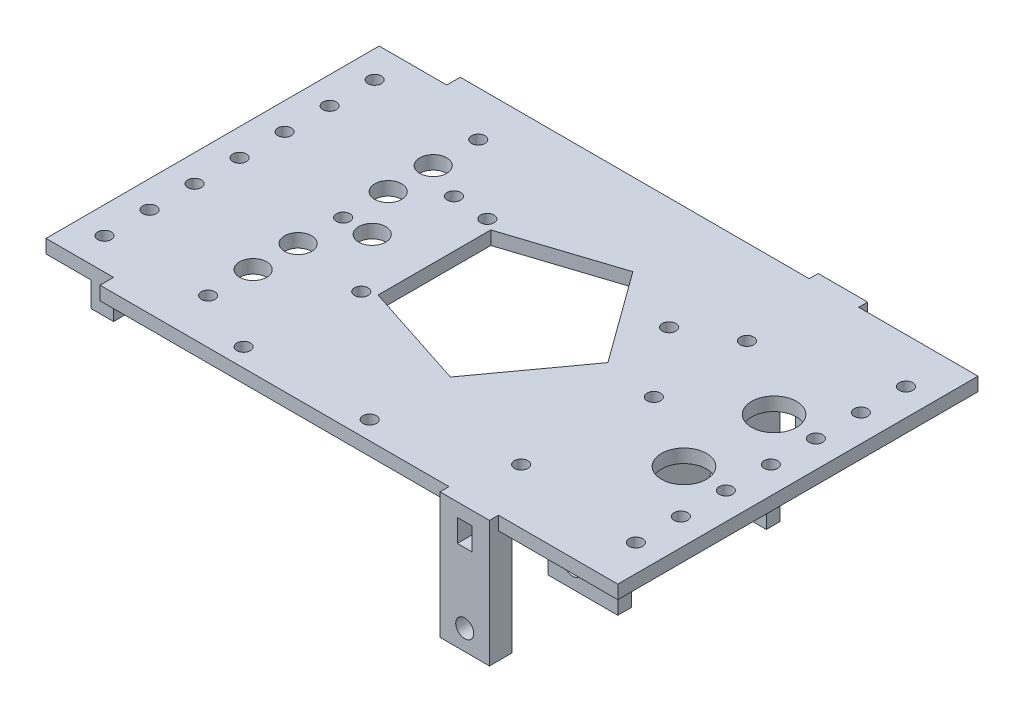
ISO-10303-21;
HEADER;
FILE_DESCRIPTION(('STEP AP214'),'2;1');
FILE_NAME('part.step','',(''),(''),'','','');
FILE_SCHEMA(('AUTOMOTIVE_DESIGN { 1 0 10303 214 1 1 1 1 }'));
ENDSEC;
DATA;
#1=APPLICATION_CONTEXT('core data for automotive mechanical design processes');
#2=APPLICATION_PROTOCOL_DEFINITION('international standard','automotive_design',2000,#1);
#3=PRODUCT_CONTEXT('',#1,'mechanical');
#4=PRODUCT('Part','Part','',(#3));
#5=PRODUCT_RELATED_PRODUCT_CATEGORY('part','',(#4));
#6=PRODUCT_DEFINITION_FORMATION('','',#4);
#7=PRODUCT_DEFINITION_CONTEXT('part definition',#1,'design');
#8=PRODUCT_DEFINITION('design','',#6,#7);
#9=PRODUCT_DEFINITION_SHAPE('','',#8);
#10=(LENGTH_UNIT() NAMED_UNIT(*) SI_UNIT(.MILLI.,.METRE.));
#11=(NAMED_UNIT(*) PLANE_ANGLE_UNIT() SI_UNIT($,.RADIAN.));
#12=(NAMED_UNIT(*) SI_UNIT($,.STERADIAN.) SOLID_ANGLE_UNIT());
#13=UNCERTAINTY_MEASURE_WITH_UNIT(LENGTH_MEASURE(1.E-05),#10,'distance_accuracy_value','');
#14=(GEOMETRIC_REPRESENTATION_CONTEXT(3) GLOBAL_UNCERTAINTY_ASSIGNED_CONTEXT((#13)) GLOBAL_UNIT_ASSIGNED_CONTEXT((#10,
#11,#12)) REPRESENTATION_CONTEXT('',''));
#15=CARTESIAN_POINT('',(0.,0.,0.));
#16=DIRECTION('',(0.,0.,1.));
#17=DIRECTION('',(1.,0.,0.));
#18=AXIS2_PLACEMENT_3D('',#15,#16,#17);
#19=CARTESIAN_POINT('',(0.,3.,-32.218992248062));
#20=DIRECTION('',(0.,0.,-1.));
#21=DIRECTION('',(-1.,0.,0.));
#22=AXIS2_PLACEMENT_3D('',#19,#20,#21);
#23=PLANE('',#22);
#24=DIRECTION('',(0.,-1.,0.));
#25=VECTOR('',#24,1.);
#26=CARTESIAN_POINT('',(35.6705426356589,-25.,-32.218992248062));
#27=LINE('',#26,#25);
#28=CARTESIAN_POINT('',(35.6705426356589,3.,-32.218992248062));
#29=VERTEX_POINT('',#28);
#30=CARTESIAN_POINT('',(35.6705426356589,0.,-32.218992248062));
#31=VERTEX_POINT('',#30);
#32=EDGE_CURVE('E88',#29,#31,#27,.T.);
#33=ORIENTED_EDGE('',*,*,#32,.F.);
#34=DIRECTION('',(1.,0.,0.));
#35=VECTOR('',#34,1.);
#36=CARTESIAN_POINT('',(0.,3.,-32.218992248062));
#37=LINE('',#36,#35);
#38=CARTESIAN_POINT('',(62.1705426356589,3.,-32.218992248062));
#39=VERTEX_POINT('',#38);
#40=EDGE_CURVE('E589',#29,#39,#37,.T.);
#41=ORIENTED_EDGE('',*,*,#40,.T.);
#42=DIRECTION('',(0.,-1.,0.));
#43=VECTOR('',#42,1.);
#44=CARTESIAN_POINT('',(62.1705426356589,3.,-32.218992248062));
#45=LINE('',#44,#43);
#46=CARTESIAN_POINT('',(62.1705426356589,0.,-32.218992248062));
#47=VERTEX_POINT('',#46);
#48=EDGE_CURVE('E645',#39,#47,#45,.T.);
#49=ORIENTED_EDGE('',*,*,#48,.T.);
#50=DIRECTION('',(1.,0.,0.));
#51=VECTOR('',#50,1.);
#52=CARTESIAN_POINT('',(0.,0.,-32.218992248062));
#53=LINE('',#52,#51);
#54=EDGE_CURVE('E880',#31,#47,#53,.T.);
#55=ORIENTED_EDGE('',*,*,#54,.F.);
#56=EDGE_LOOP('',(#33,#41,#49,#55));
#57=FACE_BOUND('',#56,.T.);
#58=ADVANCED_FACE('F71',(#57),#23,.T.);
#59=CARTESIAN_POINT('',(0.,3.,47.781007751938));
#60=DIRECTION('',(0.,0.,-1.));
#61=DIRECTION('',(-1.,0.,0.));
#62=AXIS2_PLACEMENT_3D('',#59,#60,#61);
#63=PLANE('',#62);
#64=DIRECTION('',(0.,1.,0.));
#65=VECTOR('',#64,1.);
#66=CARTESIAN_POINT('',(35.6705426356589,-25.,47.781007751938));
#67=LINE('',#66,#65);
#68=CARTESIAN_POINT('',(35.6705426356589,0.,47.781007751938));
#69=VERTEX_POINT('',#68);
#70=CARTESIAN_POINT('',(35.6705426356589,3.,47.781007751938));
#71=VERTEX_POINT('',#70);
#72=EDGE_CURVE('E542',#69,#71,#67,.T.);
#73=ORIENTED_EDGE('',*,*,#72,.F.);
#74=DIRECTION('',(1.,0.,0.));
#75=VECTOR('',#74,1.);
#76=CARTESIAN_POINT('',(0.,0.,47.781007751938));
#77=LINE('',#76,#75);
#78=CARTESIAN_POINT('',(62.1705426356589,0.,47.781007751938));
#79=VERTEX_POINT('',#78);
#80=EDGE_CURVE('E564',#69,#79,#77,.T.);
#81=ORIENTED_EDGE('',*,*,#80,.T.);
#82=DIRECTION('',(0.,-1.,0.));
#83=VECTOR('',#82,1.);
#84=CARTESIAN_POINT('',(62.1705426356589,3.,47.781007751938));
#85=LINE('',#84,#83);
#86=CARTESIAN_POINT('',(62.1705426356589,3.,47.781007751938));
#87=VERTEX_POINT('',#86);
#88=EDGE_CURVE('E649',#87,#79,#85,.T.);
#89=ORIENTED_EDGE('',*,*,#88,.F.);
#90=DIRECTION('',(1.,0.,0.));
#91=VECTOR('',#90,1.);
#92=CARTESIAN_POINT('',(0.,3.,47.781007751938));
#93=LINE('',#92,#91);
#94=EDGE_CURVE('E547',#71,#87,#93,.T.);
#95=ORIENTED_EDGE('',*,*,#94,.F.);
#96=EDGE_LOOP('',(#73,#81,#89,#95));
#97=FACE_BOUND('',#96,.T.);
#98=ADVANCED_FACE('F1220',(#97),#63,.F.);
#99=CARTESIAN_POINT('',(24.6705426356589,-25.,22.781007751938));
#100=DIRECTION('',(0.,0.,1.));
#101=DIRECTION('',(1.,0.,0.));
#102=AXIS2_PLACEMENT_3D('',#99,#100,#101);
#103=PLANE('',#102);
#104=CARTESIAN_POINT('',(30.1705426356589,-20.5,22.781007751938));
#105=DIRECTION('',(0.,0.,1.));
#106=DIRECTION('',(1.,0.,0.));
#107=AXIS2_PLACEMENT_3D('',#104,#105,#106);
#108=CIRCLE('',#107,2.);
#109=CARTESIAN_POINT('',(32.1705426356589,-20.5,22.781007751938));
#110=VERTEX_POINT('',#109);
#111=EDGE_CURVE('E1057',#110,#110,#108,.T.);
#112=ORIENTED_EDGE('',*,*,#111,.T.);
#113=EDGE_LOOP('',(#112));
#114=FACE_BOUND('',#113,.T.);
#115=DIRECTION('',(0.,1.,0.));
#116=VECTOR('',#115,1.);
#117=CARTESIAN_POINT('',(35.6705426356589,-20.,22.781007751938));
#118=LINE('',#117,#116);
#119=CARTESIAN_POINT('',(35.6705426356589,-20.,22.781007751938));
#120=VERTEX_POINT('',#119);
#121=CARTESIAN_POINT('',(35.6705426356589,0.,22.781007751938));
#122=VERTEX_POINT('',#121);
#123=EDGE_CURVE('E620',#120,#122,#118,.T.);
#124=ORIENTED_EDGE('',*,*,#123,.F.);
#125=DIRECTION('',(-1.,0.,0.));
#126=VECTOR('',#125,1.);
#127=CARTESIAN_POINT('',(40.1705426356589,-20.,22.781007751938));
#128=LINE('',#127,#126);
#129=CARTESIAN_POINT('',(40.1705426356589,-20.,22.781007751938));
#130=VERTEX_POINT('',#129);
#131=EDGE_CURVE('E1042',#130,#120,#128,.T.);
#132=ORIENTED_EDGE('',*,*,#131,.F.);
#133=DIRECTION('',(0.,1.,0.));
#134=VECTOR('',#133,1.);
#135=CARTESIAN_POINT('',(40.1705426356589,-25.,22.781007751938));
#136=LINE('',#135,#134);
#137=CARTESIAN_POINT('',(40.1705426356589,-25.,22.781007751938));
#138=VERTEX_POINT('',#137);
#139=EDGE_CURVE('E1161',#138,#130,#136,.T.);
#140=ORIENTED_EDGE('',*,*,#139,.F.);
#141=DIRECTION('',(1.,0.,0.));
#142=VECTOR('',#141,1.);
#143=CARTESIAN_POINT('',(24.6705426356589,-25.,22.781007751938));
#144=LINE('',#143,#142);
#145=CARTESIAN_POINT('',(24.6705426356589,-25.,22.781007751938));
#146=VERTEX_POINT('',#145);
#147=EDGE_CURVE('E932',#146,#138,#144,.T.);
#148=ORIENTED_EDGE('',*,*,#147,.F.);
#149=DIRECTION('',(0.,1.,0.));
#150=VECTOR('',#149,1.);
#151=CARTESIAN_POINT('',(24.6705426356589,-25.,22.781007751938));
#152=LINE('',#151,#150);
#153=CARTESIAN_POINT('',(24.6705426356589,0.,22.781007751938));
#154=VERTEX_POINT('',#153);
#155=EDGE_CURVE('E1159',#146,#154,#152,.T.);
#156=ORIENTED_EDGE('',*,*,#155,.T.);
#157=DIRECTION('',(1.,0.,0.));
#158=VECTOR('',#157,1.);
#159=CARTESIAN_POINT('',(24.6705426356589,0.,22.781007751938));
#160=LINE('',#159,#158);
#161=CARTESIAN_POINT('',(28.5205426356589,0.,22.781007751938));
#162=VERTEX_POINT('',#161);
#163=EDGE_CURVE('E914',#154,#162,#160,.T.);
#164=ORIENTED_EDGE('',*,*,#163,.T.);
#165=DIRECTION('',(0.,-1.,0.));
#166=VECTOR('',#165,1.);
#167=CARTESIAN_POINT('',(28.5205426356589,-25.,22.781007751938));
#168=LINE('',#167,#166);
#169=CARTESIAN_POINT('',(28.5205426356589,-5.,22.781007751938));
#170=VERTEX_POINT('',#169);
#171=EDGE_CURVE('E1081',#162,#170,#168,.T.);
#172=ORIENTED_EDGE('',*,*,#171,.T.);
#173=DIRECTION('',(1.,0.,0.));
#174=VECTOR('',#173,1.);
#175=CARTESIAN_POINT('',(24.6705426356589,-5.,22.781007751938));
#176=LINE('',#175,#174);
#177=CARTESIAN_POINT('',(31.8205426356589,-5.,22.781007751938));
#178=VERTEX_POINT('',#177);
#179=EDGE_CURVE('E1094',#170,#178,#176,.T.);
#180=ORIENTED_EDGE('',*,*,#179,.T.);
#181=DIRECTION('',(0.,1.,0.));
#182=VECTOR('',#181,1.);
#183=CARTESIAN_POINT('',(31.8205426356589,-25.,22.781007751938));
#184=LINE('',#183,#182);
#185=CARTESIAN_POINT('',(31.8205426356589,0.,22.781007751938));
#186=VERTEX_POINT('',#185);
#187=EDGE_CURVE('E1107',#178,#186,#184,.T.);
#188=ORIENTED_EDGE('',*,*,#187,.T.);
#189=EDGE_CURVE('E921',#186,#122,#160,.T.);
#190=ORIENTED_EDGE('',*,*,#189,.T.);
#191=EDGE_LOOP('',(#124,#132,#140,#148,#156,#164,#172,#180,#188,#190));
#192=FACE_BOUND('',#191,.T.);
#193=ADVANCED_FACE('F1179',(#114,#192),#103,.F.);
#194=CARTESIAN_POINT('',(24.6705426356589,-25.,-7.21899224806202));
#195=DIRECTION('',(0.,0.,1.));
#196=DIRECTION('',(1.,0.,0.));
#197=AXIS2_PLACEMENT_3D('',#194,#195,#196);
#198=PLANE('',#197);
#199=CARTESIAN_POINT('',(30.1705426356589,-20.5,-7.21899224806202));
#200=DIRECTION('',(0.,0.,1.));
#201=DIRECTION('',(1.,0.,0.));
#202=AXIS2_PLACEMENT_3D('',#199,#200,#201);
#203=CIRCLE('',#202,2.);
#204=CARTESIAN_POINT('',(32.1705426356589,-20.5,-7.21899224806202));
#205=VERTEX_POINT('',#204);
#206=EDGE_CURVE('E616',#205,#205,#203,.T.);
#207=ORIENTED_EDGE('',*,*,#206,.F.);
#208=EDGE_LOOP('',(#207));
#209=FACE_BOUND('',#208,.T.);
#210=DIRECTION('',(-1.,0.,0.));
#211=VECTOR('',#210,1.);
#212=CARTESIAN_POINT('',(40.1705426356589,-20.,-7.21899224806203));
#213=LINE('',#212,#211);
#214=CARTESIAN_POINT('',(40.1705426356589,-20.,-7.21899224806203));
#215=VERTEX_POINT('',#214);
#216=CARTESIAN_POINT('',(35.6705426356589,-20.,-7.21899224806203));
#217=VERTEX_POINT('',#216);
#218=EDGE_CURVE('E1036',#215,#217,#213,.T.);
#219=ORIENTED_EDGE('',*,*,#218,.T.);
#220=DIRECTION('',(0.,1.,0.));
#221=VECTOR('',#220,1.);
#222=CARTESIAN_POINT('',(35.6705426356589,-20.,-7.21899224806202));
#223=LINE('',#222,#221);
#224=CARTESIAN_POINT('',(35.6705426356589,0.,-7.21899224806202));
#225=VERTEX_POINT('',#224);
#226=EDGE_CURVE('E1044',#217,#225,#223,.T.);
#227=ORIENTED_EDGE('',*,*,#226,.T.);
#228=DIRECTION('',(1.,0.,0.));
#229=VECTOR('',#228,1.);
#230=CARTESIAN_POINT('',(24.6705426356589,0.,-7.21899224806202));
#231=LINE('',#230,#229);
#232=CARTESIAN_POINT('',(31.8205426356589,0.,-7.21899224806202));
#233=VERTEX_POINT('',#232);
#234=EDGE_CURVE('E1127',#233,#225,#231,.T.);
#235=ORIENTED_EDGE('',*,*,#234,.F.);
#236=DIRECTION('',(0.,1.,0.));
#237=VECTOR('',#236,1.);
#238=CARTESIAN_POINT('',(31.8205426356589,-25.,-7.21899224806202));
#239=LINE('',#238,#237);
#240=CARTESIAN_POINT('',(31.8205426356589,-5.,-7.21899224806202));
#241=VERTEX_POINT('',#240);
#242=EDGE_CURVE('E606',#241,#233,#239,.T.);
#243=ORIENTED_EDGE('',*,*,#242,.F.);
#244=DIRECTION('',(1.,0.,0.));
#245=VECTOR('',#244,1.);
#246=CARTESIAN_POINT('',(24.6705426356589,-5.,-7.21899224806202));
#247=LINE('',#246,#245);
#248=CARTESIAN_POINT('',(28.5205426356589,-5.,-7.21899224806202));
#249=VERTEX_POINT('',#248);
#250=EDGE_CURVE('E623',#249,#241,#247,.T.);
#251=ORIENTED_EDGE('',*,*,#250,.F.);
#252=DIRECTION('',(0.,-1.,0.));
#253=VECTOR('',#252,1.);
#254=CARTESIAN_POINT('',(28.5205426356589,-25.,-7.21899224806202));
#255=LINE('',#254,#253);
#256=CARTESIAN_POINT('',(28.5205426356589,0.,-7.21899224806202));
#257=VERTEX_POINT('',#256);
#258=EDGE_CURVE('E625',#257,#249,#255,.T.);
#259=ORIENTED_EDGE('',*,*,#258,.F.);
#260=CARTESIAN_POINT('',(24.6705426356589,0.,-7.21899224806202));
#261=VERTEX_POINT('',#260);
#262=EDGE_CURVE('E1123',#261,#257,#231,.T.);
#263=ORIENTED_EDGE('',*,*,#262,.F.);
#264=DIRECTION('',(0.,1.,0.));
#265=VECTOR('',#264,1.);
#266=CARTESIAN_POINT('',(24.6705426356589,-25.,-7.21899224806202));
#267=LINE('',#266,#265);
#268=CARTESIAN_POINT('',(24.6705426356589,-25.,-7.21899224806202));
#269=VERTEX_POINT('',#268);
#270=EDGE_CURVE('E1120',#269,#261,#267,.T.);
#271=ORIENTED_EDGE('',*,*,#270,.F.);
#272=DIRECTION('',(1.,0.,0.));
#273=VECTOR('',#272,1.);
#274=CARTESIAN_POINT('',(24.6705426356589,-25.,-7.21899224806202));
#275=LINE('',#274,#273);
#276=CARTESIAN_POINT('',(40.1705426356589,-25.,-7.21899224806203));
#277=VERTEX_POINT('',#276);
#278=EDGE_CURVE('E1122',#269,#277,#275,.T.);
#279=ORIENTED_EDGE('',*,*,#278,.T.);
#280=DIRECTION('',(0.,1.,0.));
#281=VECTOR('',#280,1.);
#282=CARTESIAN_POINT('',(40.1705426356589,-25.,-7.21899224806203));
#283=LINE('',#282,#281);
#284=EDGE_CURVE('E1117',#277,#215,#283,.T.);
#285=ORIENTED_EDGE('',*,*,#284,.T.);
#286=EDGE_LOOP('',(#219,#227,#235,#243,#251,#259,#263,#271,#279,#285));
#287=FACE_BOUND('',#286,.T.);
#288=ADVANCED_FACE('F1190',(#209,#287),#198,.T.);
#289=CARTESIAN_POINT('',(0.,0.,0.));
#290=DIRECTION('',(0.,1.,0.));
#291=DIRECTION('',(0.,0.,1.));
#292=AXIS2_PLACEMENT_3D('',#289,#290,#291);
#293=PLANE('',#292);
#294=CARTESIAN_POINT('',(-32.3809322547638,0.,7.78100775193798));
#295=DIRECTION('',(0.,1.,0.));
#296=DIRECTION('',(0.,0.,1.));
#297=AXIS2_PLACEMENT_3D('',#294,#295,#296);
#298=CIRCLE('',#297,3.);
#299=CARTESIAN_POINT('',(-32.3809322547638,0.,10.781007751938));
#300=VERTEX_POINT('',#299);
#301=EDGE_CURVE('E2206',#300,#300,#298,.T.);
#302=ORIENTED_EDGE('',*,*,#301,.T.);
#303=EDGE_LOOP('',(#302));
#304=FACE_BOUND('',#303,.T.);
#305=CARTESIAN_POINT('',(-38.8294573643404,0.,27.781007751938));
#306=DIRECTION('',(0.,1.,0.));
#307=DIRECTION('',(0.,0.,1.));
#308=AXIS2_PLACEMENT_3D('',#305,#306,#307);
#309=CIRCLE('',#308,3.);
#310=CARTESIAN_POINT('',(-38.8294573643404,0.,30.781007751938));
#311=VERTEX_POINT('',#310);
#312=EDGE_CURVE('E2210',#311,#311,#309,.T.);
#313=ORIENTED_EDGE('',*,*,#312,.T.);
#314=EDGE_LOOP('',(#313));
#315=FACE_BOUND('',#314,.T.);
#316=CARTESIAN_POINT('',(-38.8294573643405,0.,17.781007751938));
#317=DIRECTION('',(0.,1.,0.));
#318=DIRECTION('',(0.,0.,1.));
#319=AXIS2_PLACEMENT_3D('',#316,#317,#318);
#320=CIRCLE('',#319,3.);
#321=CARTESIAN_POINT('',(-38.8294573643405,0.,20.781007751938));
#322=VERTEX_POINT('',#321);
#323=EDGE_CURVE('E2219',#322,#322,#320,.T.);
#324=ORIENTED_EDGE('',*,*,#323,.T.);
#325=EDGE_LOOP('',(#324));
#326=FACE_BOUND('',#325,.T.);
#327=CARTESIAN_POINT('',(-38.8294573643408,0.,-2.21899224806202));
#328=DIRECTION('',(0.,1.,0.));
#329=DIRECTION('',(0.,0.,1.));
#330=AXIS2_PLACEMENT_3D('',#327,#328,#329);
#331=CIRCLE('',#330,3.);
#332=CARTESIAN_POINT('',(-38.8294573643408,0.,0.78100775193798));
#333=VERTEX_POINT('',#332);
#334=EDGE_CURVE('E2225',#333,#333,#331,.T.);
#335=ORIENTED_EDGE('',*,*,#334,.T.);
#336=EDGE_LOOP('',(#335));
#337=FACE_BOUND('',#336,.T.);
#338=CARTESIAN_POINT('',(-38.829457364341,0.,-12.218992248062));
#339=DIRECTION('',(0.,1.,0.));
#340=DIRECTION('',(0.,0.,1.));
#341=AXIS2_PLACEMENT_3D('',#338,#339,#340);
#342=CIRCLE('',#341,3.);
#343=CARTESIAN_POINT('',(-38.829457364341,0.,-9.21899224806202));
#344=VERTEX_POINT('',#343);
#345=EDGE_CURVE('E2231',#344,#344,#342,.T.);
#346=ORIENTED_EDGE('',*,*,#345,.T.);
#347=EDGE_LOOP('',(#346));
#348=FACE_BOUND('',#347,.T.);
#349=CARTESIAN_POINT('',(28.4327274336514,0.,35.5226656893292));
#350=DIRECTION('',(0.,1.,0.));
#351=DIRECTION('',(0.,0.,1.));
#352=AXIS2_PLACEMENT_3D('',#349,#350,#351);
#353=CIRCLE('',#352,1.49999999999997);
#354=CARTESIAN_POINT('',(28.4327274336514,0.,37.0226656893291));
#355=VERTEX_POINT('',#354);
#356=EDGE_CURVE('E2237',#355,#355,#353,.T.);
#357=ORIENTED_EDGE('',*,*,#356,.T.);
#358=EDGE_LOOP('',(#357));
#359=FACE_BOUND('',#358,.T.);
#360=CARTESIAN_POINT('',(29.7327274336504,0.,-13.3373343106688));
#361=DIRECTION('',(0.,1.,0.));
#362=DIRECTION('',(0.,0.,1.));
#363=AXIS2_PLACEMENT_3D('',#360,#361,#362);
#364=CIRCLE('',#363,1.50000000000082);
#365=CARTESIAN_POINT('',(29.7327274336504,0.,-11.837334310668));
#366=VERTEX_POINT('',#365);
#367=EDGE_CURVE('E2243',#366,#366,#364,.T.);
#368=ORIENTED_EDGE('',*,*,#367,.T.);
#369=EDGE_LOOP('',(#368));
#370=FACE_BOUND('',#369,.T.);
#371=CARTESIAN_POINT('',(-22.5672725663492,0.,20.0226656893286));
#372=DIRECTION('',(0.,1.,0.));
#373=DIRECTION('',(0.,0.,1.));
#374=AXIS2_PLACEMENT_3D('',#371,#372,#373);
#375=CIRCLE('',#374,1.49999999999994);
#376=CARTESIAN_POINT('',(-22.5672725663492,0.,21.5226656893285));
#377=VERTEX_POINT('',#376);
#378=EDGE_CURVE('E2249',#377,#377,#375,.T.);
#379=ORIENTED_EDGE('',*,*,#378,.T.);
#380=EDGE_LOOP('',(#379));
#381=FACE_BOUND('',#380,.T.);
#382=CARTESIAN_POINT('',(-22.5672725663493,0.,-7.97733431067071));
#383=DIRECTION('',(0.,1.,0.));
#384=DIRECTION('',(0.,0.,1.));
#385=AXIS2_PLACEMENT_3D('',#382,#383,#384);
#386=CIRCLE('',#385,1.49999999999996);
#387=CARTESIAN_POINT('',(-22.5672725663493,0.,-6.47733431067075));
#388=VERTEX_POINT('',#387);
#389=EDGE_CURVE('E2255',#388,#388,#386,.T.);
#390=ORIENTED_EDGE('',*,*,#389,.T.);
#391=EDGE_LOOP('',(#390));
#392=FACE_BOUND('',#391,.T.);
#393=DIRECTION('',(0.,0.,-1.));
#394=VECTOR('',#393,1.);
#395=CARTESIAN_POINT('',(40.1705426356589,0.,25.781007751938));
#396=LINE('',#395,#394);
#397=CARTESIAN_POINT('',(40.1705426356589,0.,25.781007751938));
#398=VERTEX_POINT('',#397);
#399=CARTESIAN_POINT('',(40.1705426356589,0.,-10.218992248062));
#400=VERTEX_POINT('',#399);
#401=EDGE_CURVE('E1170',#398,#400,#396,.T.);
#402=ORIENTED_EDGE('',*,*,#401,.T.);
#403=DIRECTION('',(1.,0.,0.));
#404=VECTOR('',#403,1.);
#405=CARTESIAN_POINT('',(24.6705426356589,0.,-10.218992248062));
#406=LINE('',#405,#404);
#407=CARTESIAN_POINT('',(31.8205426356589,0.,-10.218992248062));
#408=VERTEX_POINT('',#407);
#409=EDGE_CURVE('E1126',#408,#400,#406,.T.);
#410=ORIENTED_EDGE('',*,*,#409,.F.);
#411=DIRECTION('',(0.,0.,1.));
#412=VECTOR('',#411,1.);
#413=CARTESIAN_POINT('',(31.8205426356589,0.,-32.218992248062));
#414=LINE('',#413,#412);
#415=EDGE_CURVE('E1073',#408,#233,#414,.T.);
#416=ORIENTED_EDGE('',*,*,#415,.T.);
#417=ORIENTED_EDGE('',*,*,#234,.T.);
#418=DIRECTION('',(0.,0.,-1.));
#419=VECTOR('',#418,1.);
#420=CARTESIAN_POINT('',(35.6705426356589,0.,22.781007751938));
#421=LINE('',#420,#419);
#422=EDGE_CURVE('E615',#122,#225,#421,.T.);
#423=ORIENTED_EDGE('',*,*,#422,.F.);
#424=ORIENTED_EDGE('',*,*,#189,.F.);
#425=CARTESIAN_POINT('',(31.8205426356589,0.,25.781007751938));
#426=VERTEX_POINT('',#425);
#427=EDGE_CURVE('E1183',#186,#426,#414,.T.);
#428=ORIENTED_EDGE('',*,*,#427,.T.);
#429=DIRECTION('',(1.,0.,0.));
#430=VECTOR('',#429,1.);
#431=CARTESIAN_POINT('',(24.6705426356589,0.,25.781007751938));
#432=LINE('',#431,#430);
#433=EDGE_CURVE('E937',#426,#398,#432,.T.);
#434=ORIENTED_EDGE('',*,*,#433,.T.);
#435=EDGE_LOOP('',(#402,#410,#416,#417,#423,#424,#428,#434));
#436=FACE_BOUND('',#435,.T.);
#437=DIRECTION('',(0.,0.,1.));
#438=VECTOR('',#437,1.);
#439=CARTESIAN_POINT('',(28.5205426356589,0.,-32.218992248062));
#440=LINE('',#439,#438);
#441=CARTESIAN_POINT('',(28.5205426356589,0.,-10.218992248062));
#442=VERTEX_POINT('',#441);
#443=EDGE_CURVE('E1070',#442,#257,#440,.T.);
#444=ORIENTED_EDGE('',*,*,#443,.F.);
#445=CARTESIAN_POINT('',(24.6705426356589,0.,-10.218992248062));
#446=VERTEX_POINT('',#445);
#447=EDGE_CURVE('E1128',#446,#442,#406,.T.);
#448=ORIENTED_EDGE('',*,*,#447,.F.);
#449=DIRECTION('',(0.,0.,-1.));
#450=VECTOR('',#449,1.);
#451=CARTESIAN_POINT('',(24.6705426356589,0.,-7.21899224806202));
#452=LINE('',#451,#450);
#453=EDGE_CURVE('E1131',#261,#446,#452,.T.);
#454=ORIENTED_EDGE('',*,*,#453,.F.);
#455=ORIENTED_EDGE('',*,*,#262,.T.);
#456=EDGE_LOOP('',(#444,#448,#454,#455));
#457=FACE_BOUND('',#456,.T.);
#458=CARTESIAN_POINT('',(28.5205426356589,0.,25.781007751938));
#459=VERTEX_POINT('',#458);
#460=EDGE_CURVE('E1380',#162,#459,#440,.T.);
#461=ORIENTED_EDGE('',*,*,#460,.F.);
#462=ORIENTED_EDGE('',*,*,#163,.F.);
#463=DIRECTION('',(0.,0.,-1.));
#464=VECTOR('',#463,1.);
#465=CARTESIAN_POINT('',(24.6705426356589,0.,25.781007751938));
#466=LINE('',#465,#464);
#467=CARTESIAN_POINT('',(24.6705426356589,0.,25.781007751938));
#468=VERTEX_POINT('',#467);
#469=EDGE_CURVE('E907',#468,#154,#466,.T.);
#470=ORIENTED_EDGE('',*,*,#469,.F.);
#471=EDGE_CURVE('E1168',#468,#459,#432,.T.);
#472=ORIENTED_EDGE('',*,*,#471,.T.);
#473=EDGE_LOOP('',(#461,#462,#470,#472));
#474=FACE_BOUND('',#473,.T.);
#475=DIRECTION('',(0.587785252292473,0.,-0.809016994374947));
#476=VECTOR('',#475,1.);
#477=CARTESIAN_POINT('',(15.0759237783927,0.,10.9532997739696));
#478=LINE('',#477,#476);
#479=CARTESIAN_POINT('',(3.75260461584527,0.,26.5385115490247));
#480=VERTEX_POINT('',#479);
#481=CARTESIAN_POINT('',(18.4705426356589,0.,6.28100775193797));
#482=VERTEX_POINT('',#481);
#483=EDGE_CURVE('E575',#480,#482,#478,.T.);
#484=ORIENTED_EDGE('',*,*,#483,.T.);
#485=DIRECTION('',(-0.587785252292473,0.,-0.809016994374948));
#486=VECTOR('',#485,1.);
#487=CARTESIAN_POINT('',(9.10233042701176,0.,-6.61323015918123));
#488=LINE('',#487,#486);
#489=CARTESIAN_POINT('',(3.75260461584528,0.,-13.9764960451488));
#490=VERTEX_POINT('',#489);
#491=EDGE_CURVE('E749',#482,#490,#488,.T.);
#492=ORIENTED_EDGE('',*,*,#491,.T.);
#493=DIRECTION('',(-0.951056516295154,0.,0.309016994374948));
#494=VECTOR('',#493,1.);
#495=CARTESIAN_POINT('',(-3.74924727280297,0.,-11.5389966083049));
#496=LINE('',#495,#494);
#497=CARTESIAN_POINT('',(-20.0615193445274,0.,-6.23881812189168));
#498=VERTEX_POINT('',#497);
#499=EDGE_CURVE('E752',#490,#498,#496,.T.);
#500=ORIENTED_EDGE('',*,*,#499,.T.);
#501=DIRECTION('',(0.,0.,1.));
#502=VECTOR('',#501,1.);
#503=CARTESIAN_POINT('',(-20.0615193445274,0.,0.));
#504=LINE('',#503,#502);
#505=CARTESIAN_POINT('',(-20.0615193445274,0.,18.8008336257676));
#506=VERTEX_POINT('',#505);
#507=EDGE_CURVE('E755',#498,#506,#504,.T.);
#508=ORIENTED_EDGE('',*,*,#507,.T.);
#509=DIRECTION('',(0.951056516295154,0.,0.309016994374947));
#510=VECTOR('',#509,1.);
#511=CARTESIAN_POINT('',(-7.44113099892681,0.,22.9014463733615));
#512=LINE('',#511,#510);
#513=EDGE_CURVE('E757',#506,#480,#512,.T.);
#514=ORIENTED_EDGE('',*,*,#513,.T.);
#515=EDGE_LOOP('',(#484,#492,#500,#508,#514));
#516=FACE_BOUND('',#515,.T.);
#517=CARTESIAN_POINT('',(-25.0294573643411,0.,43.6864375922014));
#518=DIRECTION('',(0.,1.,0.));
#519=DIRECTION('',(0.,0.,1.));
#520=AXIS2_PLACEMENT_3D('',#517,#518,#519);
#521=CIRCLE('',#520,1.49999999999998);
#522=CARTESIAN_POINT('',(-25.0294573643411,0.,45.1864375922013));
#523=VERTEX_POINT('',#522);
#524=EDGE_CURVE('E746',#523,#523,#521,.T.);
#525=ORIENTED_EDGE('',*,*,#524,.T.);
#526=EDGE_LOOP('',(#525));
#527=FACE_BOUND('',#526,.T.);
#528=CARTESIAN_POINT('',(2.97054263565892,0.,43.6864375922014));
#529=DIRECTION('',(0.,1.,0.));
#530=DIRECTION('',(0.,0.,1.));
#531=AXIS2_PLACEMENT_3D('',#528,#529,#530);
#532=CIRCLE('',#531,1.49999999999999);
#533=CARTESIAN_POINT('',(2.97054263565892,0.,45.1864375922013));
#534=VERTEX_POINT('',#533);
#535=EDGE_CURVE('E743',#534,#534,#532,.T.);
#536=ORIENTED_EDGE('',*,*,#535,.T.);
#537=EDGE_LOOP('',(#536));
#538=FACE_BOUND('',#537,.T.);
#539=CARTESIAN_POINT('',(-30.6185084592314,0.,-8.61406397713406));
#540=DIRECTION('',(0.,1.,0.));
#541=DIRECTION('',(0.,0.,1.));
#542=AXIS2_PLACEMENT_3D('',#539,#540,#541);
#543=CIRCLE('',#542,1.49999999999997);
#544=CARTESIAN_POINT('',(-30.6185084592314,0.,-7.11406397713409));
#545=VERTEX_POINT('',#544);
#546=EDGE_CURVE('E740',#545,#545,#543,.T.);
#547=ORIENTED_EDGE('',*,*,#546,.T.);
#548=EDGE_LOOP('',(#547));
#549=FACE_BOUND('',#548,.T.);
#550=CARTESIAN_POINT('',(18.4705426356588,0.,-7.31356240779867));
#551=DIRECTION('',(0.,1.,0.));
#552=DIRECTION('',(0.,0.,1.));
#553=AXIS2_PLACEMENT_3D('',#550,#551,#552);
#554=CIRCLE('',#553,1.49999999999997);
#555=CARTESIAN_POINT('',(18.4705426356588,0.,-5.81356240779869));
#556=VERTEX_POINT('',#555);
#557=EDGE_CURVE('E737',#556,#556,#554,.T.);
#558=ORIENTED_EDGE('',*,*,#557,.T.);
#559=EDGE_LOOP('',(#558));
#560=FACE_BOUND('',#559,.T.);
#561=CARTESIAN_POINT('',(-38.8294573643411,0.,-22.218992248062));
#562=DIRECTION('',(0.,1.,0.));
#563=DIRECTION('',(0.,0.,1.));
#564=AXIS2_PLACEMENT_3D('',#561,#562,#563);
#565=CIRCLE('',#564,1.5);
#566=CARTESIAN_POINT('',(-38.8294573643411,0.,-20.718992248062));
#567=VERTEX_POINT('',#566);
#568=EDGE_CURVE('E683',#567,#567,#565,.T.);
#569=ORIENTED_EDGE('',*,*,#568,.T.);
#570=EDGE_LOOP('',(#569));
#571=FACE_BOUND('',#570,.T.);
#572=CARTESIAN_POINT('',(-38.8294573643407,0.,7.78100775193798));
#573=DIRECTION('',(0.,1.,0.));
#574=DIRECTION('',(0.,0.,1.));
#575=AXIS2_PLACEMENT_3D('',#572,#573,#574);
#576=CIRCLE('',#575,1.5);
#577=CARTESIAN_POINT('',(-38.8294573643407,0.,9.28100775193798));
#578=VERTEX_POINT('',#577);
#579=EDGE_CURVE('E680',#578,#578,#576,.T.);
#580=ORIENTED_EDGE('',*,*,#579,.T.);
#581=EDGE_LOOP('',(#580));
#582=FACE_BOUND('',#581,.T.);
#583=CARTESIAN_POINT('',(-38.8294573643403,0.,37.781007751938));
#584=DIRECTION('',(0.,1.,0.));
#585=DIRECTION('',(0.,0.,1.));
#586=AXIS2_PLACEMENT_3D('',#583,#584,#585);
#587=CIRCLE('',#586,1.5);
#588=CARTESIAN_POINT('',(-38.8294573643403,0.,39.281007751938));
#589=VERTEX_POINT('',#588);
#590=EDGE_CURVE('E677',#589,#589,#587,.T.);
#591=ORIENTED_EDGE('',*,*,#590,.T.);
#592=EDGE_LOOP('',(#591));
#593=FACE_BOUND('',#592,.T.);
#594=DIRECTION('',(1.,0.,0.));
#595=VECTOR('',#594,1.);
#596=CARTESIAN_POINT('',(0.,0.,43.6864375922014));
#597=LINE('',#596,#595);
#598=CARTESIAN_POINT('',(-30.6294573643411,0.,43.6864375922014));
#599=VERTEX_POINT('',#598);
#600=CARTESIAN_POINT('',(-30.6185084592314,0.,43.6864375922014));
#601=VERTEX_POINT('',#600);
#602=EDGE_CURVE('E674',#599,#601,#597,.T.);
#603=ORIENTED_EDGE('',*,*,#602,.F.);
#604=DIRECTION('',(0.66247121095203,0.,0.749087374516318));
#605=VECTOR('',#604,1.);
#606=CARTESIAN_POINT('',(-38.8665085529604,0.,34.372416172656));
#607=LINE('',#606,#605);
#608=CARTESIAN_POINT('',(-30.6185084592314,0.,43.698818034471));
#609=VERTEX_POINT('',#608);
#610=EDGE_CURVE('E668',#599,#609,#607,.T.);
#611=ORIENTED_EDGE('',*,*,#610,.T.);
#612=DIRECTION('',(0.,0.,1.));
#613=VECTOR('',#612,1.);
#614=CARTESIAN_POINT('',(-30.6185084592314,0.,0.));
#615=LINE('',#614,#613);
#616=EDGE_CURVE('E671',#601,#609,#615,.T.);
#617=ORIENTED_EDGE('',*,*,#616,.F.);
#618=EDGE_LOOP('',(#603,#611,#617));
#619=FACE_BOUND('',#618,.T.);
#620=DIRECTION('',(1.,0.,0.));
#621=VECTOR('',#620,1.);
#622=CARTESIAN_POINT('',(24.6705426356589,0.,-29.218992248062));
#623=LINE('',#622,#621);
#624=CARTESIAN_POINT('',(24.6705426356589,0.,-29.218992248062));
#625=VERTEX_POINT('',#624);
#626=CARTESIAN_POINT('',(28.5205426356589,0.,-29.218992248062));
#627=VERTEX_POINT('',#626);
#628=EDGE_CURVE('E941',#625,#627,#623,.T.);
#629=ORIENTED_EDGE('',*,*,#628,.T.);
#630=CARTESIAN_POINT('',(28.5205426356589,0.,-34.218992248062));
#631=VERTEX_POINT('',#630);
#632=EDGE_CURVE('E1068',#631,#627,#440,.T.);
#633=ORIENTED_EDGE('',*,*,#632,.F.);
#634=DIRECTION('',(1.,0.,0.));
#635=VECTOR('',#634,1.);
#636=CARTESIAN_POINT('',(31.8205426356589,0.,-34.218992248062));
#637=LINE('',#636,#635);
#638=CARTESIAN_POINT('',(31.8205426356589,0.,-34.218992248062));
#639=VERTEX_POINT('',#638);
#640=EDGE_CURVE('E488',#631,#639,#637,.T.);
#641=ORIENTED_EDGE('',*,*,#640,.T.);
#642=CARTESIAN_POINT('',(31.8205426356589,0.,-29.218992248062));
#643=VERTEX_POINT('',#642);
#644=EDGE_CURVE('E477',#639,#643,#414,.T.);
#645=ORIENTED_EDGE('',*,*,#644,.T.);
#646=CARTESIAN_POINT('',(35.6705426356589,0.,-29.218992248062));
#647=VERTEX_POINT('',#646);
#648=EDGE_CURVE('E912',#643,#647,#623,.T.);
#649=ORIENTED_EDGE('',*,*,#648,.T.);
#650=DIRECTION('',(0.,0.,-1.));
#651=VECTOR('',#650,1.);
#652=CARTESIAN_POINT('',(35.6705426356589,0.,-29.218992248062));
#653=LINE('',#652,#651);
#654=EDGE_CURVE('E906',#647,#31,#653,.T.);
#655=ORIENTED_EDGE('',*,*,#654,.T.);
#656=ORIENTED_EDGE('',*,*,#54,.T.);
#657=DIRECTION('',(0.,0.,1.));
#658=VECTOR('',#657,1.);
#659=CARTESIAN_POINT('',(62.1705426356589,0.,0.));
#660=LINE('',#659,#658);
#661=EDGE_CURVE('E878',#47,#79,#660,.T.);
#662=ORIENTED_EDGE('',*,*,#661,.T.);
#663=ORIENTED_EDGE('',*,*,#80,.F.);
#664=DIRECTION('',(0.,0.,-1.));
#665=VECTOR('',#664,1.);
#666=CARTESIAN_POINT('',(35.6705426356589,0.,47.781007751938));
#667=LINE('',#666,#665);
#668=CARTESIAN_POINT('',(35.6705426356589,0.,44.781007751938));
#669=VERTEX_POINT('',#668);
#670=EDGE_CURVE('E557',#69,#669,#667,.T.);
#671=ORIENTED_EDGE('',*,*,#670,.T.);
#672=DIRECTION('',(1.,0.,0.));
#673=VECTOR('',#672,1.);
#674=CARTESIAN_POINT('',(24.6705426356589,0.,44.781007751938));
#675=LINE('',#674,#673);
#676=CARTESIAN_POINT('',(31.8205426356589,0.,44.781007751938));
#677=VERTEX_POINT('',#676);
#678=EDGE_CURVE('E560',#677,#669,#675,.T.);
#679=ORIENTED_EDGE('',*,*,#678,.F.);
#680=CARTESIAN_POINT('',(31.8205426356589,0.,49.781007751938));
#681=VERTEX_POINT('',#680);
#682=EDGE_CURVE('E1062',#677,#681,#414,.T.);
#683=ORIENTED_EDGE('',*,*,#682,.T.);
#684=DIRECTION('',(1.,0.,0.));
#685=VECTOR('',#684,1.);
#686=CARTESIAN_POINT('',(28.5205426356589,0.,49.781007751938));
#687=LINE('',#686,#685);
#688=CARTESIAN_POINT('',(28.5205426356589,0.,49.781007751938));
#689=VERTEX_POINT('',#688);
#690=EDGE_CURVE('E519',#689,#681,#687,.T.);
#691=ORIENTED_EDGE('',*,*,#690,.F.);
#692=CARTESIAN_POINT('',(28.5205426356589,0.,44.781007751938));
#693=VERTEX_POINT('',#692);
#694=EDGE_CURVE('E1071',#693,#689,#440,.T.);
#695=ORIENTED_EDGE('',*,*,#694,.F.);
#696=CARTESIAN_POINT('',(24.6705426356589,0.,44.781007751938));
#697=VERTEX_POINT('',#696);
#698=EDGE_CURVE('E1150',#697,#693,#675,.T.);
#699=ORIENTED_EDGE('',*,*,#698,.F.);
#700=DIRECTION('',(0.,0.,-1.));
#701=VECTOR('',#700,1.);
#702=CARTESIAN_POINT('',(24.6705426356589,0.,47.781007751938));
#703=LINE('',#702,#701);
#704=CARTESIAN_POINT('',(24.6705426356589,0.,47.781007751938));
#705=VERTEX_POINT('',#704);
#706=EDGE_CURVE('E569',#705,#697,#703,.T.);
#707=ORIENTED_EDGE('',*,*,#706,.F.);
#708=CARTESIAN_POINT('',(-52.8294573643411,0.,47.781007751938));
#709=VERTEX_POINT('',#708);
#710=EDGE_CURVE('E567',#709,#705,#77,.T.);
#711=ORIENTED_EDGE('',*,*,#710,.F.);
#712=DIRECTION('',(0.,0.,-1.));
#713=VECTOR('',#712,1.);
#714=CARTESIAN_POINT('',(-52.8294573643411,0.,47.781007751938));
#715=LINE('',#714,#713);
#716=CARTESIAN_POINT('',(-52.8294573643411,0.,44.781007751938));
#717=VERTEX_POINT('',#716);
#718=EDGE_CURVE('E985',#709,#717,#715,.T.);
#719=ORIENTED_EDGE('',*,*,#718,.T.);
#720=CARTESIAN_POINT('',(-52.8294573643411,0.,-29.218992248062));
#721=VERTEX_POINT('',#720);
#722=EDGE_CURVE('E980',#717,#721,#715,.T.);
#723=ORIENTED_EDGE('',*,*,#722,.T.);
#724=DIRECTION('',(0.,0.,-1.));
#725=VECTOR('',#724,1.);
#726=CARTESIAN_POINT('',(-52.8294573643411,0.,0.));
#727=LINE('',#726,#725);
#728=CARTESIAN_POINT('',(-52.8294573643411,0.,-32.218992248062));
#729=VERTEX_POINT('',#728);
#730=EDGE_CURVE('E1005',#721,#729,#727,.T.);
#731=ORIENTED_EDGE('',*,*,#730,.T.);
#732=CARTESIAN_POINT('',(24.6705426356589,0.,-32.218992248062));
#733=VERTEX_POINT('',#732);
#734=EDGE_CURVE('E885',#729,#733,#53,.T.);
#735=ORIENTED_EDGE('',*,*,#734,.T.);
#736=DIRECTION('',(0.,0.,-1.));
#737=VECTOR('',#736,1.);
#738=CARTESIAN_POINT('',(24.6705426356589,0.,-29.218992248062));
#739=LINE('',#738,#737);
#740=EDGE_CURVE('E904',#625,#733,#739,.T.);
#741=ORIENTED_EDGE('',*,*,#740,.F.);
#742=EDGE_LOOP('',(#629,#633,#641,#645,#649,#655,#656,#662,#663,#671,#679,#683,#691,#695,#699,
#707,#711,#719,#723,#731,#735,#741));
#743=FACE_BOUND('',#742,.T.);
#744=CARTESIAN_POINT('',(30.1705426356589,0.,7.78100775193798));
#745=DIRECTION('',(0.,1.,0.));
#746=DIRECTION('',(0.,0.,1.));
#747=AXIS2_PLACEMENT_3D('',#744,#745,#746);
#748=CIRCLE('',#747,1.5);
#749=CARTESIAN_POINT('',(30.1705426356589,0.,9.28100775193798));
#750=VERTEX_POINT('',#749);
#751=EDGE_CURVE('E734',#750,#750,#748,.T.);
#752=ORIENTED_EDGE('',*,*,#751,.T.);
#753=EDGE_LOOP('',(#752));
#754=FACE_BOUND('',#753,.T.);
#755=CARTESIAN_POINT('',(46.8718612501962,0.,17.781007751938));
#756=DIRECTION('',(0.,1.,0.));
#757=DIRECTION('',(0.,0.,1.));
#758=AXIS2_PLACEMENT_3D('',#755,#756,#757);
#759=CIRCLE('',#758,5.);
#760=CARTESIAN_POINT('',(46.8718612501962,0.,22.781007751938));
#761=VERTEX_POINT('',#760);
#762=EDGE_CURVE('E686',#761,#761,#759,.T.);
#763=ORIENTED_EDGE('',*,*,#762,.T.);
#764=EDGE_LOOP('',(#763));
#765=FACE_BOUND('',#764,.T.);
#766=CARTESIAN_POINT('',(46.8718612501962,0.,-2.21899224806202));
#767=DIRECTION('',(0.,1.,0.));
#768=DIRECTION('',(0.,0.,1.));
#769=AXIS2_PLACEMENT_3D('',#766,#767,#768);
#770=CIRCLE('',#769,5.);
#771=CARTESIAN_POINT('',(46.8718612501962,0.,2.78100775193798));
#772=VERTEX_POINT('',#771);
#773=EDGE_CURVE('E689',#772,#772,#770,.T.);
#774=ORIENTED_EDGE('',*,*,#773,.T.);
#775=EDGE_LOOP('',(#774));
#776=FACE_BOUND('',#775,.T.);
#777=CARTESIAN_POINT('',(56.1705426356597,0.,37.781007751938));
#778=DIRECTION('',(0.,1.,0.));
#779=DIRECTION('',(0.,0.,1.));
#780=AXIS2_PLACEMENT_3D('',#777,#778,#779);
#781=CIRCLE('',#780,1.5);
#782=CARTESIAN_POINT('',(56.1705426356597,0.,39.281007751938));
#783=VERTEX_POINT('',#782);
#784=EDGE_CURVE('E692',#783,#783,#781,.T.);
#785=ORIENTED_EDGE('',*,*,#784,.T.);
#786=EDGE_LOOP('',(#785));
#787=FACE_BOUND('',#786,.T.);
#788=CARTESIAN_POINT('',(56.1705426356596,0.,27.781007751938));
#789=DIRECTION('',(0.,1.,0.));
#790=DIRECTION('',(0.,0.,1.));
#791=AXIS2_PLACEMENT_3D('',#788,#789,#790);
#792=CIRCLE('',#791,1.5);
#793=CARTESIAN_POINT('',(56.1705426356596,0.,29.281007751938));
#794=VERTEX_POINT('',#793);
#795=EDGE_CURVE('E695',#794,#794,#792,.T.);
#796=ORIENTED_EDGE('',*,*,#795,.T.);
#797=EDGE_LOOP('',(#796));
#798=FACE_BOUND('',#797,.T.);
#799=CARTESIAN_POINT('',(56.1705426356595,0.,17.781007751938));
#800=DIRECTION('',(0.,1.,0.));
#801=DIRECTION('',(0.,0.,1.));
#802=AXIS2_PLACEMENT_3D('',#799,#800,#801);
#803=CIRCLE('',#802,1.5);
#804=CARTESIAN_POINT('',(56.1705426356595,0.,19.281007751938));
#805=VERTEX_POINT('',#804);
#806=EDGE_CURVE('E698',#805,#805,#803,.T.);
#807=ORIENTED_EDGE('',*,*,#806,.T.);
#808=EDGE_LOOP('',(#807));
#809=FACE_BOUND('',#808,.T.);
#810=CARTESIAN_POINT('',(56.1705426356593,0.,7.78100775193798));
#811=DIRECTION('',(0.,1.,0.));
#812=DIRECTION('',(0.,0.,1.));
#813=AXIS2_PLACEMENT_3D('',#810,#811,#812);
#814=CIRCLE('',#813,1.5);
#815=CARTESIAN_POINT('',(56.1705426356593,0.,9.28100775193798));
#816=VERTEX_POINT('',#815);
#817=EDGE_CURVE('E701',#816,#816,#814,.T.);
#818=ORIENTED_EDGE('',*,*,#817,.T.);
#819=EDGE_LOOP('',(#818));
#820=FACE_BOUND('',#819,.T.);
#821=CARTESIAN_POINT('',(56.1705426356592,0.,-2.21899224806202));
#822=DIRECTION('',(0.,1.,0.));
#823=DIRECTION('',(0.,0.,1.));
#824=AXIS2_PLACEMENT_3D('',#821,#822,#823);
#825=CIRCLE('',#824,1.5);
#826=CARTESIAN_POINT('',(56.1705426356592,0.,-0.718992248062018));
#827=VERTEX_POINT('',#826);
#828=EDGE_CURVE('E704',#827,#827,#825,.T.);
#829=ORIENTED_EDGE('',*,*,#828,.T.);
#830=EDGE_LOOP('',(#829));
#831=FACE_BOUND('',#830,.T.);
#832=CARTESIAN_POINT('',(56.1705426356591,0.,-12.218992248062));
#833=DIRECTION('',(0.,1.,0.));
#834=DIRECTION('',(0.,0.,1.));
#835=AXIS2_PLACEMENT_3D('',#832,#833,#834);
#836=CIRCLE('',#835,1.5);
#837=CARTESIAN_POINT('',(56.1705426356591,0.,-10.718992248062));
#838=VERTEX_POINT('',#837);
#839=EDGE_CURVE('E707',#838,#838,#836,.T.);
#840=ORIENTED_EDGE('',*,*,#839,.T.);
#841=EDGE_LOOP('',(#840));
#842=FACE_BOUND('',#841,.T.);
#843=CARTESIAN_POINT('',(56.1705426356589,0.,-22.218992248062));
#844=DIRECTION('',(0.,1.,0.));
#845=DIRECTION('',(0.,0.,1.));
#846=AXIS2_PLACEMENT_3D('',#843,#844,#845);
#847=CIRCLE('',#846,1.5);
#848=CARTESIAN_POINT('',(56.1705426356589,0.,-20.718992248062));
#849=VERTEX_POINT('',#848);
#850=EDGE_CURVE('E710',#849,#849,#847,.T.);
#851=ORIENTED_EDGE('',*,*,#850,.T.);
#852=EDGE_LOOP('',(#851));
#853=FACE_BOUND('',#852,.T.);
#854=ADVANCED_FACE('F764',(#304,#315,#326,#337,#348,#359,#370,#381,#392,#436,#457,#474,#516,
#527,#538,#549,#560,#571,#582,#593,#619,#743,#754,#765,#776,#787,#798,#809,#820,#831,#842,#853),
#293,.F.);
#855=CARTESIAN_POINT('',(-57.8294573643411,-11.,47.781007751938));
#856=DIRECTION('',(1.,0.,0.));
#857=DIRECTION('',(0.,0.,-1.));
#858=AXIS2_PLACEMENT_3D('',#855,#856,#857);
#859=PLANE('',#858);
#860=CARTESIAN_POINT('',(-57.8294573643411,-5.50000000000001,-2.21899224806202));
#861=DIRECTION('',(-1.,0.,0.));
#862=DIRECTION('',(0.,0.,1.));
#863=AXIS2_PLACEMENT_3D('',#860,#861,#862);
#864=CIRCLE('',#863,2.75);
#865=CARTESIAN_POINT('',(-57.8294573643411,-5.50000000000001,0.531007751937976));
#866=VERTEX_POINT('',#865);
#867=EDGE_CURVE('E633',#866,#866,#864,.T.);
#868=ORIENTED_EDGE('',*,*,#867,.F.);
#869=EDGE_LOOP('',(#868));
#870=FACE_BOUND('',#869,.T.);
#871=CARTESIAN_POINT('',(-57.8294573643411,-5.50000000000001,17.781007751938));
#872=DIRECTION('',(-1.,0.,0.));
#873=DIRECTION('',(0.,0.,1.));
#874=AXIS2_PLACEMENT_3D('',#871,#872,#873);
#875=CIRCLE('',#874,2.75);
#876=CARTESIAN_POINT('',(-57.8294573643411,-5.50000000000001,20.531007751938));
#877=VERTEX_POINT('',#876);
#878=EDGE_CURVE('E634',#877,#877,#875,.T.);
#879=ORIENTED_EDGE('',*,*,#878,.F.);
#880=EDGE_LOOP('',(#879));
#881=FACE_BOUND('',#880,.T.);
#882=DIRECTION('',(0.,0.,-1.));
#883=VECTOR('',#882,1.);
#884=CARTESIAN_POINT('',(-57.8294573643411,0.,47.781007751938));
#885=LINE('',#884,#883);
#886=CARTESIAN_POINT('',(-57.8294573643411,0.,44.781007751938));
#887=VERTEX_POINT('',#886);
#888=CARTESIAN_POINT('',(-57.8294573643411,0.,-29.218992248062));
#889=VERTEX_POINT('',#888);
#890=EDGE_CURVE('E983',#887,#889,#885,.T.);
#891=ORIENTED_EDGE('',*,*,#890,.T.);
#892=DIRECTION('',(0.,-1.,0.));
#893=VECTOR('',#892,1.);
#894=CARTESIAN_POINT('',(-57.8294573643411,-11.,-29.218992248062));
#895=LINE('',#894,#893);
#896=CARTESIAN_POINT('',(-57.8294573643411,-5.5,-29.218992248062));
#897=VERTEX_POINT('',#896);
#898=EDGE_CURVE('E993',#889,#897,#895,.T.);
#899=ORIENTED_EDGE('',*,*,#898,.T.);
#900=DIRECTION('',(0.,0.,1.));
#901=VECTOR('',#900,1.);
#902=CARTESIAN_POINT('',(-57.8294573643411,-5.50000000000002,0.));
#903=LINE('',#902,#901);
#904=CARTESIAN_POINT('',(-57.8294573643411,-5.50000000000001,-12.218992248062));
#905=VERTEX_POINT('',#904);
#906=EDGE_CURVE('E972',#897,#905,#903,.T.);
#907=ORIENTED_EDGE('',*,*,#906,.T.);
#908=DIRECTION('',(0.,0.808736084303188,-0.588171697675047));
#909=VECTOR('',#908,1.);
#910=CARTESIAN_POINT('',(-57.8294573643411,-7.71498009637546,-10.6080976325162));
#911=LINE('',#910,#909);
#912=CARTESIAN_POINT('',(-57.8294573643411,-11.,-8.21899224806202));
#913=VERTEX_POINT('',#912);
#914=EDGE_CURVE('E638',#913,#905,#911,.T.);
#915=ORIENTED_EDGE('',*,*,#914,.F.);
#916=DIRECTION('',(0.,0.,-1.));
#917=VECTOR('',#916,1.);
#918=CARTESIAN_POINT('',(-57.8294573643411,-11.,47.781007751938));
#919=LINE('',#918,#917);
#920=CARTESIAN_POINT('',(-57.8294573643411,-11.,23.781007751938));
#921=VERTEX_POINT('',#920);
#922=EDGE_CURVE('E881',#921,#913,#919,.T.);
#923=ORIENTED_EDGE('',*,*,#922,.F.);
#924=DIRECTION('',(0.,0.808736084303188,0.588171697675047));
#925=VECTOR('',#924,1.);
#926=CARTESIAN_POINT('',(-57.8294573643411,-15.117452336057,20.7864969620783));
#927=LINE('',#926,#925);
#928=CARTESIAN_POINT('',(-57.8294573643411,-5.50000000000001,27.781007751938));
#929=VERTEX_POINT('',#928);
#930=EDGE_CURVE('E956',#921,#929,#927,.T.);
#931=ORIENTED_EDGE('',*,*,#930,.T.);
#932=DIRECTION('',(0.,0.,1.));
#933=VECTOR('',#932,1.);
#934=CARTESIAN_POINT('',(-57.8294573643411,-5.50000000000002,0.));
#935=LINE('',#934,#933);
#936=CARTESIAN_POINT('',(-57.8294573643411,-5.5,44.781007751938));
#937=VERTEX_POINT('',#936);
#938=EDGE_CURVE('E953',#929,#937,#935,.T.);
#939=ORIENTED_EDGE('',*,*,#938,.T.);
#940=DIRECTION('',(0.,1.,0.));
#941=VECTOR('',#940,1.);
#942=CARTESIAN_POINT('',(-57.8294573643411,-11.,44.781007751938));
#943=LINE('',#942,#941);
#944=EDGE_CURVE('E995',#937,#887,#943,.T.);
#945=ORIENTED_EDGE('',*,*,#944,.T.);
#946=EDGE_LOOP('',(#891,#899,#907,#915,#923,#931,#939,#945));
#947=FACE_BOUND('',#946,.T.);
#948=ADVANCED_FACE('F992',(#870,#881,#947),#859,.F.);
#949=CARTESIAN_POINT('',(-52.8294573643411,-11.,47.781007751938));
#950=DIRECTION('',(1.,0.,0.));
#951=DIRECTION('',(0.,0.,-1.));
#952=AXIS2_PLACEMENT_3D('',#949,#950,#951);
#953=PLANE('',#952);
#954=DIRECTION('',(0.,1.,0.));
#955=VECTOR('',#954,1.);
#956=CARTESIAN_POINT('',(-52.8294573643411,-25.,-29.218992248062));
#957=LINE('',#956,#955);
#958=CARTESIAN_POINT('',(-52.8294573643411,-5.5,-29.218992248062));
#959=VERTEX_POINT('',#958);
#960=EDGE_CURVE('E1274',#959,#721,#957,.T.);
#961=ORIENTED_EDGE('',*,*,#960,.T.);
#962=ORIENTED_EDGE('',*,*,#722,.F.);
#963=DIRECTION('',(0.,1.,0.));
#964=VECTOR('',#963,1.);
#965=CARTESIAN_POINT('',(-52.8294573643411,-25.,44.781007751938));
#966=LINE('',#965,#964);
#967=CARTESIAN_POINT('',(-52.8294573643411,-5.5,44.781007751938));
#968=VERTEX_POINT('',#967);
#969=EDGE_CURVE('E1023',#968,#717,#966,.T.);
#970=ORIENTED_EDGE('',*,*,#969,.F.);
#971=DIRECTION('',(0.,0.,-1.));
#972=VECTOR('',#971,1.);
#973=CARTESIAN_POINT('',(-52.8294573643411,-5.5,47.781007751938));
#974=LINE('',#973,#972);
#975=CARTESIAN_POINT('',(-52.8294573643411,-5.50000000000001,27.781007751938));
#976=VERTEX_POINT('',#975);
#977=EDGE_CURVE('E964',#968,#976,#974,.T.);
#978=ORIENTED_EDGE('',*,*,#977,.T.);
#979=DIRECTION('',(0.,-0.808736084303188,-0.588171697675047));
#980=VECTOR('',#979,1.);
#981=CARTESIAN_POINT('',(-52.8294573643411,0.416216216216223,32.0837104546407));
#982=LINE('',#981,#980);
#983=CARTESIAN_POINT('',(-52.8294573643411,-11.,23.781007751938));
#984=VERTEX_POINT('',#983);
#985=EDGE_CURVE('E961',#976,#984,#982,.T.);
#986=ORIENTED_EDGE('',*,*,#985,.T.);
#987=DIRECTION('',(0.,0.,-1.));
#988=VECTOR('',#987,1.);
#989=CARTESIAN_POINT('',(-52.8294573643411,-11.,47.781007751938));
#990=LINE('',#989,#988);
#991=CARTESIAN_POINT('',(-52.8294573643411,-11.,-8.21899224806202));
#992=VERTEX_POINT('',#991);
#993=EDGE_CURVE('E981',#984,#992,#990,.T.);
#994=ORIENTED_EDGE('',*,*,#993,.T.);
#995=DIRECTION('',(0.,-0.808736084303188,0.588171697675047));
#996=VECTOR('',#995,1.);
#997=CARTESIAN_POINT('',(-52.8294573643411,-37.6378378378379,11.153980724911));
#998=LINE('',#997,#996);
#999=CARTESIAN_POINT('',(-52.8294573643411,-5.50000000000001,-12.218992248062));
#1000=VERTEX_POINT('',#999);
#1001=EDGE_CURVE('E977',#1000,#992,#998,.T.);
#1002=ORIENTED_EDGE('',*,*,#1001,.F.);
#1003=DIRECTION('',(0.,0.,-1.));
#1004=VECTOR('',#1003,1.);
#1005=CARTESIAN_POINT('',(-52.8294573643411,-5.50000000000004,47.781007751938));
#1006=LINE('',#1005,#1004);
#1007=EDGE_CURVE('E629',#1000,#959,#1006,.T.);
#1008=ORIENTED_EDGE('',*,*,#1007,.T.);
#1009=EDGE_LOOP('',(#961,#962,#970,#978,#986,#994,#1002,#1008));
#1010=FACE_BOUND('',#1009,.T.);
#1011=CARTESIAN_POINT('',(-52.8294573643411,-5.50000000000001,-2.21899224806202));
#1012=DIRECTION('',(1.,0.,0.));
#1013=DIRECTION('',(0.,0.,-1.));
#1014=AXIS2_PLACEMENT_3D('',#1011,#1012,#1013);
#1015=CIRCLE('',#1014,2.75);
#1016=CARTESIAN_POINT('',(-52.8294573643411,-5.50000000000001,-4.96899224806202));
#1017=VERTEX_POINT('',#1016);
#1018=EDGE_CURVE('E635',#1017,#1017,#1015,.T.);
#1019=ORIENTED_EDGE('',*,*,#1018,.F.);
#1020=EDGE_LOOP('',(#1019));
#1021=FACE_BOUND('',#1020,.T.);
#1022=CARTESIAN_POINT('',(-52.8294573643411,-5.50000000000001,17.781007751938));
#1023=DIRECTION('',(1.,0.,0.));
#1024=DIRECTION('',(0.,0.,-1.));
#1025=AXIS2_PLACEMENT_3D('',#1022,#1023,#1024);
#1026=CIRCLE('',#1025,2.75);
#1027=CARTESIAN_POINT('',(-52.8294573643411,-5.50000000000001,15.031007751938));
#1028=VERTEX_POINT('',#1027);
#1029=EDGE_CURVE('E630',#1028,#1028,#1026,.T.);
#1030=ORIENTED_EDGE('',*,*,#1029,.F.);
#1031=EDGE_LOOP('',(#1030));
#1032=FACE_BOUND('',#1031,.T.);
#1033=ADVANCED_FACE('F1910',(#1010,#1021,#1032),#953,.T.);
#1034=ORIENTED_EDGE('',*,*,#710,.T.);
#1035=DIRECTION('',(0.,1.,0.));
#1036=VECTOR('',#1035,1.);
#1037=CARTESIAN_POINT('',(24.6705426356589,-25.,47.781007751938));
#1038=LINE('',#1037,#1036);
#1039=CARTESIAN_POINT('',(24.6705426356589,3.,47.781007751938));
#1040=VERTEX_POINT('',#1039);
#1041=EDGE_CURVE('E80',#705,#1040,#1038,.T.);
#1042=ORIENTED_EDGE('',*,*,#1041,.T.);
#1043=CARTESIAN_POINT('',(-52.8294573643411,3.,47.781007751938));
#1044=VERTEX_POINT('',#1043);
#1045=EDGE_CURVE('E601',#1044,#1040,#93,.T.);
#1046=ORIENTED_EDGE('',*,*,#1045,.F.);
#1047=DIRECTION('',(0.,1.,0.));
#1048=VECTOR('',#1047,1.);
#1049=CARTESIAN_POINT('',(-52.8294573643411,-25.,47.781007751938));
#1050=LINE('',#1049,#1048);
#1051=EDGE_CURVE('E1019',#709,#1044,#1050,.T.);
#1052=ORIENTED_EDGE('',*,*,#1051,.F.);
#1053=EDGE_LOOP('',(#1034,#1042,#1046,#1052));
#1054=FACE_BOUND('',#1053,.T.);
#1055=ADVANCED_FACE('F1227',(#1054),#63,.F.);
#1056=CARTESIAN_POINT('',(0.,-11.,0.));
#1057=DIRECTION('',(0.,1.,0.));
#1058=DIRECTION('',(0.,0.,1.));
#1059=AXIS2_PLACEMENT_3D('',#1056,#1057,#1058);
#1060=PLANE('',#1059);
#1061=DIRECTION('',(1.,0.,0.));
#1062=VECTOR('',#1061,1.);
#1063=CARTESIAN_POINT('',(0.,-11.,23.781007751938));
#1064=LINE('',#1063,#1062);
#1065=EDGE_CURVE('E627',#921,#984,#1064,.T.);
#1066=ORIENTED_EDGE('',*,*,#1065,.F.);
#1067=ORIENTED_EDGE('',*,*,#922,.T.);
#1068=DIRECTION('',(1.,0.,0.));
#1069=VECTOR('',#1068,1.);
#1070=CARTESIAN_POINT('',(0.,-11.,-8.21899224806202));
#1071=LINE('',#1070,#1069);
#1072=EDGE_CURVE('E641',#913,#992,#1071,.T.);
#1073=ORIENTED_EDGE('',*,*,#1072,.T.);
#1074=ORIENTED_EDGE('',*,*,#993,.F.);
#1075=EDGE_LOOP('',(#1066,#1067,#1073,#1074));
#1076=FACE_BOUND('',#1075,.T.);
#1077=ADVANCED_FACE('F1230',(#1076),#1060,.F.);
#1078=DIRECTION('',(0.,1.,0.));
#1079=VECTOR('',#1078,1.);
#1080=CARTESIAN_POINT('',(24.6705426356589,-25.,-32.218992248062));
#1081=LINE('',#1080,#1079);
#1082=CARTESIAN_POINT('',(24.6705426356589,3.,-32.218992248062));
#1083=VERTEX_POINT('',#1082);
#1084=EDGE_CURVE('E12',#733,#1083,#1081,.T.);
#1085=ORIENTED_EDGE('',*,*,#1084,.F.);
#1086=ORIENTED_EDGE('',*,*,#734,.F.);
#1087=DIRECTION('',(0.,1.,0.));
#1088=VECTOR('',#1087,1.);
#1089=CARTESIAN_POINT('',(-52.8294573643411,-25.,-32.218992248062));
#1090=LINE('',#1089,#1088);
#1091=CARTESIAN_POINT('',(-52.8294573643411,3.,-32.218992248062));
#1092=VERTEX_POINT('',#1091);
#1093=EDGE_CURVE('E1010',#729,#1092,#1090,.T.);
#1094=ORIENTED_EDGE('',*,*,#1093,.T.);
#1095=EDGE_CURVE('E585',#1092,#1083,#37,.T.);
#1096=ORIENTED_EDGE('',*,*,#1095,.T.);
#1097=EDGE_LOOP('',(#1085,#1086,#1094,#1096));
#1098=FACE_BOUND('',#1097,.T.);
#1099=ADVANCED_FACE('F1221',(#1098),#23,.T.);
#1100=CARTESIAN_POINT('',(-61.8294573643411,0.,-22.218992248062));
#1101=DIRECTION('',(0.,1.,0.));
#1102=DIRECTION('',(0.,0.,1.));
#1103=AXIS2_PLACEMENT_3D('',#1100,#1101,#1102);
#1104=CIRCLE('',#1103,1.5);
#1105=CARTESIAN_POINT('',(-61.8294573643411,0.,-20.718992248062));
#1106=VERTEX_POINT('',#1105);
#1107=EDGE_CURVE('E731',#1106,#1106,#1104,.T.);
#1108=ORIENTED_EDGE('',*,*,#1107,.T.);
#1109=EDGE_LOOP('',(#1108));
#1110=FACE_BOUND('',#1109,.T.);
#1111=CARTESIAN_POINT('',(-61.8294573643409,0.,-12.218992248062));
#1112=DIRECTION('',(0.,1.,0.));
#1113=DIRECTION('',(0.,0.,1.));
#1114=AXIS2_PLACEMENT_3D('',#1111,#1112,#1113);
#1115=CIRCLE('',#1114,1.5);
#1116=CARTESIAN_POINT('',(-61.8294573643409,0.,-10.718992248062));
#1117=VERTEX_POINT('',#1116);
#1118=EDGE_CURVE('E728',#1117,#1117,#1115,.T.);
#1119=ORIENTED_EDGE('',*,*,#1118,.T.);
#1120=EDGE_LOOP('',(#1119));
#1121=FACE_BOUND('',#1120,.T.);
#1122=CARTESIAN_POINT('',(-61.8294573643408,0.,-2.21899224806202));
#1123=DIRECTION('',(0.,1.,0.));
#1124=DIRECTION('',(0.,0.,1.));
#1125=AXIS2_PLACEMENT_3D('',#1122,#1123,#1124);
#1126=CIRCLE('',#1125,1.5);
#1127=CARTESIAN_POINT('',(-61.8294573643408,0.,-0.718992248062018));
#1128=VERTEX_POINT('',#1127);
#1129=EDGE_CURVE('E725',#1128,#1128,#1126,.T.);
#1130=ORIENTED_EDGE('',*,*,#1129,.T.);
#1131=EDGE_LOOP('',(#1130));
#1132=FACE_BOUND('',#1131,.T.);
#1133=CARTESIAN_POINT('',(-61.8294573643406,0.,7.78100775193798));
#1134=DIRECTION('',(0.,1.,0.));
#1135=DIRECTION('',(0.,0.,1.));
#1136=AXIS2_PLACEMENT_3D('',#1133,#1134,#1135);
#1137=CIRCLE('',#1136,1.5);
#1138=CARTESIAN_POINT('',(-61.8294573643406,0.,9.28100775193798));
#1139=VERTEX_POINT('',#1138);
#1140=EDGE_CURVE('E722',#1139,#1139,#1137,.T.);
#1141=ORIENTED_EDGE('',*,*,#1140,.T.);
#1142=EDGE_LOOP('',(#1141));
#1143=FACE_BOUND('',#1142,.T.);
#1144=CARTESIAN_POINT('',(-61.8294573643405,0.,17.781007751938));
#1145=DIRECTION('',(0.,1.,0.));
#1146=DIRECTION('',(0.,0.,1.));
#1147=AXIS2_PLACEMENT_3D('',#1144,#1145,#1146);
#1148=CIRCLE('',#1147,1.5);
#1149=CARTESIAN_POINT('',(-61.8294573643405,0.,19.281007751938));
#1150=VERTEX_POINT('',#1149);
#1151=EDGE_CURVE('E719',#1150,#1150,#1148,.T.);
#1152=ORIENTED_EDGE('',*,*,#1151,.T.);
#1153=EDGE_LOOP('',(#1152));
#1154=FACE_BOUND('',#1153,.T.);
#1155=CARTESIAN_POINT('',(-61.8294573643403,0.,27.781007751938));
#1156=DIRECTION('',(0.,1.,0.));
#1157=DIRECTION('',(0.,0.,1.));
#1158=AXIS2_PLACEMENT_3D('',#1155,#1156,#1157);
#1159=CIRCLE('',#1158,1.5);
#1160=CARTESIAN_POINT('',(-61.8294573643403,0.,29.281007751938));
#1161=VERTEX_POINT('',#1160);
#1162=EDGE_CURVE('E716',#1161,#1161,#1159,.T.);
#1163=ORIENTED_EDGE('',*,*,#1162,.T.);
#1164=EDGE_LOOP('',(#1163));
#1165=FACE_BOUND('',#1164,.T.);
#1166=CARTESIAN_POINT('',(-61.8294573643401,0.,37.781007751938));
#1167=DIRECTION('',(0.,1.,0.));
#1168=DIRECTION('',(0.,0.,1.));
#1169=AXIS2_PLACEMENT_3D('',#1166,#1167,#1168);
#1170=CIRCLE('',#1169,1.5);
#1171=CARTESIAN_POINT('',(-61.8294573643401,0.,39.281007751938));
#1172=VERTEX_POINT('',#1171);
#1173=EDGE_CURVE('E713',#1172,#1172,#1170,.T.);
#1174=ORIENTED_EDGE('',*,*,#1173,.T.);
#1175=EDGE_LOOP('',(#1174));
#1176=FACE_BOUND('',#1175,.T.);
#1177=DIRECTION('',(0.,0.,1.));
#1178=VECTOR('',#1177,1.);
#1179=CARTESIAN_POINT('',(-67.8294573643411,0.,0.));
#1180=LINE('',#1179,#1178);
#1181=CARTESIAN_POINT('',(-67.8294573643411,0.,-29.218992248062));
#1182=VERTEX_POINT('',#1181);
#1183=CARTESIAN_POINT('',(-67.8294573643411,0.,44.781007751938));
#1184=VERTEX_POINT('',#1183);
#1185=EDGE_CURVE('E568',#1182,#1184,#1180,.T.);
#1186=ORIENTED_EDGE('',*,*,#1185,.F.);
#1187=DIRECTION('',(1.,0.,0.));
#1188=VECTOR('',#1187,1.);
#1189=CARTESIAN_POINT('',(0.,0.,-29.218992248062));
#1190=LINE('',#1189,#1188);
#1191=EDGE_CURVE('E1002',#1182,#889,#1190,.T.);
#1192=ORIENTED_EDGE('',*,*,#1191,.T.);
#1193=ORIENTED_EDGE('',*,*,#890,.F.);
#1194=DIRECTION('',(-1.,0.,0.));
#1195=VECTOR('',#1194,1.);
#1196=CARTESIAN_POINT('',(0.,0.,44.781007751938));
#1197=LINE('',#1196,#1195);
#1198=EDGE_CURVE('E1001',#887,#1184,#1197,.T.);
#1199=ORIENTED_EDGE('',*,*,#1198,.T.);
#1200=EDGE_LOOP('',(#1186,#1192,#1193,#1199));
#1201=FACE_BOUND('',#1200,.T.);
#1202=ADVANCED_FACE('F1000',(#1110,#1121,#1132,#1143,#1154,#1165,#1176,#1201),#293,.F.);
#1203=CARTESIAN_POINT('',(0.,3.,43.6864375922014));
#1204=DIRECTION('',(0.,0.,-1.));
#1205=DIRECTION('',(-1.,0.,0.));
#1206=AXIS2_PLACEMENT_3D('',#1203,#1204,#1205);
#1207=PLANE('',#1206);
#1208=ORIENTED_EDGE('',*,*,#602,.T.);
#1209=DIRECTION('',(0.,-1.,0.));
#1210=VECTOR('',#1209,1.);
#1211=CARTESIAN_POINT('',(-30.6185084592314,3.,43.6864375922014));
#1212=LINE('',#1211,#1210);
#1213=CARTESIAN_POINT('',(-30.6185084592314,3.,43.6864375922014));
#1214=VERTEX_POINT('',#1213);
#1215=EDGE_CURVE('E644',#1214,#601,#1212,.T.);
#1216=ORIENTED_EDGE('',*,*,#1215,.F.);
#1217=DIRECTION('',(1.,0.,0.));
#1218=VECTOR('',#1217,1.);
#1219=CARTESIAN_POINT('',(0.,3.,43.6864375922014));
#1220=LINE('',#1219,#1218);
#1221=CARTESIAN_POINT('',(-30.6294573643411,3.,43.6864375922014));
#1222=VERTEX_POINT('',#1221);
#1223=EDGE_CURVE('E871',#1222,#1214,#1220,.T.);
#1224=ORIENTED_EDGE('',*,*,#1223,.F.);
#1225=DIRECTION('',(0.,-1.,0.));
#1226=VECTOR('',#1225,1.);
#1227=CARTESIAN_POINT('',(-30.6294573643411,3.,43.6864375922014));
#1228=LINE('',#1227,#1226);
#1229=EDGE_CURVE('E655',#1222,#599,#1228,.T.);
#1230=ORIENTED_EDGE('',*,*,#1229,.T.);
#1231=EDGE_LOOP('',(#1208,#1216,#1224,#1230));
#1232=FACE_BOUND('',#1231,.T.);
#1233=ADVANCED_FACE('F1236',(#1232),#1207,.F.);
#1234=CARTESIAN_POINT('',(-30.6185084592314,3.,0.));
#1235=DIRECTION('',(1.,0.,0.));
#1236=DIRECTION('',(0.,0.,-1.));
#1237=AXIS2_PLACEMENT_3D('',#1234,#1235,#1236);
#1238=PLANE('',#1237);
#1239=ORIENTED_EDGE('',*,*,#616,.T.);
#1240=DIRECTION('',(0.,-1.,0.));
#1241=VECTOR('',#1240,1.);
#1242=CARTESIAN_POINT('',(-30.6185084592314,3.,43.698818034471));
#1243=LINE('',#1242,#1241);
#1244=CARTESIAN_POINT('',(-30.6185084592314,3.,43.698818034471));
#1245=VERTEX_POINT('',#1244);
#1246=EDGE_CURVE('E665',#1245,#609,#1243,.T.);
#1247=ORIENTED_EDGE('',*,*,#1246,.F.);
#1248=DIRECTION('',(0.,0.,1.));
#1249=VECTOR('',#1248,1.);
#1250=CARTESIAN_POINT('',(-30.6185084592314,3.,0.));
#1251=LINE('',#1250,#1249);
#1252=EDGE_CURVE('E874',#1214,#1245,#1251,.T.);
#1253=ORIENTED_EDGE('',*,*,#1252,.F.);
#1254=ORIENTED_EDGE('',*,*,#1215,.T.);
#1255=EDGE_LOOP('',(#1239,#1247,#1253,#1254));
#1256=FACE_BOUND('',#1255,.T.);
#1257=ADVANCED_FACE('F1879',(#1256),#1238,.F.);
#1258=CARTESIAN_POINT('',(15.0759237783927,3.,10.9532997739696));
#1259=DIRECTION('',(-0.809016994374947,0.,-0.587785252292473));
#1260=DIRECTION('',(-0.587785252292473,0.,0.809016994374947));
#1261=AXIS2_PLACEMENT_3D('',#1258,#1259,#1260);
#1262=PLANE('',#1261);
#1263=ORIENTED_EDGE('',*,*,#483,.F.);
#1264=DIRECTION('',(0.,-1.,0.));
#1265=VECTOR('',#1264,1.);
#1266=CARTESIAN_POINT('',(3.75260461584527,3.,26.5385115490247));
#1267=LINE('',#1266,#1265);
#1268=CARTESIAN_POINT('',(3.75260461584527,3.,26.5385115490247));
#1269=VERTEX_POINT('',#1268);
#1270=EDGE_CURVE('E653',#1269,#480,#1267,.T.);
#1271=ORIENTED_EDGE('',*,*,#1270,.F.);
#1272=DIRECTION('',(0.587785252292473,0.,-0.809016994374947));
#1273=VECTOR('',#1272,1.);
#1274=CARTESIAN_POINT('',(15.0759237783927,3.,10.9532997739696));
#1275=LINE('',#1274,#1273);
#1276=CARTESIAN_POINT('',(18.4705426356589,3.,6.28100775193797));
#1277=VERTEX_POINT('',#1276);
#1278=EDGE_CURVE('E598',#1269,#1277,#1275,.T.);
#1279=ORIENTED_EDGE('',*,*,#1278,.T.);
#1280=DIRECTION('',(0.,-1.,0.));
#1281=VECTOR('',#1280,1.);
#1282=CARTESIAN_POINT('',(18.4705426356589,3.,6.28100775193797));
#1283=LINE('',#1282,#1281);
#1284=EDGE_CURVE('E648',#1277,#482,#1283,.T.);
#1285=ORIENTED_EDGE('',*,*,#1284,.T.);
#1286=EDGE_LOOP('',(#1263,#1271,#1279,#1285));
#1287=FACE_BOUND('',#1286,.T.);
#1288=ADVANCED_FACE('F790',(#1287),#1262,.T.);
#1289=CARTESIAN_POINT('',(-7.44113099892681,3.,22.9014463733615));
#1290=DIRECTION('',(0.309016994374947,0.,-0.951056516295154));
#1291=DIRECTION('',(-0.951056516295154,0.,-0.309016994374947));
#1292=AXIS2_PLACEMENT_3D('',#1289,#1290,#1291);
#1293=PLANE('',#1292);
#1294=ORIENTED_EDGE('',*,*,#513,.F.);
#1295=DIRECTION('',(0.,-1.,0.));
#1296=VECTOR('',#1295,1.);
#1297=CARTESIAN_POINT('',(-20.0615193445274,3.,18.8008336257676));
#1298=LINE('',#1297,#1296);
#1299=CARTESIAN_POINT('',(-20.0615193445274,3.,18.8008336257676));
#1300=VERTEX_POINT('',#1299);
#1301=EDGE_CURVE('E656',#1300,#506,#1298,.T.);
#1302=ORIENTED_EDGE('',*,*,#1301,.F.);
#1303=DIRECTION('',(0.951056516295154,0.,0.309016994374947));
#1304=VECTOR('',#1303,1.);
#1305=CARTESIAN_POINT('',(-7.44113099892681,3.,22.9014463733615));
#1306=LINE('',#1305,#1304);
#1307=EDGE_CURVE('E788',#1300,#1269,#1306,.T.);
#1308=ORIENTED_EDGE('',*,*,#1307,.T.);
#1309=ORIENTED_EDGE('',*,*,#1270,.T.);
#1310=EDGE_LOOP('',(#1294,#1302,#1308,#1309));
#1311=FACE_BOUND('',#1310,.T.);
#1312=ADVANCED_FACE('F787',(#1311),#1293,.T.);
#1313=CARTESIAN_POINT('',(-20.0615193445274,3.,0.));
#1314=DIRECTION('',(1.,0.,0.));
#1315=DIRECTION('',(0.,0.,-1.));
#1316=AXIS2_PLACEMENT_3D('',#1313,#1314,#1315);
#1317=PLANE('',#1316);
#1318=ORIENTED_EDGE('',*,*,#507,.F.);
#1319=DIRECTION('',(0.,-1.,0.));
#1320=VECTOR('',#1319,1.);
#1321=CARTESIAN_POINT('',(-20.0615193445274,3.,-6.23881812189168));
#1322=LINE('',#1321,#1320);
#1323=CARTESIAN_POINT('',(-20.0615193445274,3.,-6.23881812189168));
#1324=VERTEX_POINT('',#1323);
#1325=EDGE_CURVE('E658',#1324,#498,#1322,.T.);
#1326=ORIENTED_EDGE('',*,*,#1325,.F.);
#1327=DIRECTION('',(0.,0.,1.));
#1328=VECTOR('',#1327,1.);
#1329=CARTESIAN_POINT('',(-20.0615193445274,3.,0.));
#1330=LINE('',#1329,#1328);
#1331=EDGE_CURVE('E783',#1324,#1300,#1330,.T.);
#1332=ORIENTED_EDGE('',*,*,#1331,.T.);
#1333=ORIENTED_EDGE('',*,*,#1301,.T.);
#1334=EDGE_LOOP('',(#1318,#1326,#1332,#1333));
#1335=FACE_BOUND('',#1334,.T.);
#1336=ADVANCED_FACE('F780',(#1335),#1317,.T.);
#1337=CARTESIAN_POINT('',(-3.74924727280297,3.,-11.5389966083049));
#1338=DIRECTION('',(0.309016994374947,0.,0.951056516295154));
#1339=DIRECTION('',(0.951056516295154,0.,-0.309016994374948));
#1340=AXIS2_PLACEMENT_3D('',#1337,#1338,#1339);
#1341=PLANE('',#1340);
#1342=ORIENTED_EDGE('',*,*,#499,.F.);
#1343=DIRECTION('',(0.,-1.,0.));
#1344=VECTOR('',#1343,1.);
#1345=CARTESIAN_POINT('',(3.75260461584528,3.,-13.9764960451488));
#1346=LINE('',#1345,#1344);
#1347=CARTESIAN_POINT('',(3.75260461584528,3.,-13.9764960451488));
#1348=VERTEX_POINT('',#1347);
#1349=EDGE_CURVE('E660',#1348,#490,#1346,.T.);
#1350=ORIENTED_EDGE('',*,*,#1349,.F.);
#1351=DIRECTION('',(-0.951056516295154,0.,0.309016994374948));
#1352=VECTOR('',#1351,1.);
#1353=CARTESIAN_POINT('',(-3.74924727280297,3.,-11.5389966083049));
#1354=LINE('',#1353,#1352);
#1355=EDGE_CURVE('E794',#1348,#1324,#1354,.T.);
#1356=ORIENTED_EDGE('',*,*,#1355,.T.);
#1357=ORIENTED_EDGE('',*,*,#1325,.T.);
#1358=EDGE_LOOP('',(#1342,#1350,#1356,#1357));
#1359=FACE_BOUND('',#1358,.T.);
#1360=ADVANCED_FACE('F777',(#1359),#1341,.T.);
#1361=CARTESIAN_POINT('',(62.1705426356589,3.,0.));
#1362=DIRECTION('',(1.,0.,0.));
#1363=DIRECTION('',(0.,0.,-1.));
#1364=AXIS2_PLACEMENT_3D('',#1361,#1362,#1363);
#1365=PLANE('',#1364);
#1366=ORIENTED_EDGE('',*,*,#661,.F.);
#1367=ORIENTED_EDGE('',*,*,#48,.F.);
#1368=DIRECTION('',(0.,0.,1.));
#1369=VECTOR('',#1368,1.);
#1370=CARTESIAN_POINT('',(62.1705426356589,3.,0.));
#1371=LINE('',#1370,#1369);
#1372=EDGE_CURVE('E593',#39,#87,#1371,.T.);
#1373=ORIENTED_EDGE('',*,*,#1372,.T.);
#1374=ORIENTED_EDGE('',*,*,#88,.T.);
#1375=EDGE_LOOP('',(#1366,#1367,#1373,#1374));
#1376=FACE_BOUND('',#1375,.T.);
#1377=ADVANCED_FACE('F73',(#1376),#1365,.T.);
#1378=CARTESIAN_POINT('',(-67.8294573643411,3.,0.));
#1379=DIRECTION('',(1.,0.,0.));
#1380=DIRECTION('',(0.,0.,-1.));
#1381=AXIS2_PLACEMENT_3D('',#1378,#1379,#1380);
#1382=PLANE('',#1381);
#1383=DIRECTION('',(0.,0.,1.));
#1384=VECTOR('',#1383,1.);
#1385=CARTESIAN_POINT('',(-67.8294573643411,3.,0.));
#1386=LINE('',#1385,#1384);
#1387=CARTESIAN_POINT('',(-67.8294573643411,3.,-29.218992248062));
#1388=VERTEX_POINT('',#1387);
#1389=CARTESIAN_POINT('',(-67.8294573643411,3.,44.781007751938));
#1390=VERTEX_POINT('',#1389);
#1391=EDGE_CURVE('E588',#1388,#1390,#1386,.T.);
#1392=ORIENTED_EDGE('',*,*,#1391,.F.);
#1393=DIRECTION('',(0.,1.,0.));
#1394=VECTOR('',#1393,1.);
#1395=CARTESIAN_POINT('',(-67.8294573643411,-25.,-29.218992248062));
#1396=LINE('',#1395,#1394);
#1397=EDGE_CURVE('E1261',#1182,#1388,#1396,.T.);
#1398=ORIENTED_EDGE('',*,*,#1397,.F.);
#1399=ORIENTED_EDGE('',*,*,#1185,.T.);
#1400=DIRECTION('',(0.,1.,0.));
#1401=VECTOR('',#1400,1.);
#1402=CARTESIAN_POINT('',(-67.8294573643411,-25.,44.781007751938));
#1403=LINE('',#1402,#1401);
#1404=EDGE_CURVE('E1020',#1184,#1390,#1403,.T.);
#1405=ORIENTED_EDGE('',*,*,#1404,.T.);
#1406=EDGE_LOOP('',(#1392,#1398,#1399,#1405));
#1407=FACE_BOUND('',#1406,.T.);
#1408=ADVANCED_FACE('F1260',(#1407),#1382,.F.);
#1409=CARTESIAN_POINT('',(-38.8294573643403,3.,37.781007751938));
#1410=DIRECTION('',(0.,-1.,0.));
#1411=DIRECTION('',(0.,0.,-1.));
#1412=AXIS2_PLACEMENT_3D('',#1409,#1410,#1411);
#1413=CYLINDRICAL_SURFACE('',#1412,1.5);
#1414=CARTESIAN_POINT('',(-38.8294573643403,3.,37.781007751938));
#1415=DIRECTION('',(0.,1.,0.));
#1416=DIRECTION('',(0.,0.,1.));
#1417=AXIS2_PLACEMENT_3D('',#1414,#1415,#1416);
#1418=CIRCLE('',#1417,1.5);
#1419=CARTESIAN_POINT('',(-38.8294573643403,3.,39.281007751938));
#1420=VERTEX_POINT('',#1419);
#1421=EDGE_CURVE('E868',#1420,#1420,#1418,.T.);
#1422=ORIENTED_EDGE('',*,*,#1421,.T.);
#1423=EDGE_LOOP('',(#1422));
#1424=FACE_BOUND('',#1423,.T.);
#1425=ORIENTED_EDGE('',*,*,#590,.F.);
#1426=EDGE_LOOP('',(#1425));
#1427=FACE_BOUND('',#1426,.T.);
#1428=ADVANCED_FACE('F1826',(#1424,#1427),#1413,.F.);
#1429=CARTESIAN_POINT('',(-38.8294573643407,3.,7.78100775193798));
#1430=DIRECTION('',(0.,-1.,0.));
#1431=DIRECTION('',(0.,0.,-1.));
#1432=AXIS2_PLACEMENT_3D('',#1429,#1430,#1431);
#1433=CYLINDRICAL_SURFACE('',#1432,1.5);
#1434=CARTESIAN_POINT('',(-38.8294573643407,3.,7.78100775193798));
#1435=DIRECTION('',(0.,1.,0.));
#1436=DIRECTION('',(0.,0.,1.));
#1437=AXIS2_PLACEMENT_3D('',#1434,#1435,#1436);
#1438=CIRCLE('',#1437,1.5);
#1439=CARTESIAN_POINT('',(-38.8294573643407,3.,9.28100775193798));
#1440=VERTEX_POINT('',#1439);
#1441=EDGE_CURVE('E865',#1440,#1440,#1438,.T.);
#1442=ORIENTED_EDGE('',*,*,#1441,.T.);
#1443=EDGE_LOOP('',(#1442));
#1444=FACE_BOUND('',#1443,.T.);
#1445=ORIENTED_EDGE('',*,*,#579,.F.);
#1446=EDGE_LOOP('',(#1445));
#1447=FACE_BOUND('',#1446,.T.);
#1448=ADVANCED_FACE('F1816',(#1444,#1447),#1433,.F.);
#1449=CARTESIAN_POINT('',(-38.8294573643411,3.,-22.218992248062));
#1450=DIRECTION('',(0.,-1.,0.));
#1451=DIRECTION('',(0.,0.,-1.));
#1452=AXIS2_PLACEMENT_3D('',#1449,#1450,#1451);
#1453=CYLINDRICAL_SURFACE('',#1452,1.5);
#1454=CARTESIAN_POINT('',(-38.8294573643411,3.,-22.218992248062));
#1455=DIRECTION('',(0.,1.,0.));
#1456=DIRECTION('',(0.,0.,1.));
#1457=AXIS2_PLACEMENT_3D('',#1454,#1455,#1456);
#1458=CIRCLE('',#1457,1.5);
#1459=CARTESIAN_POINT('',(-38.8294573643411,3.,-20.718992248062));
#1460=VERTEX_POINT('',#1459);
#1461=EDGE_CURVE('E862',#1460,#1460,#1458,.T.);
#1462=ORIENTED_EDGE('',*,*,#1461,.T.);
#1463=EDGE_LOOP('',(#1462));
#1464=FACE_BOUND('',#1463,.T.);
#1465=ORIENTED_EDGE('',*,*,#568,.F.);
#1466=EDGE_LOOP('',(#1465));
#1467=FACE_BOUND('',#1466,.T.);
#1468=ADVANCED_FACE('F1806',(#1464,#1467),#1453,.F.);
#1469=CARTESIAN_POINT('',(46.8718612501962,3.,17.781007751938));
#1470=DIRECTION('',(0.,-1.,0.));
#1471=DIRECTION('',(0.,0.,-1.));
#1472=AXIS2_PLACEMENT_3D('',#1469,#1470,#1471);
#1473=CYLINDRICAL_SURFACE('',#1472,5.);
#1474=CARTESIAN_POINT('',(46.8718612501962,3.,17.781007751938));
#1475=DIRECTION('',(0.,1.,0.));
#1476=DIRECTION('',(0.,0.,1.));
#1477=AXIS2_PLACEMENT_3D('',#1474,#1475,#1476);
#1478=CIRCLE('',#1477,5.);
#1479=CARTESIAN_POINT('',(46.8718612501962,3.,22.781007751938));
#1480=VERTEX_POINT('',#1479);
#1481=EDGE_CURVE('E859',#1480,#1480,#1478,.T.);
#1482=ORIENTED_EDGE('',*,*,#1481,.T.);
#1483=EDGE_LOOP('',(#1482));
#1484=FACE_BOUND('',#1483,.T.);
#1485=ORIENTED_EDGE('',*,*,#762,.F.);
#1486=EDGE_LOOP('',(#1485));
#1487=FACE_BOUND('',#1486,.T.);
#1488=ADVANCED_FACE('F1796',(#1484,#1487),#1473,.F.);
#1489=CARTESIAN_POINT('',(46.8718612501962,3.,-2.21899224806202));
#1490=DIRECTION('',(0.,-1.,0.));
#1491=DIRECTION('',(0.,0.,-1.));
#1492=AXIS2_PLACEMENT_3D('',#1489,#1490,#1491);
#1493=CYLINDRICAL_SURFACE('',#1492,5.);
#1494=CARTESIAN_POINT('',(46.8718612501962,3.,-2.21899224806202));
#1495=DIRECTION('',(0.,1.,0.));
#1496=DIRECTION('',(0.,0.,1.));
#1497=AXIS2_PLACEMENT_3D('',#1494,#1495,#1496);
#1498=CIRCLE('',#1497,5.);
#1499=CARTESIAN_POINT('',(46.8718612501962,3.,2.78100775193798));
#1500=VERTEX_POINT('',#1499);
#1501=EDGE_CURVE('E856',#1500,#1500,#1498,.T.);
#1502=ORIENTED_EDGE('',*,*,#1501,.T.);
#1503=EDGE_LOOP('',(#1502));
#1504=FACE_BOUND('',#1503,.T.);
#1505=ORIENTED_EDGE('',*,*,#773,.F.);
#1506=EDGE_LOOP('',(#1505));
#1507=FACE_BOUND('',#1506,.T.);
#1508=ADVANCED_FACE('F1786',(#1504,#1507),#1493,.F.);
#1509=CARTESIAN_POINT('',(56.1705426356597,3.,37.781007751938));
#1510=DIRECTION('',(0.,-1.,0.));
#1511=DIRECTION('',(0.,0.,-1.));
#1512=AXIS2_PLACEMENT_3D('',#1509,#1510,#1511);
#1513=CYLINDRICAL_SURFACE('',#1512,1.5);
#1514=CARTESIAN_POINT('',(56.1705426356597,3.,37.781007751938));
#1515=DIRECTION('',(0.,1.,0.));
#1516=DIRECTION('',(0.,0.,1.));
#1517=AXIS2_PLACEMENT_3D('',#1514,#1515,#1516);
#1518=CIRCLE('',#1517,1.5);
#1519=CARTESIAN_POINT('',(56.1705426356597,3.,39.281007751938));
#1520=VERTEX_POINT('',#1519);
#1521=EDGE_CURVE('E853',#1520,#1520,#1518,.T.);
#1522=ORIENTED_EDGE('',*,*,#1521,.T.);
#1523=EDGE_LOOP('',(#1522));
#1524=FACE_BOUND('',#1523,.T.);
#1525=ORIENTED_EDGE('',*,*,#784,.F.);
#1526=EDGE_LOOP('',(#1525));
#1527=FACE_BOUND('',#1526,.T.);
#1528=ADVANCED_FACE('F1776',(#1524,#1527),#1513,.F.);
#1529=CARTESIAN_POINT('',(56.1705426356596,3.,27.781007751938));
#1530=DIRECTION('',(0.,-1.,0.));
#1531=DIRECTION('',(0.,0.,-1.));
#1532=AXIS2_PLACEMENT_3D('',#1529,#1530,#1531);
#1533=CYLINDRICAL_SURFACE('',#1532,1.5);
#1534=CARTESIAN_POINT('',(56.1705426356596,3.,27.781007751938));
#1535=DIRECTION('',(0.,1.,0.));
#1536=DIRECTION('',(0.,0.,1.));
#1537=AXIS2_PLACEMENT_3D('',#1534,#1535,#1536);
#1538=CIRCLE('',#1537,1.5);
#1539=CARTESIAN_POINT('',(56.1705426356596,3.,29.281007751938));
#1540=VERTEX_POINT('',#1539);
#1541=EDGE_CURVE('E850',#1540,#1540,#1538,.T.);
#1542=ORIENTED_EDGE('',*,*,#1541,.T.);
#1543=EDGE_LOOP('',(#1542));
#1544=FACE_BOUND('',#1543,.T.);
#1545=ORIENTED_EDGE('',*,*,#795,.F.);
#1546=EDGE_LOOP('',(#1545));
#1547=FACE_BOUND('',#1546,.T.);
#1548=ADVANCED_FACE('F1766',(#1544,#1547),#1533,.F.);
#1549=CARTESIAN_POINT('',(56.1705426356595,3.,17.781007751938));
#1550=DIRECTION('',(0.,-1.,0.));
#1551=DIRECTION('',(0.,0.,-1.));
#1552=AXIS2_PLACEMENT_3D('',#1549,#1550,#1551);
#1553=CYLINDRICAL_SURFACE('',#1552,1.5);
#1554=CARTESIAN_POINT('',(56.1705426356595,3.,17.781007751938));
#1555=DIRECTION('',(0.,1.,0.));
#1556=DIRECTION('',(0.,0.,1.));
#1557=AXIS2_PLACEMENT_3D('',#1554,#1555,#1556);
#1558=CIRCLE('',#1557,1.5);
#1559=CARTESIAN_POINT('',(56.1705426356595,3.,19.281007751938));
#1560=VERTEX_POINT('',#1559);
#1561=EDGE_CURVE('E847',#1560,#1560,#1558,.T.);
#1562=ORIENTED_EDGE('',*,*,#1561,.T.);
#1563=EDGE_LOOP('',(#1562));
#1564=FACE_BOUND('',#1563,.T.);
#1565=ORIENTED_EDGE('',*,*,#806,.F.);
#1566=EDGE_LOOP('',(#1565));
#1567=FACE_BOUND('',#1566,.T.);
#1568=ADVANCED_FACE('F1756',(#1564,#1567),#1553,.F.);
#1569=CARTESIAN_POINT('',(56.1705426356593,3.,7.78100775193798));
#1570=DIRECTION('',(0.,-1.,0.));
#1571=DIRECTION('',(0.,0.,-1.));
#1572=AXIS2_PLACEMENT_3D('',#1569,#1570,#1571);
#1573=CYLINDRICAL_SURFACE('',#1572,1.5);
#1574=CARTESIAN_POINT('',(56.1705426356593,3.,7.78100775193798));
#1575=DIRECTION('',(0.,1.,0.));
#1576=DIRECTION('',(0.,0.,1.));
#1577=AXIS2_PLACEMENT_3D('',#1574,#1575,#1576);
#1578=CIRCLE('',#1577,1.5);
#1579=CARTESIAN_POINT('',(56.1705426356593,3.,9.28100775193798));
#1580=VERTEX_POINT('',#1579);
#1581=EDGE_CURVE('E844',#1580,#1580,#1578,.T.);
#1582=ORIENTED_EDGE('',*,*,#1581,.T.);
#1583=EDGE_LOOP('',(#1582));
#1584=FACE_BOUND('',#1583,.T.);
#1585=ORIENTED_EDGE('',*,*,#817,.F.);
#1586=EDGE_LOOP('',(#1585));
#1587=FACE_BOUND('',#1586,.T.);
#1588=ADVANCED_FACE('F1746',(#1584,#1587),#1573,.F.);
#1589=CARTESIAN_POINT('',(56.1705426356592,3.,-2.21899224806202));
#1590=DIRECTION('',(0.,-1.,0.));
#1591=DIRECTION('',(0.,0.,-1.));
#1592=AXIS2_PLACEMENT_3D('',#1589,#1590,#1591);
#1593=CYLINDRICAL_SURFACE('',#1592,1.5);
#1594=CARTESIAN_POINT('',(56.1705426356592,3.,-2.21899224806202));
#1595=DIRECTION('',(0.,1.,0.));
#1596=DIRECTION('',(0.,0.,1.));
#1597=AXIS2_PLACEMENT_3D('',#1594,#1595,#1596);
#1598=CIRCLE('',#1597,1.5);
#1599=CARTESIAN_POINT('',(56.1705426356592,3.,-0.718992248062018));
#1600=VERTEX_POINT('',#1599);
#1601=EDGE_CURVE('E841',#1600,#1600,#1598,.T.);
#1602=ORIENTED_EDGE('',*,*,#1601,.T.);
#1603=EDGE_LOOP('',(#1602));
#1604=FACE_BOUND('',#1603,.T.);
#1605=ORIENTED_EDGE('',*,*,#828,.F.);
#1606=EDGE_LOOP('',(#1605));
#1607=FACE_BOUND('',#1606,.T.);
#1608=ADVANCED_FACE('F1736',(#1604,#1607),#1593,.F.);
#1609=CARTESIAN_POINT('',(56.1705426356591,3.,-12.218992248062));
#1610=DIRECTION('',(0.,-1.,0.));
#1611=DIRECTION('',(0.,0.,-1.));
#1612=AXIS2_PLACEMENT_3D('',#1609,#1610,#1611);
#1613=CYLINDRICAL_SURFACE('',#1612,1.5);
#1614=CARTESIAN_POINT('',(56.1705426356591,3.,-12.218992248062));
#1615=DIRECTION('',(0.,1.,0.));
#1616=DIRECTION('',(0.,0.,1.));
#1617=AXIS2_PLACEMENT_3D('',#1614,#1615,#1616);
#1618=CIRCLE('',#1617,1.5);
#1619=CARTESIAN_POINT('',(56.1705426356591,3.,-10.718992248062));
#1620=VERTEX_POINT('',#1619);
#1621=EDGE_CURVE('E838',#1620,#1620,#1618,.T.);
#1622=ORIENTED_EDGE('',*,*,#1621,.T.);
#1623=EDGE_LOOP('',(#1622));
#1624=FACE_BOUND('',#1623,.T.);
#1625=ORIENTED_EDGE('',*,*,#839,.F.);
#1626=EDGE_LOOP('',(#1625));
#1627=FACE_BOUND('',#1626,.T.);
#1628=ADVANCED_FACE('F1726',(#1624,#1627),#1613,.F.);
#1629=CARTESIAN_POINT('',(56.1705426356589,3.,-22.218992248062));
#1630=DIRECTION('',(0.,-1.,0.));
#1631=DIRECTION('',(0.,0.,-1.));
#1632=AXIS2_PLACEMENT_3D('',#1629,#1630,#1631);
#1633=CYLINDRICAL_SURFACE('',#1632,1.5);
#1634=CARTESIAN_POINT('',(56.1705426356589,3.,-22.218992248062));
#1635=DIRECTION('',(0.,1.,0.));
#1636=DIRECTION('',(0.,0.,1.));
#1637=AXIS2_PLACEMENT_3D('',#1634,#1635,#1636);
#1638=CIRCLE('',#1637,1.5);
#1639=CARTESIAN_POINT('',(56.1705426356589,3.,-20.718992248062));
#1640=VERTEX_POINT('',#1639);
#1641=EDGE_CURVE('E835',#1640,#1640,#1638,.T.);
#1642=ORIENTED_EDGE('',*,*,#1641,.T.);
#1643=EDGE_LOOP('',(#1642));
#1644=FACE_BOUND('',#1643,.T.);
#1645=ORIENTED_EDGE('',*,*,#850,.F.);
#1646=EDGE_LOOP('',(#1645));
#1647=FACE_BOUND('',#1646,.T.);
#1648=ADVANCED_FACE('F1716',(#1644,#1647),#1633,.F.);
#1649=CARTESIAN_POINT('',(-61.8294573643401,3.,37.781007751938));
#1650=DIRECTION('',(0.,-1.,0.));
#1651=DIRECTION('',(0.,0.,-1.));
#1652=AXIS2_PLACEMENT_3D('',#1649,#1650,#1651);
#1653=CYLINDRICAL_SURFACE('',#1652,1.5);
#1654=CARTESIAN_POINT('',(-61.8294573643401,3.,37.781007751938));
#1655=DIRECTION('',(0.,1.,0.));
#1656=DIRECTION('',(0.,0.,1.));
#1657=AXIS2_PLACEMENT_3D('',#1654,#1655,#1656);
#1658=CIRCLE('',#1657,1.5);
#1659=CARTESIAN_POINT('',(-61.8294573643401,3.,39.281007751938));
#1660=VERTEX_POINT('',#1659);
#1661=EDGE_CURVE('E832',#1660,#1660,#1658,.T.);
#1662=ORIENTED_EDGE('',*,*,#1661,.T.);
#1663=EDGE_LOOP('',(#1662));
#1664=FACE_BOUND('',#1663,.T.);
#1665=ORIENTED_EDGE('',*,*,#1173,.F.);
#1666=EDGE_LOOP('',(#1665));
#1667=FACE_BOUND('',#1666,.T.);
#1668=ADVANCED_FACE('F1706',(#1664,#1667),#1653,.F.);
#1669=CARTESIAN_POINT('',(-61.8294573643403,3.,27.781007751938));
#1670=DIRECTION('',(0.,-1.,0.));
#1671=DIRECTION('',(0.,0.,-1.));
#1672=AXIS2_PLACEMENT_3D('',#1669,#1670,#1671);
#1673=CYLINDRICAL_SURFACE('',#1672,1.5);
#1674=CARTESIAN_POINT('',(-61.8294573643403,3.,27.781007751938));
#1675=DIRECTION('',(0.,1.,0.));
#1676=DIRECTION('',(0.,0.,1.));
#1677=AXIS2_PLACEMENT_3D('',#1674,#1675,#1676);
#1678=CIRCLE('',#1677,1.5);
#1679=CARTESIAN_POINT('',(-61.8294573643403,3.,29.281007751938));
#1680=VERTEX_POINT('',#1679);
#1681=EDGE_CURVE('E829',#1680,#1680,#1678,.T.);
#1682=ORIENTED_EDGE('',*,*,#1681,.T.);
#1683=EDGE_LOOP('',(#1682));
#1684=FACE_BOUND('',#1683,.T.);
#1685=ORIENTED_EDGE('',*,*,#1162,.F.);
#1686=EDGE_LOOP('',(#1685));
#1687=FACE_BOUND('',#1686,.T.);
#1688=ADVANCED_FACE('F1696',(#1684,#1687),#1673,.F.);
#1689=CARTESIAN_POINT('',(-61.8294573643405,3.,17.781007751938));
#1690=DIRECTION('',(0.,-1.,0.));
#1691=DIRECTION('',(0.,0.,-1.));
#1692=AXIS2_PLACEMENT_3D('',#1689,#1690,#1691);
#1693=CYLINDRICAL_SURFACE('',#1692,1.5);
#1694=CARTESIAN_POINT('',(-61.8294573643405,3.,17.781007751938));
#1695=DIRECTION('',(0.,1.,0.));
#1696=DIRECTION('',(0.,0.,1.));
#1697=AXIS2_PLACEMENT_3D('',#1694,#1695,#1696);
#1698=CIRCLE('',#1697,1.5);
#1699=CARTESIAN_POINT('',(-61.8294573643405,3.,19.281007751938));
#1700=VERTEX_POINT('',#1699);
#1701=EDGE_CURVE('E826',#1700,#1700,#1698,.T.);
#1702=ORIENTED_EDGE('',*,*,#1701,.T.);
#1703=EDGE_LOOP('',(#1702));
#1704=FACE_BOUND('',#1703,.T.);
#1705=ORIENTED_EDGE('',*,*,#1151,.F.);
#1706=EDGE_LOOP('',(#1705));
#1707=FACE_BOUND('',#1706,.T.);
#1708=ADVANCED_FACE('F1686',(#1704,#1707),#1693,.F.);
#1709=CARTESIAN_POINT('',(-61.8294573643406,3.,7.78100775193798));
#1710=DIRECTION('',(0.,-1.,0.));
#1711=DIRECTION('',(0.,0.,-1.));
#1712=AXIS2_PLACEMENT_3D('',#1709,#1710,#1711);
#1713=CYLINDRICAL_SURFACE('',#1712,1.5);
#1714=CARTESIAN_POINT('',(-61.8294573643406,3.,7.78100775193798));
#1715=DIRECTION('',(0.,1.,0.));
#1716=DIRECTION('',(0.,0.,1.));
#1717=AXIS2_PLACEMENT_3D('',#1714,#1715,#1716);
#1718=CIRCLE('',#1717,1.5);
#1719=CARTESIAN_POINT('',(-61.8294573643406,3.,9.28100775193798));
#1720=VERTEX_POINT('',#1719);
#1721=EDGE_CURVE('E823',#1720,#1720,#1718,.T.);
#1722=ORIENTED_EDGE('',*,*,#1721,.T.);
#1723=EDGE_LOOP('',(#1722));
#1724=FACE_BOUND('',#1723,.T.);
#1725=ORIENTED_EDGE('',*,*,#1140,.F.);
#1726=EDGE_LOOP('',(#1725));
#1727=FACE_BOUND('',#1726,.T.);
#1728=ADVANCED_FACE('F1676',(#1724,#1727),#1713,.F.);
#1729=CARTESIAN_POINT('',(-61.8294573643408,3.,-2.21899224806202));
#1730=DIRECTION('',(0.,-1.,0.));
#1731=DIRECTION('',(0.,0.,-1.));
#1732=AXIS2_PLACEMENT_3D('',#1729,#1730,#1731);
#1733=CYLINDRICAL_SURFACE('',#1732,1.5);
#1734=CARTESIAN_POINT('',(-61.8294573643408,3.,-2.21899224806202));
#1735=DIRECTION('',(0.,1.,0.));
#1736=DIRECTION('',(0.,0.,1.));
#1737=AXIS2_PLACEMENT_3D('',#1734,#1735,#1736);
#1738=CIRCLE('',#1737,1.5);
#1739=CARTESIAN_POINT('',(-61.8294573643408,3.,-0.718992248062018));
#1740=VERTEX_POINT('',#1739);
#1741=EDGE_CURVE('E820',#1740,#1740,#1738,.T.);
#1742=ORIENTED_EDGE('',*,*,#1741,.T.);
#1743=EDGE_LOOP('',(#1742));
#1744=FACE_BOUND('',#1743,.T.);
#1745=ORIENTED_EDGE('',*,*,#1129,.F.);
#1746=EDGE_LOOP('',(#1745));
#1747=FACE_BOUND('',#1746,.T.);
#1748=ADVANCED_FACE('F1666',(#1744,#1747),#1733,.F.);
#1749=CARTESIAN_POINT('',(-61.8294573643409,3.,-12.218992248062));
#1750=DIRECTION('',(0.,-1.,0.));
#1751=DIRECTION('',(0.,0.,-1.));
#1752=AXIS2_PLACEMENT_3D('',#1749,#1750,#1751);
#1753=CYLINDRICAL_SURFACE('',#1752,1.5);
#1754=CARTESIAN_POINT('',(-61.8294573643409,3.,-12.218992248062));
#1755=DIRECTION('',(0.,1.,0.));
#1756=DIRECTION('',(0.,0.,1.));
#1757=AXIS2_PLACEMENT_3D('',#1754,#1755,#1756);
#1758=CIRCLE('',#1757,1.5);
#1759=CARTESIAN_POINT('',(-61.8294573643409,3.,-10.718992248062));
#1760=VERTEX_POINT('',#1759);
#1761=EDGE_CURVE('E817',#1760,#1760,#1758,.T.);
#1762=ORIENTED_EDGE('',*,*,#1761,.T.);
#1763=EDGE_LOOP('',(#1762));
#1764=FACE_BOUND('',#1763,.T.);
#1765=ORIENTED_EDGE('',*,*,#1118,.F.);
#1766=EDGE_LOOP('',(#1765));
#1767=FACE_BOUND('',#1766,.T.);
#1768=ADVANCED_FACE('F1656',(#1764,#1767),#1753,.F.);
#1769=CARTESIAN_POINT('',(-61.8294573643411,3.,-22.218992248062));
#1770=DIRECTION('',(0.,-1.,0.));
#1771=DIRECTION('',(0.,0.,-1.));
#1772=AXIS2_PLACEMENT_3D('',#1769,#1770,#1771);
#1773=CYLINDRICAL_SURFACE('',#1772,1.5);
#1774=CARTESIAN_POINT('',(-61.8294573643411,3.,-22.218992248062));
#1775=DIRECTION('',(0.,1.,0.));
#1776=DIRECTION('',(0.,0.,1.));
#1777=AXIS2_PLACEMENT_3D('',#1774,#1775,#1776);
#1778=CIRCLE('',#1777,1.5);
#1779=CARTESIAN_POINT('',(-61.8294573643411,3.,-20.718992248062));
#1780=VERTEX_POINT('',#1779);
#1781=EDGE_CURVE('E814',#1780,#1780,#1778,.T.);
#1782=ORIENTED_EDGE('',*,*,#1781,.T.);
#1783=EDGE_LOOP('',(#1782));
#1784=FACE_BOUND('',#1783,.T.);
#1785=ORIENTED_EDGE('',*,*,#1107,.F.);
#1786=EDGE_LOOP('',(#1785));
#1787=FACE_BOUND('',#1786,.T.);
#1788=ADVANCED_FACE('F1646',(#1784,#1787),#1773,.F.);
#1789=CARTESIAN_POINT('',(30.1705426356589,3.,7.78100775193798));
#1790=DIRECTION('',(0.,-1.,0.));
#1791=DIRECTION('',(0.,0.,-1.));
#1792=AXIS2_PLACEMENT_3D('',#1789,#1790,#1791);
#1793=CYLINDRICAL_SURFACE('',#1792,1.5);
#1794=CARTESIAN_POINT('',(30.1705426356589,3.,7.78100775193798));
#1795=DIRECTION('',(0.,1.,0.));
#1796=DIRECTION('',(0.,0.,1.));
#1797=AXIS2_PLACEMENT_3D('',#1794,#1795,#1796);
#1798=CIRCLE('',#1797,1.5);
#1799=CARTESIAN_POINT('',(30.1705426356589,3.,9.28100775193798));
#1800=VERTEX_POINT('',#1799);
#1801=EDGE_CURVE('E811',#1800,#1800,#1798,.T.);
#1802=ORIENTED_EDGE('',*,*,#1801,.T.);
#1803=EDGE_LOOP('',(#1802));
#1804=FACE_BOUND('',#1803,.T.);
#1805=ORIENTED_EDGE('',*,*,#751,.F.);
#1806=EDGE_LOOP('',(#1805));
#1807=FACE_BOUND('',#1806,.T.);
#1808=ADVANCED_FACE('F1636',(#1804,#1807),#1793,.F.);
#1809=CARTESIAN_POINT('',(18.4705426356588,3.,-7.31356240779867));
#1810=DIRECTION('',(0.,-1.,0.));
#1811=DIRECTION('',(0.,0.,-1.));
#1812=AXIS2_PLACEMENT_3D('',#1809,#1810,#1811);
#1813=CYLINDRICAL_SURFACE('',#1812,1.49999999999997);
#1814=CARTESIAN_POINT('',(18.4705426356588,3.,-7.31356240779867));
#1815=DIRECTION('',(0.,1.,0.));
#1816=DIRECTION('',(0.,0.,1.));
#1817=AXIS2_PLACEMENT_3D('',#1814,#1815,#1816);
#1818=CIRCLE('',#1817,1.49999999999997);
#1819=CARTESIAN_POINT('',(18.4705426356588,3.,-5.81356240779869));
#1820=VERTEX_POINT('',#1819);
#1821=EDGE_CURVE('E808',#1820,#1820,#1818,.T.);
#1822=ORIENTED_EDGE('',*,*,#1821,.T.);
#1823=EDGE_LOOP('',(#1822));
#1824=FACE_BOUND('',#1823,.T.);
#1825=ORIENTED_EDGE('',*,*,#557,.F.);
#1826=EDGE_LOOP('',(#1825));
#1827=FACE_BOUND('',#1826,.T.);
#1828=ADVANCED_FACE('F1626',(#1824,#1827),#1813,.F.);
#1829=CARTESIAN_POINT('',(-30.6185084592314,3.,-8.61406397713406));
#1830=DIRECTION('',(0.,-1.,0.));
#1831=DIRECTION('',(0.,0.,-1.));
#1832=AXIS2_PLACEMENT_3D('',#1829,#1830,#1831);
#1833=CYLINDRICAL_SURFACE('',#1832,1.49999999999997);
#1834=CARTESIAN_POINT('',(-30.6185084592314,3.,-8.61406397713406));
#1835=DIRECTION('',(0.,1.,0.));
#1836=DIRECTION('',(0.,0.,1.));
#1837=AXIS2_PLACEMENT_3D('',#1834,#1835,#1836);
#1838=CIRCLE('',#1837,1.49999999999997);
#1839=CARTESIAN_POINT('',(-30.6185084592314,3.,-7.11406397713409));
#1840=VERTEX_POINT('',#1839);
#1841=EDGE_CURVE('E805',#1840,#1840,#1838,.T.);
#1842=ORIENTED_EDGE('',*,*,#1841,.T.);
#1843=EDGE_LOOP('',(#1842));
#1844=FACE_BOUND('',#1843,.T.);
#1845=ORIENTED_EDGE('',*,*,#546,.F.);
#1846=EDGE_LOOP('',(#1845));
#1847=FACE_BOUND('',#1846,.T.);
#1848=ADVANCED_FACE('F1616',(#1844,#1847),#1833,.F.);
#1849=CARTESIAN_POINT('',(2.97054263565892,3.,43.6864375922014));
#1850=DIRECTION('',(0.,-1.,0.));
#1851=DIRECTION('',(0.,0.,-1.));
#1852=AXIS2_PLACEMENT_3D('',#1849,#1850,#1851);
#1853=CYLINDRICAL_SURFACE('',#1852,1.49999999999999);
#1854=CARTESIAN_POINT('',(2.97054263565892,3.,43.6864375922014));
#1855=DIRECTION('',(0.,1.,0.));
#1856=DIRECTION('',(0.,0.,1.));
#1857=AXIS2_PLACEMENT_3D('',#1854,#1855,#1856);
#1858=CIRCLE('',#1857,1.49999999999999);
#1859=CARTESIAN_POINT('',(2.97054263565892,3.,45.1864375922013));
#1860=VERTEX_POINT('',#1859);
#1861=EDGE_CURVE('E802',#1860,#1860,#1858,.T.);
#1862=ORIENTED_EDGE('',*,*,#1861,.T.);
#1863=EDGE_LOOP('',(#1862));
#1864=FACE_BOUND('',#1863,.T.);
#1865=ORIENTED_EDGE('',*,*,#535,.F.);
#1866=EDGE_LOOP('',(#1865));
#1867=FACE_BOUND('',#1866,.T.);
#1868=ADVANCED_FACE('F1606',(#1864,#1867),#1853,.F.);
#1869=CARTESIAN_POINT('',(-25.0294573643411,3.,43.6864375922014));
#1870=DIRECTION('',(0.,-1.,0.));
#1871=DIRECTION('',(0.,0.,-1.));
#1872=AXIS2_PLACEMENT_3D('',#1869,#1870,#1871);
#1873=CYLINDRICAL_SURFACE('',#1872,1.49999999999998);
#1874=CARTESIAN_POINT('',(-25.0294573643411,3.,43.6864375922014));
#1875=DIRECTION('',(0.,1.,0.));
#1876=DIRECTION('',(0.,0.,1.));
#1877=AXIS2_PLACEMENT_3D('',#1874,#1875,#1876);
#1878=CIRCLE('',#1877,1.49999999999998);
#1879=CARTESIAN_POINT('',(-25.0294573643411,3.,45.1864375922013));
#1880=VERTEX_POINT('',#1879);
#1881=EDGE_CURVE('E799',#1880,#1880,#1878,.T.);
#1882=ORIENTED_EDGE('',*,*,#1881,.T.);
#1883=EDGE_LOOP('',(#1882));
#1884=FACE_BOUND('',#1883,.T.);
#1885=ORIENTED_EDGE('',*,*,#524,.F.);
#1886=EDGE_LOOP('',(#1885));
#1887=FACE_BOUND('',#1886,.T.);
#1888=ADVANCED_FACE('F1597',(#1884,#1887),#1873,.F.);
#1889=CARTESIAN_POINT('',(9.10233042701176,3.,-6.61323015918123));
#1890=DIRECTION('',(-0.809016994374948,0.,0.587785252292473));
#1891=DIRECTION('',(0.587785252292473,0.,0.809016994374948));
#1892=AXIS2_PLACEMENT_3D('',#1889,#1890,#1891);
#1893=PLANE('',#1892);
#1894=ORIENTED_EDGE('',*,*,#491,.F.);
#1895=ORIENTED_EDGE('',*,*,#1284,.F.);
#1896=DIRECTION('',(-0.587785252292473,0.,-0.809016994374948));
#1897=VECTOR('',#1896,1.);
#1898=CARTESIAN_POINT('',(9.10233042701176,3.,-6.61323015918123));
#1899=LINE('',#1898,#1897);
#1900=EDGE_CURVE('E773',#1277,#1348,#1899,.T.);
#1901=ORIENTED_EDGE('',*,*,#1900,.T.);
#1902=ORIENTED_EDGE('',*,*,#1349,.T.);
#1903=EDGE_LOOP('',(#1894,#1895,#1901,#1902));
#1904=FACE_BOUND('',#1903,.T.);
#1905=ADVANCED_FACE('F768',(#1904),#1893,.T.);
#1906=CARTESIAN_POINT('',(-38.8665085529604,3.,34.372416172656));
#1907=DIRECTION('',(0.749087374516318,0.,-0.66247121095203));
#1908=DIRECTION('',(-0.66247121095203,0.,-0.749087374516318));
#1909=AXIS2_PLACEMENT_3D('',#1906,#1907,#1908);
#1910=PLANE('',#1909);
#1911=ORIENTED_EDGE('',*,*,#610,.F.);
#1912=ORIENTED_EDGE('',*,*,#1229,.F.);
#1913=DIRECTION('',(0.66247121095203,0.,0.749087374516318));
#1914=VECTOR('',#1913,1.);
#1915=CARTESIAN_POINT('',(-38.8665085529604,3.,34.372416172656));
#1916=LINE('',#1915,#1914);
#1917=EDGE_CURVE('E652',#1222,#1245,#1916,.T.);
#1918=ORIENTED_EDGE('',*,*,#1917,.T.);
#1919=ORIENTED_EDGE('',*,*,#1246,.T.);
#1920=EDGE_LOOP('',(#1911,#1912,#1918,#1919));
#1921=FACE_BOUND('',#1920,.T.);
#1922=ADVANCED_FACE('F1581',(#1921),#1910,.T.);
#1923=CARTESIAN_POINT('',(0.,3.,0.));
#1924=DIRECTION('',(0.,1.,0.));
#1925=DIRECTION('',(0.,0.,1.));
#1926=AXIS2_PLACEMENT_3D('',#1923,#1924,#1925);
#1927=PLANE('',#1926);
#1928=CARTESIAN_POINT('',(-32.3809322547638,3.,7.78100775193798));
#1929=DIRECTION('',(0.,1.,0.));
#1930=DIRECTION('',(0.,0.,1.));
#1931=AXIS2_PLACEMENT_3D('',#1928,#1929,#1930);
#1932=CIRCLE('',#1931,3.);
#1933=CARTESIAN_POINT('',(-32.3809322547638,3.,10.781007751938));
#1934=VERTEX_POINT('',#1933);
#1935=EDGE_CURVE('E2203',#1934,#1934,#1932,.T.);
#1936=ORIENTED_EDGE('',*,*,#1935,.F.);
#1937=EDGE_LOOP('',(#1936));
#1938=FACE_BOUND('',#1937,.T.);
#1939=CARTESIAN_POINT('',(-38.8294573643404,3.,27.781007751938));
#1940=DIRECTION('',(0.,1.,0.));
#1941=DIRECTION('',(0.,0.,1.));
#1942=AXIS2_PLACEMENT_3D('',#1939,#1940,#1941);
#1943=CIRCLE('',#1942,3.);
#1944=CARTESIAN_POINT('',(-38.8294573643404,3.,30.781007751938));
#1945=VERTEX_POINT('',#1944);
#1946=EDGE_CURVE('E2207',#1945,#1945,#1943,.T.);
#1947=ORIENTED_EDGE('',*,*,#1946,.F.);
#1948=EDGE_LOOP('',(#1947));
#1949=FACE_BOUND('',#1948,.T.);
#1950=CARTESIAN_POINT('',(-38.8294573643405,3.,17.781007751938));
#1951=DIRECTION('',(0.,1.,0.));
#1952=DIRECTION('',(0.,0.,1.));
#1953=AXIS2_PLACEMENT_3D('',#1950,#1951,#1952);
#1954=CIRCLE('',#1953,3.);
#1955=CARTESIAN_POINT('',(-38.8294573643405,3.,20.781007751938));
#1956=VERTEX_POINT('',#1955);
#1957=EDGE_CURVE('E2216',#1956,#1956,#1954,.T.);
#1958=ORIENTED_EDGE('',*,*,#1957,.F.);
#1959=EDGE_LOOP('',(#1958));
#1960=FACE_BOUND('',#1959,.T.);
#1961=CARTESIAN_POINT('',(-38.8294573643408,3.,-2.21899224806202));
#1962=DIRECTION('',(0.,1.,0.));
#1963=DIRECTION('',(0.,0.,1.));
#1964=AXIS2_PLACEMENT_3D('',#1961,#1962,#1963);
#1965=CIRCLE('',#1964,3.);
#1966=CARTESIAN_POINT('',(-38.8294573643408,3.,0.78100775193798));
#1967=VERTEX_POINT('',#1966);
#1968=EDGE_CURVE('E2222',#1967,#1967,#1965,.T.);
#1969=ORIENTED_EDGE('',*,*,#1968,.F.);
#1970=EDGE_LOOP('',(#1969));
#1971=FACE_BOUND('',#1970,.T.);
#1972=CARTESIAN_POINT('',(-38.829457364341,3.,-12.218992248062));
#1973=DIRECTION('',(0.,1.,0.));
#1974=DIRECTION('',(0.,0.,1.));
#1975=AXIS2_PLACEMENT_3D('',#1972,#1973,#1974);
#1976=CIRCLE('',#1975,3.);
#1977=CARTESIAN_POINT('',(-38.829457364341,3.,-9.21899224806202));
#1978=VERTEX_POINT('',#1977);
#1979=EDGE_CURVE('E2228',#1978,#1978,#1976,.T.);
#1980=ORIENTED_EDGE('',*,*,#1979,.F.);
#1981=EDGE_LOOP('',(#1980));
#1982=FACE_BOUND('',#1981,.T.);
#1983=CARTESIAN_POINT('',(28.4327274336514,3.,35.5226656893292));
#1984=DIRECTION('',(0.,1.,0.));
#1985=DIRECTION('',(0.,0.,1.));
#1986=AXIS2_PLACEMENT_3D('',#1983,#1984,#1985);
#1987=CIRCLE('',#1986,1.49999999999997);
#1988=CARTESIAN_POINT('',(28.4327274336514,3.,37.0226656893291));
#1989=VERTEX_POINT('',#1988);
#1990=EDGE_CURVE('E2234',#1989,#1989,#1987,.T.);
#1991=ORIENTED_EDGE('',*,*,#1990,.F.);
#1992=EDGE_LOOP('',(#1991));
#1993=FACE_BOUND('',#1992,.T.);
#1994=CARTESIAN_POINT('',(29.7327274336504,3.,-13.3373343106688));
#1995=DIRECTION('',(0.,1.,0.));
#1996=DIRECTION('',(0.,0.,1.));
#1997=AXIS2_PLACEMENT_3D('',#1994,#1995,#1996);
#1998=CIRCLE('',#1997,1.50000000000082);
#1999=CARTESIAN_POINT('',(29.7327274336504,3.,-11.837334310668));
#2000=VERTEX_POINT('',#1999);
#2001=EDGE_CURVE('E2240',#2000,#2000,#1998,.T.);
#2002=ORIENTED_EDGE('',*,*,#2001,.F.);
#2003=EDGE_LOOP('',(#2002));
#2004=FACE_BOUND('',#2003,.T.);
#2005=CARTESIAN_POINT('',(-22.5672725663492,3.,20.0226656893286));
#2006=DIRECTION('',(0.,1.,0.));
#2007=DIRECTION('',(0.,0.,1.));
#2008=AXIS2_PLACEMENT_3D('',#2005,#2006,#2007);
#2009=CIRCLE('',#2008,1.49999999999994);
#2010=CARTESIAN_POINT('',(-22.5672725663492,3.,21.5226656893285));
#2011=VERTEX_POINT('',#2010);
#2012=EDGE_CURVE('E2246',#2011,#2011,#2009,.T.);
#2013=ORIENTED_EDGE('',*,*,#2012,.F.);
#2014=EDGE_LOOP('',(#2013));
#2015=FACE_BOUND('',#2014,.T.);
#2016=CARTESIAN_POINT('',(-22.5672725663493,3.,-7.97733431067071));
#2017=DIRECTION('',(0.,1.,0.));
#2018=DIRECTION('',(0.,0.,1.));
#2019=AXIS2_PLACEMENT_3D('',#2016,#2017,#2018);
#2020=CIRCLE('',#2019,1.49999999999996);
#2021=CARTESIAN_POINT('',(-22.5672725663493,3.,-6.47733431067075));
#2022=VERTEX_POINT('',#2021);
#2023=EDGE_CURVE('E2252',#2022,#2022,#2020,.T.);
#2024=ORIENTED_EDGE('',*,*,#2023,.F.);
#2025=EDGE_LOOP('',(#2024));
#2026=FACE_BOUND('',#2025,.T.);
#2027=DIRECTION('',(0.,0.,-1.));
#2028=VECTOR('',#2027,1.);
#2029=CARTESIAN_POINT('',(-52.8294573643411,3.,-32.218992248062));
#2030=LINE('',#2029,#2028);
#2031=CARTESIAN_POINT('',(-52.8294573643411,3.,-29.218992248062));
#2032=VERTEX_POINT('',#2031);
#2033=EDGE_CURVE('E1269',#2032,#1092,#2030,.T.);
#2034=ORIENTED_EDGE('',*,*,#2033,.F.);
#2035=DIRECTION('',(1.,0.,0.));
#2036=VECTOR('',#2035,1.);
#2037=CARTESIAN_POINT('',(-67.8294573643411,3.,-29.218992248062));
#2038=LINE('',#2037,#2036);
#2039=EDGE_CURVE('E554',#1388,#2032,#2038,.T.);
#2040=ORIENTED_EDGE('',*,*,#2039,.F.);
#2041=ORIENTED_EDGE('',*,*,#1391,.T.);
#2042=DIRECTION('',(-1.,0.,0.));
#2043=VECTOR('',#2042,1.);
#2044=CARTESIAN_POINT('',(-67.8294573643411,3.,44.781007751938));
#2045=LINE('',#2044,#2043);
#2046=CARTESIAN_POINT('',(-52.8294573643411,3.,44.781007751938));
#2047=VERTEX_POINT('',#2046);
#2048=EDGE_CURVE('E1016',#2047,#1390,#2045,.T.);
#2049=ORIENTED_EDGE('',*,*,#2048,.F.);
#2050=DIRECTION('',(0.,0.,-1.));
#2051=VECTOR('',#2050,1.);
#2052=CARTESIAN_POINT('',(-52.8294573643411,3.,47.781007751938));
#2053=LINE('',#2052,#2051);
#2054=EDGE_CURVE('E1008',#1044,#2047,#2053,.T.);
#2055=ORIENTED_EDGE('',*,*,#2054,.F.);
#2056=ORIENTED_EDGE('',*,*,#1045,.T.);
#2057=DIRECTION('',(0.,0.,-1.));
#2058=VECTOR('',#2057,1.);
#2059=CARTESIAN_POINT('',(24.6705426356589,3.,49.781007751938));
#2060=LINE('',#2059,#2058);
#2061=CARTESIAN_POINT('',(24.6705426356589,3.,49.781007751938));
#2062=VERTEX_POINT('',#2061);
#2063=EDGE_CURVE('E536',#2062,#1040,#2060,.T.);
#2064=ORIENTED_EDGE('',*,*,#2063,.F.);
#2065=DIRECTION('',(1.,0.,0.));
#2066=VECTOR('',#2065,1.);
#2067=CARTESIAN_POINT('',(24.6705426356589,3.,49.781007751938));
#2068=LINE('',#2067,#2066);
#2069=CARTESIAN_POINT('',(35.6705426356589,3.,49.781007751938));
#2070=VERTEX_POINT('',#2069);
#2071=EDGE_CURVE('E530',#2062,#2070,#2068,.T.);
#2072=ORIENTED_EDGE('',*,*,#2071,.T.);
#2073=DIRECTION('',(0.,0.,-1.));
#2074=VECTOR('',#2073,1.);
#2075=CARTESIAN_POINT('',(35.6705426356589,3.,49.781007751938));
#2076=LINE('',#2075,#2074);
#2077=EDGE_CURVE('E551',#2070,#71,#2076,.T.);
#2078=ORIENTED_EDGE('',*,*,#2077,.T.);
#2079=ORIENTED_EDGE('',*,*,#94,.T.);
#2080=ORIENTED_EDGE('',*,*,#1372,.F.);
#2081=ORIENTED_EDGE('',*,*,#40,.F.);
#2082=DIRECTION('',(0.,0.,1.));
#2083=VECTOR('',#2082,1.);
#2084=CARTESIAN_POINT('',(35.6705426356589,3.,-34.218992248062));
#2085=LINE('',#2084,#2083);
#2086=CARTESIAN_POINT('',(35.6705426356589,3.,-34.218992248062));
#2087=VERTEX_POINT('',#2086);
#2088=EDGE_CURVE('E503',#2087,#29,#2085,.T.);
#2089=ORIENTED_EDGE('',*,*,#2088,.F.);
#2090=DIRECTION('',(1.,0.,0.));
#2091=VECTOR('',#2090,1.);
#2092=CARTESIAN_POINT('',(35.6705426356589,3.,-34.218992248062));
#2093=LINE('',#2092,#2091);
#2094=CARTESIAN_POINT('',(24.6705426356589,3.,-34.218992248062));
#2095=VERTEX_POINT('',#2094);
#2096=EDGE_CURVE('E501',#2095,#2087,#2093,.T.);
#2097=ORIENTED_EDGE('',*,*,#2096,.F.);
#2098=DIRECTION('',(0.,0.,1.));
#2099=VECTOR('',#2098,1.);
#2100=CARTESIAN_POINT('',(24.6705426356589,3.,-34.218992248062));
#2101=LINE('',#2100,#2099);
#2102=EDGE_CURVE('E513',#2095,#1083,#2101,.T.);
#2103=ORIENTED_EDGE('',*,*,#2102,.T.);
#2104=ORIENTED_EDGE('',*,*,#1095,.F.);
#2105=EDGE_LOOP('',(#2034,#2040,#2041,#2049,#2055,#2056,#2064,#2072,#2078,#2079,#2080,#2081,
#2089,#2097,#2103,#2104));
#2106=FACE_BOUND('',#2105,.T.);
#2107=ORIENTED_EDGE('',*,*,#1278,.F.);
#2108=ORIENTED_EDGE('',*,*,#1307,.F.);
#2109=ORIENTED_EDGE('',*,*,#1331,.F.);
#2110=ORIENTED_EDGE('',*,*,#1355,.F.);
#2111=ORIENTED_EDGE('',*,*,#1900,.F.);
#2112=EDGE_LOOP('',(#2107,#2108,#2109,#2110,#2111));
#2113=FACE_BOUND('',#2112,.T.);
#2114=ORIENTED_EDGE('',*,*,#1881,.F.);
#2115=EDGE_LOOP('',(#2114));
#2116=FACE_BOUND('',#2115,.T.);
#2117=ORIENTED_EDGE('',*,*,#1861,.F.);
#2118=EDGE_LOOP('',(#2117));
#2119=FACE_BOUND('',#2118,.T.);
#2120=ORIENTED_EDGE('',*,*,#1841,.F.);
#2121=EDGE_LOOP('',(#2120));
#2122=FACE_BOUND('',#2121,.T.);
#2123=ORIENTED_EDGE('',*,*,#1821,.F.);
#2124=EDGE_LOOP('',(#2123));
#2125=FACE_BOUND('',#2124,.T.);
#2126=ORIENTED_EDGE('',*,*,#1801,.F.);
#2127=EDGE_LOOP('',(#2126));
#2128=FACE_BOUND('',#2127,.T.);
#2129=ORIENTED_EDGE('',*,*,#1781,.F.);
#2130=EDGE_LOOP('',(#2129));
#2131=FACE_BOUND('',#2130,.T.);
#2132=ORIENTED_EDGE('',*,*,#1761,.F.);
#2133=EDGE_LOOP('',(#2132));
#2134=FACE_BOUND('',#2133,.T.);
#2135=ORIENTED_EDGE('',*,*,#1741,.F.);
#2136=EDGE_LOOP('',(#2135));
#2137=FACE_BOUND('',#2136,.T.);
#2138=ORIENTED_EDGE('',*,*,#1721,.F.);
#2139=EDGE_LOOP('',(#2138));
#2140=FACE_BOUND('',#2139,.T.);
#2141=ORIENTED_EDGE('',*,*,#1701,.F.);
#2142=EDGE_LOOP('',(#2141));
#2143=FACE_BOUND('',#2142,.T.);
#2144=ORIENTED_EDGE('',*,*,#1681,.F.);
#2145=EDGE_LOOP('',(#2144));
#2146=FACE_BOUND('',#2145,.T.);
#2147=ORIENTED_EDGE('',*,*,#1661,.F.);
#2148=EDGE_LOOP('',(#2147));
#2149=FACE_BOUND('',#2148,.T.);
#2150=ORIENTED_EDGE('',*,*,#1641,.F.);
#2151=EDGE_LOOP('',(#2150));
#2152=FACE_BOUND('',#2151,.T.);
#2153=ORIENTED_EDGE('',*,*,#1621,.F.);
#2154=EDGE_LOOP('',(#2153));
#2155=FACE_BOUND('',#2154,.T.);
#2156=ORIENTED_EDGE('',*,*,#1601,.F.);
#2157=EDGE_LOOP('',(#2156));
#2158=FACE_BOUND('',#2157,.T.);
#2159=ORIENTED_EDGE('',*,*,#1581,.F.);
#2160=EDGE_LOOP('',(#2159));
#2161=FACE_BOUND('',#2160,.T.);
#2162=ORIENTED_EDGE('',*,*,#1561,.F.);
#2163=EDGE_LOOP('',(#2162));
#2164=FACE_BOUND('',#2163,.T.);
#2165=ORIENTED_EDGE('',*,*,#1541,.F.);
#2166=EDGE_LOOP('',(#2165));
#2167=FACE_BOUND('',#2166,.T.);
#2168=ORIENTED_EDGE('',*,*,#1521,.F.);
#2169=EDGE_LOOP('',(#2168));
#2170=FACE_BOUND('',#2169,.T.);
#2171=ORIENTED_EDGE('',*,*,#1501,.F.);
#2172=EDGE_LOOP('',(#2171));
#2173=FACE_BOUND('',#2172,.T.);
#2174=ORIENTED_EDGE('',*,*,#1481,.F.);
#2175=EDGE_LOOP('',(#2174));
#2176=FACE_BOUND('',#2175,.T.);
#2177=ORIENTED_EDGE('',*,*,#1461,.F.);
#2178=EDGE_LOOP('',(#2177));
#2179=FACE_BOUND('',#2178,.T.);
#2180=ORIENTED_EDGE('',*,*,#1441,.F.);
#2181=EDGE_LOOP('',(#2180));
#2182=FACE_BOUND('',#2181,.T.);
#2183=ORIENTED_EDGE('',*,*,#1421,.F.);
#2184=EDGE_LOOP('',(#2183));
#2185=FACE_BOUND('',#2184,.T.);
#2186=ORIENTED_EDGE('',*,*,#1223,.T.);
#2187=ORIENTED_EDGE('',*,*,#1252,.T.);
#2188=ORIENTED_EDGE('',*,*,#1917,.F.);
#2189=EDGE_LOOP('',(#2186,#2187,#2188));
#2190=FACE_BOUND('',#2189,.T.);
#2191=ADVANCED_FACE('F792',(#1938,#1949,#1960,#1971,#1982,#1993,#2004,#2015,#2026,#2106,#2113,
#2116,#2119,#2122,#2125,#2128,#2131,#2134,#2137,#2140,#2143,#2146,#2149,#2152,#2155,#2158,#2161,
#2164,#2167,#2170,#2173,#2176,#2179,#2182,#2185,#2190),#1927,.T.);
#2192=CARTESIAN_POINT('',(62.1705426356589,-5.50000000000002,0.));
#2193=DIRECTION('',(0.,-1.,0.));
#2194=DIRECTION('',(0.,0.,-1.));
#2195=AXIS2_PLACEMENT_3D('',#2192,#2193,#2194);
#2196=PLANE('',#2195);
#2197=DIRECTION('',(-1.,0.,0.));
#2198=VECTOR('',#2197,1.);
#2199=CARTESIAN_POINT('',(62.1705426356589,-5.5,-29.218992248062));
#2200=LINE('',#2199,#2198);
#2201=EDGE_CURVE('E546',#959,#897,#2200,.T.);
#2202=ORIENTED_EDGE('',*,*,#2201,.F.);
#2203=ORIENTED_EDGE('',*,*,#1007,.F.);
#2204=DIRECTION('',(-1.,0.,0.));
#2205=VECTOR('',#2204,1.);
#2206=CARTESIAN_POINT('',(62.1705426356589,-5.50000000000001,-12.218992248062));
#2207=LINE('',#2206,#2205);
#2208=EDGE_CURVE('E974',#1000,#905,#2207,.T.);
#2209=ORIENTED_EDGE('',*,*,#2208,.T.);
#2210=ORIENTED_EDGE('',*,*,#906,.F.);
#2211=EDGE_LOOP('',(#2202,#2203,#2209,#2210));
#2212=FACE_BOUND('',#2211,.T.);
#2213=ADVANCED_FACE('F1564',(#2212),#2196,.T.);
#2214=CARTESIAN_POINT('',(62.1705426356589,-7.71498009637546,-10.6080976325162));
#2215=DIRECTION('',(0.,0.588171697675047,0.808736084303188));
#2216=DIRECTION('',(0.,-0.808736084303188,0.588171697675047));
#2217=AXIS2_PLACEMENT_3D('',#2214,#2215,#2216);
#2218=PLANE('',#2217);
#2219=ORIENTED_EDGE('',*,*,#1001,.T.);
#2220=ORIENTED_EDGE('',*,*,#1072,.F.);
#2221=ORIENTED_EDGE('',*,*,#914,.T.);
#2222=ORIENTED_EDGE('',*,*,#2208,.F.);
#2223=EDGE_LOOP('',(#2219,#2220,#2221,#2222));
#2224=FACE_BOUND('',#2223,.T.);
#2225=ADVANCED_FACE('F1554',(#2224),#2218,.F.);
#2226=CARTESIAN_POINT('',(62.1705426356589,-5.50000000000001,-2.21899224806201));
#2227=DIRECTION('',(-1.,0.,0.));
#2228=DIRECTION('',(0.,0.,1.));
#2229=AXIS2_PLACEMENT_3D('',#2226,#2227,#2228);
#2230=CYLINDRICAL_SURFACE('',#2229,2.75);
#2231=ORIENTED_EDGE('',*,*,#1018,.T.);
#2232=EDGE_LOOP('',(#2231));
#2233=FACE_BOUND('',#2232,.T.);
#2234=ORIENTED_EDGE('',*,*,#867,.T.);
#2235=EDGE_LOOP('',(#2234));
#2236=FACE_BOUND('',#2235,.T.);
#2237=ADVANCED_FACE('F1544',(#2233,#2236),#2230,.F.);
#2238=CARTESIAN_POINT('',(62.1705426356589,-5.50000000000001,17.781007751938));
#2239=DIRECTION('',(-1.,0.,0.));
#2240=DIRECTION('',(0.,0.,1.));
#2241=AXIS2_PLACEMENT_3D('',#2238,#2239,#2240);
#2242=CYLINDRICAL_SURFACE('',#2241,2.75);
#2243=ORIENTED_EDGE('',*,*,#1029,.T.);
#2244=EDGE_LOOP('',(#2243));
#2245=FACE_BOUND('',#2244,.T.);
#2246=ORIENTED_EDGE('',*,*,#878,.T.);
#2247=EDGE_LOOP('',(#2246));
#2248=FACE_BOUND('',#2247,.T.);
#2249=ADVANCED_FACE('F1539',(#2245,#2248),#2242,.F.);
#2250=CARTESIAN_POINT('',(62.1705426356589,-5.50000000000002,0.));
#2251=DIRECTION('',(0.,-1.,0.));
#2252=DIRECTION('',(0.,0.,-1.));
#2253=AXIS2_PLACEMENT_3D('',#2250,#2251,#2252);
#2254=PLANE('',#2253);
#2255=DIRECTION('',(1.,0.,0.));
#2256=VECTOR('',#2255,1.);
#2257=CARTESIAN_POINT('',(62.1705426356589,-5.5,44.781007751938));
#2258=LINE('',#2257,#2256);
#2259=EDGE_CURVE('E604',#937,#968,#2258,.T.);
#2260=ORIENTED_EDGE('',*,*,#2259,.F.);
#2261=ORIENTED_EDGE('',*,*,#938,.F.);
#2262=DIRECTION('',(-1.,0.,0.));
#2263=VECTOR('',#2262,1.);
#2264=CARTESIAN_POINT('',(62.1705426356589,-5.50000000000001,27.781007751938));
#2265=LINE('',#2264,#2263);
#2266=EDGE_CURVE('E959',#976,#929,#2265,.T.);
#2267=ORIENTED_EDGE('',*,*,#2266,.F.);
#2268=ORIENTED_EDGE('',*,*,#977,.F.);
#2269=EDGE_LOOP('',(#2260,#2261,#2267,#2268));
#2270=FACE_BOUND('',#2269,.T.);
#2271=ADVANCED_FACE('F1529',(#2270),#2254,.T.);
#2272=CARTESIAN_POINT('',(62.1705426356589,-15.117452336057,20.7864969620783));
#2273=DIRECTION('',(0.,-0.588171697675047,0.808736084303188));
#2274=DIRECTION('',(0.,-0.808736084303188,-0.588171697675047));
#2275=AXIS2_PLACEMENT_3D('',#2272,#2273,#2274);
#2276=PLANE('',#2275);
#2277=ORIENTED_EDGE('',*,*,#2266,.T.);
#2278=ORIENTED_EDGE('',*,*,#930,.F.);
#2279=ORIENTED_EDGE('',*,*,#1065,.T.);
#2280=ORIENTED_EDGE('',*,*,#985,.F.);
#2281=EDGE_LOOP('',(#2277,#2278,#2279,#2280));
#2282=FACE_BOUND('',#2281,.T.);
#2283=ADVANCED_FACE('F1524',(#2282),#2276,.T.);
#2284=CARTESIAN_POINT('',(24.6705426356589,-25.,-29.218992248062));
#2285=DIRECTION('',(1.,0.,0.));
#2286=DIRECTION('',(0.,0.,-1.));
#2287=AXIS2_PLACEMENT_3D('',#2284,#2285,#2286);
#2288=PLANE('',#2287);
#2289=ORIENTED_EDGE('',*,*,#740,.T.);
#2290=ORIENTED_EDGE('',*,*,#1084,.T.);
#2291=ORIENTED_EDGE('',*,*,#2102,.F.);
#2292=DIRECTION('',(0.,1.,0.));
#2293=VECTOR('',#2292,1.);
#2294=CARTESIAN_POINT('',(24.6705426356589,-25.,-34.218992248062));
#2295=LINE('',#2294,#2293);
#2296=CARTESIAN_POINT('',(24.6705426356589,-25.,-34.218992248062));
#2297=VERTEX_POINT('',#2296);
#2298=EDGE_CURVE('E499',#2297,#2095,#2295,.T.);
#2299=ORIENTED_EDGE('',*,*,#2298,.F.);
#2300=DIRECTION('',(0.,0.,-1.));
#2301=VECTOR('',#2300,1.);
#2302=CARTESIAN_POINT('',(24.6705426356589,-25.,-29.218992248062));
#2303=LINE('',#2302,#2301);
#2304=CARTESIAN_POINT('',(24.6705426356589,-25.,-29.218992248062));
#2305=VERTEX_POINT('',#2304);
#2306=EDGE_CURVE('E938',#2305,#2297,#2303,.T.);
#2307=ORIENTED_EDGE('',*,*,#2306,.F.);
#2308=DIRECTION('',(0.,1.,0.));
#2309=VECTOR('',#2308,1.);
#2310=CARTESIAN_POINT('',(24.6705426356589,-25.,-29.218992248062));
#2311=LINE('',#2310,#2309);
#2312=EDGE_CURVE('E946',#2305,#625,#2311,.T.);
#2313=ORIENTED_EDGE('',*,*,#2312,.T.);
#2314=EDGE_LOOP('',(#2289,#2290,#2291,#2299,#2307,#2313));
#2315=FACE_BOUND('',#2314,.T.);
#2316=ADVANCED_FACE('F1243',(#2315),#2288,.F.);
#2317=CARTESIAN_POINT('',(35.6705426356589,-25.,-29.218992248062));
#2318=DIRECTION('',(1.,0.,0.));
#2319=DIRECTION('',(0.,0.,-1.));
#2320=AXIS2_PLACEMENT_3D('',#2317,#2318,#2319);
#2321=PLANE('',#2320);
#2322=ORIENTED_EDGE('',*,*,#654,.F.);
#2323=DIRECTION('',(0.,1.,0.));
#2324=VECTOR('',#2323,1.);
#2325=CARTESIAN_POINT('',(35.6705426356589,-25.,-29.218992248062));
#2326=LINE('',#2325,#2324);
#2327=CARTESIAN_POINT('',(35.6705426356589,-25.,-29.218992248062));
#2328=VERTEX_POINT('',#2327);
#2329=EDGE_CURVE('E950',#2328,#647,#2326,.T.);
#2330=ORIENTED_EDGE('',*,*,#2329,.F.);
#2331=DIRECTION('',(0.,0.,-1.));
#2332=VECTOR('',#2331,1.);
#2333=CARTESIAN_POINT('',(35.6705426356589,-25.,-29.218992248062));
#2334=LINE('',#2333,#2332);
#2335=CARTESIAN_POINT('',(35.6705426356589,-25.,-34.218992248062));
#2336=VERTEX_POINT('',#2335);
#2337=EDGE_CURVE('E940',#2328,#2336,#2334,.T.);
#2338=ORIENTED_EDGE('',*,*,#2337,.T.);
#2339=DIRECTION('',(0.,-1.,0.));
#2340=VECTOR('',#2339,1.);
#2341=CARTESIAN_POINT('',(35.6705426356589,-25.,-34.218992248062));
#2342=LINE('',#2341,#2340);
#2343=EDGE_CURVE('E493',#2087,#2336,#2342,.T.);
#2344=ORIENTED_EDGE('',*,*,#2343,.F.);
#2345=ORIENTED_EDGE('',*,*,#2088,.T.);
#2346=ORIENTED_EDGE('',*,*,#32,.T.);
#2347=EDGE_LOOP('',(#2322,#2330,#2338,#2344,#2345,#2346));
#2348=FACE_BOUND('',#2347,.T.);
#2349=ADVANCED_FACE('F1494',(#2348),#2321,.T.);
#2350=CARTESIAN_POINT('',(24.6705426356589,-25.,-29.218992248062));
#2351=DIRECTION('',(0.,0.,1.));
#2352=DIRECTION('',(1.,0.,0.));
#2353=AXIS2_PLACEMENT_3D('',#2350,#2351,#2352);
#2354=PLANE('',#2353);
#2355=CARTESIAN_POINT('',(30.1705426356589,-20.5,-29.218992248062));
#2356=DIRECTION('',(0.,0.,1.));
#2357=DIRECTION('',(1.,0.,0.));
#2358=AXIS2_PLACEMENT_3D('',#2355,#2356,#2357);
#2359=CIRCLE('',#2358,2.);
#2360=CARTESIAN_POINT('',(32.1705426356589,-20.5,-29.218992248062));
#2361=VERTEX_POINT('',#2360);
#2362=EDGE_CURVE('E1060',#2361,#2361,#2359,.T.);
#2363=ORIENTED_EDGE('',*,*,#2362,.F.);
#2364=EDGE_LOOP('',(#2363));
#2365=FACE_BOUND('',#2364,.T.);
#2366=DIRECTION('',(0.,1.,0.));
#2367=VECTOR('',#2366,1.);
#2368=CARTESIAN_POINT('',(31.8205426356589,-25.,-29.218992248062));
#2369=LINE('',#2368,#2367);
#2370=CARTESIAN_POINT('',(31.8205426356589,-5.,-29.218992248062));
#2371=VERTEX_POINT('',#2370);
#2372=EDGE_CURVE('E1110',#2371,#643,#2369,.T.);
#2373=ORIENTED_EDGE('',*,*,#2372,.F.);
#2374=DIRECTION('',(1.,0.,0.));
#2375=VECTOR('',#2374,1.);
#2376=CARTESIAN_POINT('',(24.6705426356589,-5.,-29.218992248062));
#2377=LINE('',#2376,#2375);
#2378=CARTESIAN_POINT('',(28.5205426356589,-5.,-29.218992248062));
#2379=VERTEX_POINT('',#2378);
#2380=EDGE_CURVE('E466',#2379,#2371,#2377,.T.);
#2381=ORIENTED_EDGE('',*,*,#2380,.F.);
#2382=DIRECTION('',(0.,-1.,0.));
#2383=VECTOR('',#2382,1.);
#2384=CARTESIAN_POINT('',(28.5205426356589,-25.,-29.218992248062));
#2385=LINE('',#2384,#2383);
#2386=EDGE_CURVE('E1084',#627,#2379,#2385,.T.);
#2387=ORIENTED_EDGE('',*,*,#2386,.F.);
#2388=ORIENTED_EDGE('',*,*,#628,.F.);
#2389=ORIENTED_EDGE('',*,*,#2312,.F.);
#2390=DIRECTION('',(1.,0.,0.));
#2391=VECTOR('',#2390,1.);
#2392=CARTESIAN_POINT('',(24.6705426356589,-25.,-29.218992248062));
#2393=LINE('',#2392,#2391);
#2394=EDGE_CURVE('E943',#2305,#2328,#2393,.T.);
#2395=ORIENTED_EDGE('',*,*,#2394,.T.);
#2396=ORIENTED_EDGE('',*,*,#2329,.T.);
#2397=ORIENTED_EDGE('',*,*,#648,.F.);
#2398=EDGE_LOOP('',(#2373,#2381,#2387,#2388,#2389,#2395,#2396,#2397));
#2399=FACE_BOUND('',#2398,.T.);
#2400=ADVANCED_FACE('F1214',(#2365,#2399),#2354,.T.);
#2401=CARTESIAN_POINT('',(0.,-25.,0.));
#2402=DIRECTION('',(0.,-1.,0.));
#2403=DIRECTION('',(0.,0.,-1.));
#2404=AXIS2_PLACEMENT_3D('',#2401,#2402,#2403);
#2405=PLANE('',#2404);
#2406=ORIENTED_EDGE('',*,*,#2306,.T.);
#2407=DIRECTION('',(-1.,0.,0.));
#2408=VECTOR('',#2407,1.);
#2409=CARTESIAN_POINT('',(35.6705426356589,-25.,-34.218992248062));
#2410=LINE('',#2409,#2408);
#2411=EDGE_CURVE('E496',#2336,#2297,#2410,.T.);
#2412=ORIENTED_EDGE('',*,*,#2411,.F.);
#2413=ORIENTED_EDGE('',*,*,#2337,.F.);
#2414=ORIENTED_EDGE('',*,*,#2394,.F.);
#2415=EDGE_LOOP('',(#2406,#2412,#2413,#2414));
#2416=FACE_BOUND('',#2415,.T.);
#2417=ADVANCED_FACE('F1205',(#2416),#2405,.T.);
#2418=CARTESIAN_POINT('',(24.6705426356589,-25.,25.781007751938));
#2419=DIRECTION('',(1.,0.,0.));
#2420=DIRECTION('',(0.,0.,-1.));
#2421=AXIS2_PLACEMENT_3D('',#2418,#2419,#2420);
#2422=PLANE('',#2421);
#2423=ORIENTED_EDGE('',*,*,#469,.T.);
#2424=ORIENTED_EDGE('',*,*,#155,.F.);
#2425=DIRECTION('',(0.,0.,-1.));
#2426=VECTOR('',#2425,1.);
#2427=CARTESIAN_POINT('',(24.6705426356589,-25.,25.781007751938));
#2428=LINE('',#2427,#2426);
#2429=CARTESIAN_POINT('',(24.6705426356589,-25.,25.781007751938));
#2430=VERTEX_POINT('',#2429);
#2431=EDGE_CURVE('E934',#2430,#146,#2428,.T.);
#2432=ORIENTED_EDGE('',*,*,#2431,.F.);
#2433=DIRECTION('',(0.,1.,0.));
#2434=VECTOR('',#2433,1.);
#2435=CARTESIAN_POINT('',(24.6705426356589,-25.,25.781007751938));
#2436=LINE('',#2435,#2434);
#2437=EDGE_CURVE('E929',#2430,#468,#2436,.T.);
#2438=ORIENTED_EDGE('',*,*,#2437,.T.);
#2439=EDGE_LOOP('',(#2423,#2424,#2432,#2438));
#2440=FACE_BOUND('',#2439,.T.);
#2441=ADVANCED_FACE('F1203',(#2440),#2422,.F.);
#2442=CARTESIAN_POINT('',(40.1705426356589,-25.,25.781007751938));
#2443=DIRECTION('',(1.,0.,0.));
#2444=DIRECTION('',(0.,0.,-1.));
#2445=AXIS2_PLACEMENT_3D('',#2442,#2443,#2444);
#2446=PLANE('',#2445);
#2447=CARTESIAN_POINT('',(40.1705426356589,-10.,2.78100775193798));
#2448=DIRECTION('',(1.,0.,0.));
#2449=DIRECTION('',(0.,0.,-1.));
#2450=AXIS2_PLACEMENT_3D('',#2447,#2448,#2449);
#2451=CIRCLE('',#2450,3.);
#2452=CARTESIAN_POINT('',(40.1705426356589,-10.,-0.218992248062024));
#2453=VERTEX_POINT('',#2452);
#2454=EDGE_CURVE('E611',#2453,#2453,#2451,.T.);
#2455=ORIENTED_EDGE('',*,*,#2454,.F.);
#2456=EDGE_LOOP('',(#2455));
#2457=FACE_BOUND('',#2456,.T.);
#2458=CARTESIAN_POINT('',(40.1705426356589,-10.,12.781007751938));
#2459=DIRECTION('',(1.,0.,0.));
#2460=DIRECTION('',(0.,0.,-1.));
#2461=AXIS2_PLACEMENT_3D('',#2458,#2459,#2460);
#2462=CIRCLE('',#2461,3.);
#2463=CARTESIAN_POINT('',(40.1705426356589,-10.,9.78100775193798));
#2464=VERTEX_POINT('',#2463);
#2465=EDGE_CURVE('E610',#2464,#2464,#2462,.T.);
#2466=ORIENTED_EDGE('',*,*,#2465,.F.);
#2467=EDGE_LOOP('',(#2466));
#2468=FACE_BOUND('',#2467,.T.);
#2469=ORIENTED_EDGE('',*,*,#401,.F.);
#2470=DIRECTION('',(0.,1.,0.));
#2471=VECTOR('',#2470,1.);
#2472=CARTESIAN_POINT('',(40.1705426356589,-25.,25.781007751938));
#2473=LINE('',#2472,#2471);
#2474=CARTESIAN_POINT('',(40.1705426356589,-25.,25.781007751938));
#2475=VERTEX_POINT('',#2474);
#2476=EDGE_CURVE('E1164',#2475,#398,#2473,.T.);
#2477=ORIENTED_EDGE('',*,*,#2476,.F.);
#2478=DIRECTION('',(0.,0.,-1.));
#2479=VECTOR('',#2478,1.);
#2480=CARTESIAN_POINT('',(40.1705426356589,-25.,25.781007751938));
#2481=LINE('',#2480,#2479);
#2482=EDGE_CURVE('E928',#2475,#138,#2481,.T.);
#2483=ORIENTED_EDGE('',*,*,#2482,.T.);
#2484=ORIENTED_EDGE('',*,*,#139,.T.);
#2485=DIRECTION('',(0.,0.,-1.));
#2486=VECTOR('',#2485,1.);
#2487=CARTESIAN_POINT('',(40.1705426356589,-20.,22.781007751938));
#2488=LINE('',#2487,#2486);
#2489=EDGE_CURVE('E1033',#130,#215,#2488,.T.);
#2490=ORIENTED_EDGE('',*,*,#2489,.T.);
#2491=ORIENTED_EDGE('',*,*,#284,.F.);
#2492=DIRECTION('',(0.,0.,-1.));
#2493=VECTOR('',#2492,1.);
#2494=CARTESIAN_POINT('',(40.1705426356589,-25.,-7.21899224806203));
#2495=LINE('',#2494,#2493);
#2496=CARTESIAN_POINT('',(40.1705426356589,-25.,-10.218992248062));
#2497=VERTEX_POINT('',#2496);
#2498=EDGE_CURVE('E1137',#277,#2497,#2495,.T.);
#2499=ORIENTED_EDGE('',*,*,#2498,.T.);
#2500=DIRECTION('',(0.,1.,0.));
#2501=VECTOR('',#2500,1.);
#2502=CARTESIAN_POINT('',(40.1705426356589,-25.,-10.218992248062));
#2503=LINE('',#2502,#2501);
#2504=EDGE_CURVE('E1114',#2497,#400,#2503,.T.);
#2505=ORIENTED_EDGE('',*,*,#2504,.T.);
#2506=EDGE_LOOP('',(#2469,#2477,#2483,#2484,#2490,#2491,#2499,#2505));
#2507=FACE_BOUND('',#2506,.T.);
#2508=ADVANCED_FACE('F1195',(#2457,#2468,#2507),#2446,.T.);
#2509=CARTESIAN_POINT('',(24.6705426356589,-25.,25.781007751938));
#2510=DIRECTION('',(0.,0.,1.));
#2511=DIRECTION('',(1.,0.,0.));
#2512=AXIS2_PLACEMENT_3D('',#2509,#2510,#2511);
#2513=PLANE('',#2512);
#2514=CARTESIAN_POINT('',(30.1705426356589,-20.5,25.781007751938));
#2515=DIRECTION('',(0.,0.,1.));
#2516=DIRECTION('',(1.,0.,0.));
#2517=AXIS2_PLACEMENT_3D('',#2514,#2515,#2516);
#2518=CIRCLE('',#2517,2.);
#2519=CARTESIAN_POINT('',(32.1705426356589,-20.5,25.781007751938));
#2520=VERTEX_POINT('',#2519);
#2521=EDGE_CURVE('E1054',#2520,#2520,#2518,.T.);
#2522=ORIENTED_EDGE('',*,*,#2521,.F.);
#2523=EDGE_LOOP('',(#2522));
#2524=FACE_BOUND('',#2523,.T.);
#2525=DIRECTION('',(0.,1.,0.));
#2526=VECTOR('',#2525,1.);
#2527=CARTESIAN_POINT('',(31.8205426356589,-25.,25.781007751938));
#2528=LINE('',#2527,#2526);
#2529=CARTESIAN_POINT('',(31.8205426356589,-5.,25.781007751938));
#2530=VERTEX_POINT('',#2529);
#2531=EDGE_CURVE('E1104',#2530,#426,#2528,.T.);
#2532=ORIENTED_EDGE('',*,*,#2531,.F.);
#2533=DIRECTION('',(1.,0.,0.));
#2534=VECTOR('',#2533,1.);
#2535=CARTESIAN_POINT('',(24.6705426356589,-5.,25.781007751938));
#2536=LINE('',#2535,#2534);
#2537=CARTESIAN_POINT('',(28.5205426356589,-5.,25.781007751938));
#2538=VERTEX_POINT('',#2537);
#2539=EDGE_CURVE('E1092',#2538,#2530,#2536,.T.);
#2540=ORIENTED_EDGE('',*,*,#2539,.F.);
#2541=DIRECTION('',(0.,-1.,0.));
#2542=VECTOR('',#2541,1.);
#2543=CARTESIAN_POINT('',(28.5205426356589,-25.,25.781007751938));
#2544=LINE('',#2543,#2542);
#2545=EDGE_CURVE('E1079',#459,#2538,#2544,.T.);
#2546=ORIENTED_EDGE('',*,*,#2545,.F.);
#2547=ORIENTED_EDGE('',*,*,#471,.F.);
#2548=ORIENTED_EDGE('',*,*,#2437,.F.);
#2549=DIRECTION('',(1.,0.,0.));
#2550=VECTOR('',#2549,1.);
#2551=CARTESIAN_POINT('',(24.6705426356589,-25.,25.781007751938));
#2552=LINE('',#2551,#2550);
#2553=EDGE_CURVE('E925',#2430,#2475,#2552,.T.);
#2554=ORIENTED_EDGE('',*,*,#2553,.T.);
#2555=ORIENTED_EDGE('',*,*,#2476,.T.);
#2556=ORIENTED_EDGE('',*,*,#433,.F.);
#2557=EDGE_LOOP('',(#2532,#2540,#2546,#2547,#2548,#2554,#2555,#2556));
#2558=FACE_BOUND('',#2557,.T.);
#2559=ADVANCED_FACE('F1211',(#2524,#2558),#2513,.T.);
#2560=CARTESIAN_POINT('',(0.,-25.,0.));
#2561=DIRECTION('',(0.,-1.,0.));
#2562=DIRECTION('',(0.,0.,-1.));
#2563=AXIS2_PLACEMENT_3D('',#2560,#2561,#2562);
#2564=PLANE('',#2563);
#2565=ORIENTED_EDGE('',*,*,#2431,.T.);
#2566=ORIENTED_EDGE('',*,*,#147,.T.);
#2567=ORIENTED_EDGE('',*,*,#2482,.F.);
#2568=ORIENTED_EDGE('',*,*,#2553,.F.);
#2569=EDGE_LOOP('',(#2565,#2566,#2567,#2568));
#2570=FACE_BOUND('',#2569,.T.);
#2571=ADVANCED_FACE('F1202',(#2570),#2564,.T.);
#2572=CARTESIAN_POINT('',(24.6705426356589,-25.,47.781007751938));
#2573=DIRECTION('',(1.,0.,0.));
#2574=DIRECTION('',(0.,0.,-1.));
#2575=AXIS2_PLACEMENT_3D('',#2572,#2573,#2574);
#2576=PLANE('',#2575);
#2577=ORIENTED_EDGE('',*,*,#706,.T.);
#2578=DIRECTION('',(0.,1.,0.));
#2579=VECTOR('',#2578,1.);
#2580=CARTESIAN_POINT('',(24.6705426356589,-25.,44.781007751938));
#2581=LINE('',#2580,#2579);
#2582=CARTESIAN_POINT('',(24.6705426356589,-25.,44.781007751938));
#2583=VERTEX_POINT('',#2582);
#2584=EDGE_CURVE('E1134',#2583,#697,#2581,.T.);
#2585=ORIENTED_EDGE('',*,*,#2584,.F.);
#2586=DIRECTION('',(0.,0.,-1.));
#2587=VECTOR('',#2586,1.);
#2588=CARTESIAN_POINT('',(24.6705426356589,-25.,47.781007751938));
#2589=LINE('',#2588,#2587);
#2590=CARTESIAN_POINT('',(24.6705426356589,-25.,49.781007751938));
#2591=VERTEX_POINT('',#2590);
#2592=EDGE_CURVE('E561',#2591,#2583,#2589,.T.);
#2593=ORIENTED_EDGE('',*,*,#2592,.F.);
#2594=DIRECTION('',(0.,1.,0.));
#2595=VECTOR('',#2594,1.);
#2596=CARTESIAN_POINT('',(24.6705426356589,-25.,49.781007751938));
#2597=LINE('',#2596,#2595);
#2598=EDGE_CURVE('E533',#2591,#2062,#2597,.T.);
#2599=ORIENTED_EDGE('',*,*,#2598,.T.);
#2600=ORIENTED_EDGE('',*,*,#2063,.T.);
#2601=ORIENTED_EDGE('',*,*,#1041,.F.);
#2602=EDGE_LOOP('',(#2577,#2585,#2593,#2599,#2600,#2601));
#2603=FACE_BOUND('',#2602,.T.);
#2604=ADVANCED_FACE('F1345',(#2603),#2576,.F.);
#2605=CARTESIAN_POINT('',(24.6705426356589,-25.,44.781007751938));
#2606=DIRECTION('',(0.,0.,1.));
#2607=DIRECTION('',(1.,0.,0.));
#2608=AXIS2_PLACEMENT_3D('',#2605,#2606,#2607);
#2609=PLANE('',#2608);
#2610=CARTESIAN_POINT('',(30.1705426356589,-20.5,44.781007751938));
#2611=DIRECTION('',(0.,0.,1.));
#2612=DIRECTION('',(1.,0.,0.));
#2613=AXIS2_PLACEMENT_3D('',#2610,#2611,#2612);
#2614=CIRCLE('',#2613,2.);
#2615=CARTESIAN_POINT('',(32.1705426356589,-20.5,44.781007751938));
#2616=VERTEX_POINT('',#2615);
#2617=EDGE_CURVE('E1051',#2616,#2616,#2614,.T.);
#2618=ORIENTED_EDGE('',*,*,#2617,.T.);
#2619=EDGE_LOOP('',(#2618));
#2620=FACE_BOUND('',#2619,.T.);
#2621=DIRECTION('',(1.,0.,0.));
#2622=VECTOR('',#2621,1.);
#2623=CARTESIAN_POINT('',(24.6705426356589,-5.,44.781007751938));
#2624=LINE('',#2623,#2622);
#2625=CARTESIAN_POINT('',(28.5205426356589,-5.,44.781007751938));
#2626=VERTEX_POINT('',#2625);
#2627=CARTESIAN_POINT('',(31.8205426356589,-5.,44.781007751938));
#2628=VERTEX_POINT('',#2627);
#2629=EDGE_CURVE('E1089',#2626,#2628,#2624,.T.);
#2630=ORIENTED_EDGE('',*,*,#2629,.T.);
#2631=DIRECTION('',(0.,1.,0.));
#2632=VECTOR('',#2631,1.);
#2633=CARTESIAN_POINT('',(31.8205426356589,-25.,44.781007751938));
#2634=LINE('',#2633,#2632);
#2635=EDGE_CURVE('E1101',#2628,#677,#2634,.T.);
#2636=ORIENTED_EDGE('',*,*,#2635,.T.);
#2637=ORIENTED_EDGE('',*,*,#678,.T.);
#2638=DIRECTION('',(0.,1.,0.));
#2639=VECTOR('',#2638,1.);
#2640=CARTESIAN_POINT('',(35.6705426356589,-25.,44.781007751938));
#2641=LINE('',#2640,#2639);
#2642=CARTESIAN_POINT('',(35.6705426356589,-25.,44.781007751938));
#2643=VERTEX_POINT('',#2642);
#2644=EDGE_CURVE('E1146',#2643,#669,#2641,.T.);
#2645=ORIENTED_EDGE('',*,*,#2644,.F.);
#2646=DIRECTION('',(1.,0.,0.));
#2647=VECTOR('',#2646,1.);
#2648=CARTESIAN_POINT('',(24.6705426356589,-25.,44.781007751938));
#2649=LINE('',#2648,#2647);
#2650=EDGE_CURVE('E1155',#2583,#2643,#2649,.T.);
#2651=ORIENTED_EDGE('',*,*,#2650,.F.);
#2652=ORIENTED_EDGE('',*,*,#2584,.T.);
#2653=ORIENTED_EDGE('',*,*,#698,.T.);
#2654=DIRECTION('',(0.,-1.,0.));
#2655=VECTOR('',#2654,1.);
#2656=CARTESIAN_POINT('',(28.5205426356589,-25.,44.781007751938));
#2657=LINE('',#2656,#2655);
#2658=EDGE_CURVE('E1076',#693,#2626,#2657,.T.);
#2659=ORIENTED_EDGE('',*,*,#2658,.T.);
#2660=EDGE_LOOP('',(#2630,#2636,#2637,#2645,#2651,#2652,#2653,#2659));
#2661=FACE_BOUND('',#2660,.T.);
#2662=ADVANCED_FACE('F1348',(#2620,#2661),#2609,.F.);
#2663=CARTESIAN_POINT('',(35.6705426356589,-25.,47.781007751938));
#2664=DIRECTION('',(1.,0.,0.));
#2665=DIRECTION('',(0.,0.,-1.));
#2666=AXIS2_PLACEMENT_3D('',#2663,#2664,#2665);
#2667=PLANE('',#2666);
#2668=ORIENTED_EDGE('',*,*,#670,.F.);
#2669=ORIENTED_EDGE('',*,*,#72,.T.);
#2670=ORIENTED_EDGE('',*,*,#2077,.F.);
#2671=DIRECTION('',(0.,1.,0.));
#2672=VECTOR('',#2671,1.);
#2673=CARTESIAN_POINT('',(35.6705426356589,-25.,49.781007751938));
#2674=LINE('',#2673,#2672);
#2675=CARTESIAN_POINT('',(35.6705426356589,-25.,49.781007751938));
#2676=VERTEX_POINT('',#2675);
#2677=EDGE_CURVE('E528',#2676,#2070,#2674,.T.);
#2678=ORIENTED_EDGE('',*,*,#2677,.F.);
#2679=DIRECTION('',(0.,0.,-1.));
#2680=VECTOR('',#2679,1.);
#2681=CARTESIAN_POINT('',(35.6705426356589,-25.,47.781007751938));
#2682=LINE('',#2681,#2680);
#2683=EDGE_CURVE('E1149',#2676,#2643,#2682,.T.);
#2684=ORIENTED_EDGE('',*,*,#2683,.T.);
#2685=ORIENTED_EDGE('',*,*,#2644,.T.);
#2686=EDGE_LOOP('',(#2668,#2669,#2670,#2678,#2684,#2685));
#2687=FACE_BOUND('',#2686,.T.);
#2688=ADVANCED_FACE('F1352',(#2687),#2667,.T.);
#2689=CARTESIAN_POINT('',(0.,-25.,0.));
#2690=DIRECTION('',(0.,-1.,0.));
#2691=DIRECTION('',(0.,0.,-1.));
#2692=AXIS2_PLACEMENT_3D('',#2689,#2690,#2691);
#2693=PLANE('',#2692);
#2694=ORIENTED_EDGE('',*,*,#2592,.T.);
#2695=ORIENTED_EDGE('',*,*,#2650,.T.);
#2696=ORIENTED_EDGE('',*,*,#2683,.F.);
#2697=DIRECTION('',(1.,0.,0.));
#2698=VECTOR('',#2697,1.);
#2699=CARTESIAN_POINT('',(24.6705426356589,-25.,49.781007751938));
#2700=LINE('',#2699,#2698);
#2701=EDGE_CURVE('E525',#2591,#2676,#2700,.T.);
#2702=ORIENTED_EDGE('',*,*,#2701,.F.);
#2703=EDGE_LOOP('',(#2694,#2695,#2696,#2702));
#2704=FACE_BOUND('',#2703,.T.);
#2705=ADVANCED_FACE('F1333',(#2704),#2693,.T.);
#2706=CARTESIAN_POINT('',(24.6705426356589,-25.,-7.21899224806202));
#2707=DIRECTION('',(1.,0.,0.));
#2708=DIRECTION('',(0.,0.,-1.));
#2709=AXIS2_PLACEMENT_3D('',#2706,#2707,#2708);
#2710=PLANE('',#2709);
#2711=ORIENTED_EDGE('',*,*,#453,.T.);
#2712=DIRECTION('',(0.,1.,0.));
#2713=VECTOR('',#2712,1.);
#2714=CARTESIAN_POINT('',(24.6705426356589,-25.,-10.218992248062));
#2715=LINE('',#2714,#2713);
#2716=CARTESIAN_POINT('',(24.6705426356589,-25.,-10.218992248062));
#2717=VERTEX_POINT('',#2716);
#2718=EDGE_CURVE('E1112',#2717,#446,#2715,.T.);
#2719=ORIENTED_EDGE('',*,*,#2718,.F.);
#2720=DIRECTION('',(0.,0.,-1.));
#2721=VECTOR('',#2720,1.);
#2722=CARTESIAN_POINT('',(24.6705426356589,-25.,-7.21899224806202));
#2723=LINE('',#2722,#2721);
#2724=EDGE_CURVE('E1142',#269,#2717,#2723,.T.);
#2725=ORIENTED_EDGE('',*,*,#2724,.F.);
#2726=ORIENTED_EDGE('',*,*,#270,.T.);
#2727=EDGE_LOOP('',(#2711,#2719,#2725,#2726));
#2728=FACE_BOUND('',#2727,.T.);
#2729=ADVANCED_FACE('F1329',(#2728),#2710,.F.);
#2730=CARTESIAN_POINT('',(24.6705426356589,-25.,-10.218992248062));
#2731=DIRECTION('',(0.,0.,1.));
#2732=DIRECTION('',(1.,0.,0.));
#2733=AXIS2_PLACEMENT_3D('',#2730,#2731,#2732);
#2734=PLANE('',#2733);
#2735=CARTESIAN_POINT('',(30.1705426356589,-20.5,-10.218992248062));
#2736=DIRECTION('',(0.,0.,1.));
#2737=DIRECTION('',(1.,0.,0.));
#2738=AXIS2_PLACEMENT_3D('',#2735,#2736,#2737);
#2739=CIRCLE('',#2738,2.);
#2740=CARTESIAN_POINT('',(32.1705426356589,-20.5,-10.218992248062));
#2741=VERTEX_POINT('',#2740);
#2742=EDGE_CURVE('E619',#2741,#2741,#2739,.T.);
#2743=ORIENTED_EDGE('',*,*,#2742,.T.);
#2744=EDGE_LOOP('',(#2743));
#2745=FACE_BOUND('',#2744,.T.);
#2746=DIRECTION('',(1.,0.,0.));
#2747=VECTOR('',#2746,1.);
#2748=CARTESIAN_POINT('',(24.6705426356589,-5.,-10.218992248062));
#2749=LINE('',#2748,#2747);
#2750=CARTESIAN_POINT('',(28.5205426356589,-5.,-10.218992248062));
#2751=VERTEX_POINT('',#2750);
#2752=CARTESIAN_POINT('',(31.8205426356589,-5.,-10.218992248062));
#2753=VERTEX_POINT('',#2752);
#2754=EDGE_CURVE('E1086',#2751,#2753,#2749,.T.);
#2755=ORIENTED_EDGE('',*,*,#2754,.T.);
#2756=DIRECTION('',(0.,1.,0.));
#2757=VECTOR('',#2756,1.);
#2758=CARTESIAN_POINT('',(31.8205426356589,-25.,-10.218992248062));
#2759=LINE('',#2758,#2757);
#2760=EDGE_CURVE('E1098',#2753,#408,#2759,.T.);
#2761=ORIENTED_EDGE('',*,*,#2760,.T.);
#2762=ORIENTED_EDGE('',*,*,#409,.T.);
#2763=ORIENTED_EDGE('',*,*,#2504,.F.);
#2764=DIRECTION('',(1.,0.,0.));
#2765=VECTOR('',#2764,1.);
#2766=CARTESIAN_POINT('',(24.6705426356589,-25.,-10.218992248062));
#2767=LINE('',#2766,#2765);
#2768=EDGE_CURVE('E1140',#2717,#2497,#2767,.T.);
#2769=ORIENTED_EDGE('',*,*,#2768,.F.);
#2770=ORIENTED_EDGE('',*,*,#2718,.T.);
#2771=ORIENTED_EDGE('',*,*,#447,.T.);
#2772=DIRECTION('',(0.,-1.,0.));
#2773=VECTOR('',#2772,1.);
#2774=CARTESIAN_POINT('',(28.5205426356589,-25.,-10.218992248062));
#2775=LINE('',#2774,#2773);
#2776=EDGE_CURVE('E470',#442,#2751,#2775,.T.);
#2777=ORIENTED_EDGE('',*,*,#2776,.T.);
#2778=EDGE_LOOP('',(#2755,#2761,#2762,#2763,#2769,#2770,#2771,#2777));
#2779=FACE_BOUND('',#2778,.T.);
#2780=ADVANCED_FACE('F1332',(#2745,#2779),#2734,.F.);
#2781=CARTESIAN_POINT('',(0.,-25.,0.));
#2782=DIRECTION('',(0.,-1.,0.));
#2783=DIRECTION('',(0.,0.,-1.));
#2784=AXIS2_PLACEMENT_3D('',#2781,#2782,#2783);
#2785=PLANE('',#2784);
#2786=ORIENTED_EDGE('',*,*,#2724,.T.);
#2787=ORIENTED_EDGE('',*,*,#2768,.T.);
#2788=ORIENTED_EDGE('',*,*,#2498,.F.);
#2789=ORIENTED_EDGE('',*,*,#278,.F.);
#2790=EDGE_LOOP('',(#2786,#2787,#2788,#2789));
#2791=FACE_BOUND('',#2790,.T.);
#2792=ADVANCED_FACE('F1337',(#2791),#2785,.T.);
#2793=CARTESIAN_POINT('',(28.5205426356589,-5.,-32.218992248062));
#2794=DIRECTION('',(-1.,0.,0.));
#2795=DIRECTION('',(0.,0.,1.));
#2796=AXIS2_PLACEMENT_3D('',#2793,#2794,#2795);
#2797=PLANE('',#2796);
#2798=ORIENTED_EDGE('',*,*,#443,.T.);
#2799=ORIENTED_EDGE('',*,*,#258,.T.);
#2800=DIRECTION('',(0.,0.,1.));
#2801=VECTOR('',#2800,1.);
#2802=CARTESIAN_POINT('',(28.5205426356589,-5.,-32.218992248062));
#2803=LINE('',#2802,#2801);
#2804=EDGE_CURVE('E1066',#2751,#249,#2803,.T.);
#2805=ORIENTED_EDGE('',*,*,#2804,.F.);
#2806=ORIENTED_EDGE('',*,*,#2776,.F.);
#2807=EDGE_LOOP('',(#2798,#2799,#2805,#2806));
#2808=FACE_BOUND('',#2807,.T.);
#2809=ADVANCED_FACE('F1324',(#2808),#2797,.F.);
#2810=CARTESIAN_POINT('',(28.5205426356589,-5.,-32.218992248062));
#2811=DIRECTION('',(0.,-1.,0.));
#2812=DIRECTION('',(0.,0.,-1.));
#2813=AXIS2_PLACEMENT_3D('',#2810,#2811,#2812);
#2814=PLANE('',#2813);
#2815=ORIENTED_EDGE('',*,*,#2804,.T.);
#2816=ORIENTED_EDGE('',*,*,#250,.T.);
#2817=DIRECTION('',(0.,0.,1.));
#2818=VECTOR('',#2817,1.);
#2819=CARTESIAN_POINT('',(31.8205426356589,-5.,-32.218992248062));
#2820=LINE('',#2819,#2818);
#2821=EDGE_CURVE('E471',#2753,#241,#2820,.T.);
#2822=ORIENTED_EDGE('',*,*,#2821,.F.);
#2823=ORIENTED_EDGE('',*,*,#2754,.F.);
#2824=EDGE_LOOP('',(#2815,#2816,#2822,#2823));
#2825=FACE_BOUND('',#2824,.T.);
#2826=ADVANCED_FACE('F1319',(#2825),#2814,.F.);
#2827=CARTESIAN_POINT('',(31.8205426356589,-5.,-32.218992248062));
#2828=DIRECTION('',(1.,0.,0.));
#2829=DIRECTION('',(0.,0.,-1.));
#2830=AXIS2_PLACEMENT_3D('',#2827,#2828,#2829);
#2831=PLANE('',#2830);
#2832=ORIENTED_EDGE('',*,*,#2821,.T.);
#2833=ORIENTED_EDGE('',*,*,#242,.T.);
#2834=ORIENTED_EDGE('',*,*,#415,.F.);
#2835=ORIENTED_EDGE('',*,*,#2760,.F.);
#2836=EDGE_LOOP('',(#2832,#2833,#2834,#2835));
#2837=FACE_BOUND('',#2836,.T.);
#2838=ADVANCED_FACE('F1328',(#2837),#2831,.F.);
#2839=ORIENTED_EDGE('',*,*,#694,.T.);
#2840=DIRECTION('',(0.,-1.,0.));
#2841=VECTOR('',#2840,1.);
#2842=CARTESIAN_POINT('',(28.5205426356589,0.,49.781007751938));
#2843=LINE('',#2842,#2841);
#2844=CARTESIAN_POINT('',(28.5205426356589,-5.,49.781007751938));
#2845=VERTEX_POINT('',#2844);
#2846=EDGE_CURVE('E509',#689,#2845,#2843,.T.);
#2847=ORIENTED_EDGE('',*,*,#2846,.T.);
#2848=EDGE_CURVE('E1067',#2626,#2845,#2803,.T.);
#2849=ORIENTED_EDGE('',*,*,#2848,.F.);
#2850=ORIENTED_EDGE('',*,*,#2658,.F.);
#2851=EDGE_LOOP('',(#2839,#2847,#2849,#2850));
#2852=FACE_BOUND('',#2851,.T.);
#2853=ADVANCED_FACE('F1382',(#2852),#2797,.F.);
#2854=ORIENTED_EDGE('',*,*,#2848,.T.);
#2855=DIRECTION('',(1.,0.,0.));
#2856=VECTOR('',#2855,1.);
#2857=CARTESIAN_POINT('',(28.5205426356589,-5.,49.781007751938));
#2858=LINE('',#2857,#2856);
#2859=CARTESIAN_POINT('',(31.8205426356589,-5.,49.781007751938));
#2860=VERTEX_POINT('',#2859);
#2861=EDGE_CURVE('E512',#2845,#2860,#2858,.T.);
#2862=ORIENTED_EDGE('',*,*,#2861,.T.);
#2863=EDGE_CURVE('E473',#2628,#2860,#2820,.T.);
#2864=ORIENTED_EDGE('',*,*,#2863,.F.);
#2865=ORIENTED_EDGE('',*,*,#2629,.F.);
#2866=EDGE_LOOP('',(#2854,#2862,#2864,#2865));
#2867=FACE_BOUND('',#2866,.T.);
#2868=ADVANCED_FACE('F1385',(#2867),#2814,.F.);
#2869=ORIENTED_EDGE('',*,*,#2863,.T.);
#2870=DIRECTION('',(0.,-1.,0.));
#2871=VECTOR('',#2870,1.);
#2872=CARTESIAN_POINT('',(31.8205426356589,0.,49.781007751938));
#2873=LINE('',#2872,#2871);
#2874=EDGE_CURVE('E516',#681,#2860,#2873,.T.);
#2875=ORIENTED_EDGE('',*,*,#2874,.F.);
#2876=ORIENTED_EDGE('',*,*,#682,.F.);
#2877=ORIENTED_EDGE('',*,*,#2635,.F.);
#2878=EDGE_LOOP('',(#2869,#2875,#2876,#2877));
#2879=FACE_BOUND('',#2878,.T.);
#2880=ADVANCED_FACE('F1416',(#2879),#2831,.F.);
#2881=ORIENTED_EDGE('',*,*,#460,.T.);
#2882=ORIENTED_EDGE('',*,*,#2545,.T.);
#2883=EDGE_CURVE('E1405',#170,#2538,#2803,.T.);
#2884=ORIENTED_EDGE('',*,*,#2883,.F.);
#2885=ORIENTED_EDGE('',*,*,#171,.F.);
#2886=EDGE_LOOP('',(#2881,#2882,#2884,#2885));
#2887=FACE_BOUND('',#2886,.T.);
#2888=ADVANCED_FACE('F1323',(#2887),#2797,.F.);
#2889=ORIENTED_EDGE('',*,*,#2883,.T.);
#2890=ORIENTED_EDGE('',*,*,#2539,.T.);
#2891=EDGE_CURVE('E1389',#178,#2530,#2820,.T.);
#2892=ORIENTED_EDGE('',*,*,#2891,.F.);
#2893=ORIENTED_EDGE('',*,*,#179,.F.);
#2894=EDGE_LOOP('',(#2889,#2890,#2892,#2893));
#2895=FACE_BOUND('',#2894,.T.);
#2896=ADVANCED_FACE('F1318',(#2895),#2814,.F.);
#2897=ORIENTED_EDGE('',*,*,#2891,.T.);
#2898=ORIENTED_EDGE('',*,*,#2531,.T.);
#2899=ORIENTED_EDGE('',*,*,#427,.F.);
#2900=ORIENTED_EDGE('',*,*,#187,.F.);
#2901=EDGE_LOOP('',(#2897,#2898,#2899,#2900));
#2902=FACE_BOUND('',#2901,.T.);
#2903=ADVANCED_FACE('F1327',(#2902),#2831,.F.);
#2904=ORIENTED_EDGE('',*,*,#2372,.T.);
#2905=ORIENTED_EDGE('',*,*,#644,.F.);
#2906=DIRECTION('',(0.,-1.,0.));
#2907=VECTOR('',#2906,1.);
#2908=CARTESIAN_POINT('',(31.8205426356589,0.,-34.218992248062));
#2909=LINE('',#2908,#2907);
#2910=CARTESIAN_POINT('',(31.8205426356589,-5.,-34.218992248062));
#2911=VERTEX_POINT('',#2910);
#2912=EDGE_CURVE('E475',#639,#2911,#2909,.T.);
#2913=ORIENTED_EDGE('',*,*,#2912,.T.);
#2914=EDGE_CURVE('E458',#2911,#2371,#2820,.T.);
#2915=ORIENTED_EDGE('',*,*,#2914,.T.);
#2916=EDGE_LOOP('',(#2904,#2905,#2913,#2915));
#2917=FACE_BOUND('',#2916,.T.);
#2918=ADVANCED_FACE('F476',(#2917),#2831,.F.);
#2919=ORIENTED_EDGE('',*,*,#2380,.T.);
#2920=ORIENTED_EDGE('',*,*,#2914,.F.);
#2921=DIRECTION('',(-1.,0.,0.));
#2922=VECTOR('',#2921,1.);
#2923=CARTESIAN_POINT('',(31.8205426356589,-5.,-34.218992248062));
#2924=LINE('',#2923,#2922);
#2925=CARTESIAN_POINT('',(28.5205426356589,-5.,-34.218992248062));
#2926=VERTEX_POINT('',#2925);
#2927=EDGE_CURVE('E463',#2911,#2926,#2924,.T.);
#2928=ORIENTED_EDGE('',*,*,#2927,.T.);
#2929=EDGE_CURVE('E1064',#2926,#2379,#2803,.T.);
#2930=ORIENTED_EDGE('',*,*,#2929,.T.);
#2931=EDGE_LOOP('',(#2919,#2920,#2928,#2930));
#2932=FACE_BOUND('',#2931,.T.);
#2933=ADVANCED_FACE('F460',(#2932),#2814,.F.);
#2934=ORIENTED_EDGE('',*,*,#2386,.T.);
#2935=ORIENTED_EDGE('',*,*,#2929,.F.);
#2936=DIRECTION('',(0.,1.,0.));
#2937=VECTOR('',#2936,1.);
#2938=CARTESIAN_POINT('',(28.5205426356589,0.,-34.218992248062));
#2939=LINE('',#2938,#2937);
#2940=EDGE_CURVE('E486',#2926,#631,#2939,.T.);
#2941=ORIENTED_EDGE('',*,*,#2940,.T.);
#2942=ORIENTED_EDGE('',*,*,#632,.T.);
#2943=EDGE_LOOP('',(#2934,#2935,#2941,#2942));
#2944=FACE_BOUND('',#2943,.T.);
#2945=ADVANCED_FACE('F1317',(#2944),#2797,.F.);
#2946=CARTESIAN_POINT('',(30.1705426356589,-20.5,-32.218992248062));
#2947=DIRECTION('',(0.,0.,1.));
#2948=DIRECTION('',(1.,0.,0.));
#2949=AXIS2_PLACEMENT_3D('',#2946,#2947,#2948);
#2950=CYLINDRICAL_SURFACE('',#2949,2.);
#2951=ORIENTED_EDGE('',*,*,#206,.T.);
#2952=EDGE_LOOP('',(#2951));
#2953=FACE_BOUND('',#2952,.T.);
#2954=ORIENTED_EDGE('',*,*,#2742,.F.);
#2955=EDGE_LOOP('',(#2954));
#2956=FACE_BOUND('',#2955,.T.);
#2957=ADVANCED_FACE('F1314',(#2953,#2956),#2950,.F.);
#2958=ORIENTED_EDGE('',*,*,#2617,.F.);
#2959=EDGE_LOOP('',(#2958));
#2960=FACE_BOUND('',#2959,.T.);
#2961=CARTESIAN_POINT('',(30.1705426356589,-20.5,49.781007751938));
#2962=DIRECTION('',(0.,0.,1.));
#2963=DIRECTION('',(1.,0.,0.));
#2964=AXIS2_PLACEMENT_3D('',#2961,#2962,#2963);
#2965=CIRCLE('',#2964,2.);
#2966=CARTESIAN_POINT('',(32.1705426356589,-20.5,49.781007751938));
#2967=VERTEX_POINT('',#2966);
#2968=EDGE_CURVE('E522',#2967,#2967,#2965,.T.);
#2969=ORIENTED_EDGE('',*,*,#2968,.T.);
#2970=EDGE_LOOP('',(#2969));
#2971=FACE_BOUND('',#2970,.T.);
#2972=ADVANCED_FACE('F2011',(#2960,#2971),#2950,.F.);
#2973=ORIENTED_EDGE('',*,*,#2521,.T.);
#2974=EDGE_LOOP('',(#2973));
#2975=FACE_BOUND('',#2974,.T.);
#2976=ORIENTED_EDGE('',*,*,#111,.F.);
#2977=EDGE_LOOP('',(#2976));
#2978=FACE_BOUND('',#2977,.T.);
#2979=ADVANCED_FACE('F1312',(#2975,#2978),#2950,.F.);
#2980=ORIENTED_EDGE('',*,*,#2362,.T.);
#2981=EDGE_LOOP('',(#2980));
#2982=FACE_BOUND('',#2981,.T.);
#2983=CARTESIAN_POINT('',(30.1705426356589,-20.5,-34.218992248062));
#2984=DIRECTION('',(0.,0.,-1.));
#2985=DIRECTION('',(-1.,0.,0.));
#2986=AXIS2_PLACEMENT_3D('',#2983,#2984,#2985);
#2987=CIRCLE('',#2986,2.);
#2988=CARTESIAN_POINT('',(28.1705426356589,-20.5,-34.218992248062));
#2989=VERTEX_POINT('',#2988);
#2990=EDGE_CURVE('E481',#2989,#2989,#2987,.T.);
#2991=ORIENTED_EDGE('',*,*,#2990,.T.);
#2992=EDGE_LOOP('',(#2991));
#2993=FACE_BOUND('',#2992,.T.);
#2994=ADVANCED_FACE('F1308',(#2982,#2993),#2950,.F.);
#2995=CARTESIAN_POINT('',(35.6705426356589,-20.,22.781007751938));
#2996=DIRECTION('',(1.,0.,0.));
#2997=DIRECTION('',(0.,0.,-1.));
#2998=AXIS2_PLACEMENT_3D('',#2995,#2996,#2997);
#2999=PLANE('',#2998);
#3000=CARTESIAN_POINT('',(35.6705426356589,-10.,2.78100775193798));
#3001=DIRECTION('',(1.,0.,0.));
#3002=DIRECTION('',(0.,0.,-1.));
#3003=AXIS2_PLACEMENT_3D('',#3000,#3001,#3002);
#3004=CIRCLE('',#3003,3.);
#3005=CARTESIAN_POINT('',(35.6705426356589,-10.,-0.218992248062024));
#3006=VERTEX_POINT('',#3005);
#3007=EDGE_CURVE('E607',#3006,#3006,#3004,.T.);
#3008=ORIENTED_EDGE('',*,*,#3007,.T.);
#3009=EDGE_LOOP('',(#3008));
#3010=FACE_BOUND('',#3009,.T.);
#3011=CARTESIAN_POINT('',(35.6705426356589,-10.,12.781007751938));
#3012=DIRECTION('',(1.,0.,0.));
#3013=DIRECTION('',(0.,0.,-1.));
#3014=AXIS2_PLACEMENT_3D('',#3011,#3012,#3013);
#3015=CIRCLE('',#3014,3.);
#3016=CARTESIAN_POINT('',(35.6705426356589,-10.,9.78100775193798));
#3017=VERTEX_POINT('',#3016);
#3018=EDGE_CURVE('E612',#3017,#3017,#3015,.T.);
#3019=ORIENTED_EDGE('',*,*,#3018,.T.);
#3020=EDGE_LOOP('',(#3019));
#3021=FACE_BOUND('',#3020,.T.);
#3022=ORIENTED_EDGE('',*,*,#422,.T.);
#3023=ORIENTED_EDGE('',*,*,#226,.F.);
#3024=DIRECTION('',(0.,0.,-1.));
#3025=VECTOR('',#3024,1.);
#3026=CARTESIAN_POINT('',(35.6705426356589,-20.,22.781007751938));
#3027=LINE('',#3026,#3025);
#3028=EDGE_CURVE('E1039',#120,#217,#3027,.T.);
#3029=ORIENTED_EDGE('',*,*,#3028,.F.);
#3030=ORIENTED_EDGE('',*,*,#123,.T.);
#3031=EDGE_LOOP('',(#3022,#3023,#3029,#3030));
#3032=FACE_BOUND('',#3031,.T.);
#3033=ADVANCED_FACE('F1187',(#3010,#3021,#3032),#2999,.F.);
#3034=CARTESIAN_POINT('',(0.,-20.,0.));
#3035=DIRECTION('',(0.,1.,0.));
#3036=DIRECTION('',(0.,0.,1.));
#3037=AXIS2_PLACEMENT_3D('',#3034,#3035,#3036);
#3038=PLANE('',#3037);
#3039=ORIENTED_EDGE('',*,*,#2489,.F.);
#3040=ORIENTED_EDGE('',*,*,#131,.T.);
#3041=ORIENTED_EDGE('',*,*,#3028,.T.);
#3042=ORIENTED_EDGE('',*,*,#218,.F.);
#3043=EDGE_LOOP('',(#3039,#3040,#3041,#3042));
#3044=FACE_BOUND('',#3043,.T.);
#3045=ADVANCED_FACE('F1193',(#3044),#3038,.F.);
#3046=CARTESIAN_POINT('',(30.1705426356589,-10.,12.781007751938));
#3047=DIRECTION('',(1.,0.,0.));
#3048=DIRECTION('',(0.,0.,-1.));
#3049=AXIS2_PLACEMENT_3D('',#3046,#3047,#3048);
#3050=CYLINDRICAL_SURFACE('',#3049,3.);
#3051=ORIENTED_EDGE('',*,*,#2465,.T.);
#3052=EDGE_LOOP('',(#3051));
#3053=FACE_BOUND('',#3052,.T.);
#3054=ORIENTED_EDGE('',*,*,#3018,.F.);
#3055=EDGE_LOOP('',(#3054));
#3056=FACE_BOUND('',#3055,.T.);
#3057=ADVANCED_FACE('F1299',(#3053,#3056),#3050,.F.);
#3058=CARTESIAN_POINT('',(30.1705426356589,-10.,2.78100775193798));
#3059=DIRECTION('',(1.,0.,0.));
#3060=DIRECTION('',(0.,0.,-1.));
#3061=AXIS2_PLACEMENT_3D('',#3058,#3059,#3060);
#3062=CYLINDRICAL_SURFACE('',#3061,3.);
#3063=ORIENTED_EDGE('',*,*,#2454,.T.);
#3064=EDGE_LOOP('',(#3063));
#3065=FACE_BOUND('',#3064,.T.);
#3066=ORIENTED_EDGE('',*,*,#3007,.F.);
#3067=EDGE_LOOP('',(#3066));
#3068=FACE_BOUND('',#3067,.T.);
#3069=ADVANCED_FACE('F1293',(#3065,#3068),#3062,.F.);
#3070=CARTESIAN_POINT('',(-67.8294573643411,-25.,44.781007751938));
#3071=DIRECTION('',(0.,0.,-1.));
#3072=DIRECTION('',(-1.,0.,0.));
#3073=AXIS2_PLACEMENT_3D('',#3070,#3071,#3072);
#3074=PLANE('',#3073);
#3075=ORIENTED_EDGE('',*,*,#944,.F.);
#3076=ORIENTED_EDGE('',*,*,#2259,.T.);
#3077=ORIENTED_EDGE('',*,*,#969,.T.);
#3078=EDGE_CURVE('E1024',#717,#2047,#966,.T.);
#3079=ORIENTED_EDGE('',*,*,#3078,.T.);
#3080=ORIENTED_EDGE('',*,*,#2048,.T.);
#3081=ORIENTED_EDGE('',*,*,#1404,.F.);
#3082=ORIENTED_EDGE('',*,*,#1198,.F.);
#3083=EDGE_LOOP('',(#3075,#3076,#3077,#3079,#3080,#3081,#3082));
#3084=FACE_BOUND('',#3083,.T.);
#3085=ADVANCED_FACE('F1263',(#3084),#3074,.F.);
#3086=CARTESIAN_POINT('',(-52.8294573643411,-25.,47.781007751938));
#3087=DIRECTION('',(1.,0.,0.));
#3088=DIRECTION('',(0.,0.,-1.));
#3089=AXIS2_PLACEMENT_3D('',#3086,#3087,#3088);
#3090=PLANE('',#3089);
#3091=ORIENTED_EDGE('',*,*,#1051,.T.);
#3092=ORIENTED_EDGE('',*,*,#2054,.T.);
#3093=ORIENTED_EDGE('',*,*,#3078,.F.);
#3094=ORIENTED_EDGE('',*,*,#718,.F.);
#3095=EDGE_LOOP('',(#3091,#3092,#3093,#3094));
#3096=FACE_BOUND('',#3095,.T.);
#3097=ADVANCED_FACE('F1287',(#3096),#3090,.F.);
#3098=CARTESIAN_POINT('',(-52.8294573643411,-25.,-32.218992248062));
#3099=DIRECTION('',(1.,0.,0.));
#3100=DIRECTION('',(0.,0.,-1.));
#3101=AXIS2_PLACEMENT_3D('',#3098,#3099,#3100);
#3102=PLANE('',#3101);
#3103=EDGE_CURVE('E1275',#721,#2032,#957,.T.);
#3104=ORIENTED_EDGE('',*,*,#3103,.T.);
#3105=ORIENTED_EDGE('',*,*,#2033,.T.);
#3106=ORIENTED_EDGE('',*,*,#1093,.F.);
#3107=ORIENTED_EDGE('',*,*,#730,.F.);
#3108=EDGE_LOOP('',(#3104,#3105,#3106,#3107));
#3109=FACE_BOUND('',#3108,.T.);
#3110=ADVANCED_FACE('F1279',(#3109),#3102,.F.);
#3111=CARTESIAN_POINT('',(-67.8294573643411,-25.,-29.218992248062));
#3112=DIRECTION('',(0.,0.,1.));
#3113=DIRECTION('',(1.,0.,0.));
#3114=AXIS2_PLACEMENT_3D('',#3111,#3112,#3113);
#3115=PLANE('',#3114);
#3116=ORIENTED_EDGE('',*,*,#1397,.T.);
#3117=ORIENTED_EDGE('',*,*,#2039,.T.);
#3118=ORIENTED_EDGE('',*,*,#3103,.F.);
#3119=ORIENTED_EDGE('',*,*,#960,.F.);
#3120=ORIENTED_EDGE('',*,*,#2201,.T.);
#3121=ORIENTED_EDGE('',*,*,#898,.F.);
#3122=ORIENTED_EDGE('',*,*,#1191,.F.);
#3123=EDGE_LOOP('',(#3116,#3117,#3118,#3119,#3120,#3121,#3122));
#3124=FACE_BOUND('',#3123,.T.);
#3125=ADVANCED_FACE('F1276',(#3124),#3115,.F.);
#3126=CARTESIAN_POINT('',(0.,0.,49.781007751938));
#3127=DIRECTION('',(0.,0.,1.));
#3128=DIRECTION('',(1.,0.,0.));
#3129=AXIS2_PLACEMENT_3D('',#3126,#3127,#3128);
#3130=PLANE('',#3129);
#3131=ORIENTED_EDGE('',*,*,#2968,.F.);
#3132=EDGE_LOOP('',(#3131));
#3133=FACE_BOUND('',#3132,.T.);
#3134=ORIENTED_EDGE('',*,*,#2701,.T.);
#3135=ORIENTED_EDGE('',*,*,#2677,.T.);
#3136=ORIENTED_EDGE('',*,*,#2071,.F.);
#3137=ORIENTED_EDGE('',*,*,#2598,.F.);
#3138=EDGE_LOOP('',(#3134,#3135,#3136,#3137));
#3139=FACE_BOUND('',#3138,.T.);
#3140=ORIENTED_EDGE('',*,*,#2861,.F.);
#3141=ORIENTED_EDGE('',*,*,#2846,.F.);
#3142=ORIENTED_EDGE('',*,*,#690,.T.);
#3143=ORIENTED_EDGE('',*,*,#2874,.T.);
#3144=EDGE_LOOP('',(#3140,#3141,#3142,#3143));
#3145=FACE_BOUND('',#3144,.T.);
#3146=ADVANCED_FACE('F1278',(#3133,#3139,#3145),#3130,.T.);
#3147=CARTESIAN_POINT('',(0.,0.,-34.218992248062));
#3148=DIRECTION('',(0.,0.,1.));
#3149=DIRECTION('',(1.,0.,0.));
#3150=AXIS2_PLACEMENT_3D('',#3147,#3148,#3149);
#3151=PLANE('',#3150);
#3152=ORIENTED_EDGE('',*,*,#2912,.F.);
#3153=ORIENTED_EDGE('',*,*,#640,.F.);
#3154=ORIENTED_EDGE('',*,*,#2940,.F.);
#3155=ORIENTED_EDGE('',*,*,#2927,.F.);
#3156=EDGE_LOOP('',(#3152,#3153,#3154,#3155));
#3157=FACE_BOUND('',#3156,.T.);
#3158=ORIENTED_EDGE('',*,*,#2343,.T.);
#3159=ORIENTED_EDGE('',*,*,#2411,.T.);
#3160=ORIENTED_EDGE('',*,*,#2298,.T.);
#3161=ORIENTED_EDGE('',*,*,#2096,.T.);
#3162=EDGE_LOOP('',(#3158,#3159,#3160,#3161));
#3163=FACE_BOUND('',#3162,.T.);
#3164=ORIENTED_EDGE('',*,*,#2990,.F.);
#3165=EDGE_LOOP('',(#3164));
#3166=FACE_BOUND('',#3165,.T.);
#3167=ADVANCED_FACE('F483',(#3157,#3163,#3166),#3151,.F.);
#3168=CARTESIAN_POINT('',(-22.5672725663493,-7.,-7.97733431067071));
#3169=DIRECTION('',(0.,1.,0.));
#3170=DIRECTION('',(0.,0.,1.));
#3171=AXIS2_PLACEMENT_3D('',#3168,#3169,#3170);
#3172=CYLINDRICAL_SURFACE('',#3171,1.49999999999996);
#3173=ORIENTED_EDGE('',*,*,#2023,.T.);
#3174=EDGE_LOOP('',(#3173));
#3175=FACE_BOUND('',#3174,.T.);
#3176=ORIENTED_EDGE('',*,*,#389,.F.);
#3177=EDGE_LOOP('',(#3176));
#3178=FACE_BOUND('',#3177,.T.);
#3179=ADVANCED_FACE('F2092',(#3175,#3178),#3172,.F.);
#3180=CARTESIAN_POINT('',(-22.5672725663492,-7.,20.0226656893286));
#3181=DIRECTION('',(0.,1.,0.));
#3182=DIRECTION('',(0.,0.,1.));
#3183=AXIS2_PLACEMENT_3D('',#3180,#3181,#3182);
#3184=CYLINDRICAL_SURFACE('',#3183,1.49999999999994);
#3185=ORIENTED_EDGE('',*,*,#2012,.T.);
#3186=EDGE_LOOP('',(#3185));
#3187=FACE_BOUND('',#3186,.T.);
#3188=ORIENTED_EDGE('',*,*,#378,.F.);
#3189=EDGE_LOOP('',(#3188));
#3190=FACE_BOUND('',#3189,.T.);
#3191=ADVANCED_FACE('F2101',(#3187,#3190),#3184,.F.);
#3192=CARTESIAN_POINT('',(29.7327274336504,-7.,-13.3373343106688));
#3193=DIRECTION('',(0.,1.,0.));
#3194=DIRECTION('',(0.,0.,1.));
#3195=AXIS2_PLACEMENT_3D('',#3192,#3193,#3194);
#3196=CYLINDRICAL_SURFACE('',#3195,1.50000000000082);
#3197=ORIENTED_EDGE('',*,*,#2001,.T.);
#3198=EDGE_LOOP('',(#3197));
#3199=FACE_BOUND('',#3198,.T.);
#3200=ORIENTED_EDGE('',*,*,#367,.F.);
#3201=EDGE_LOOP('',(#3200));
#3202=FACE_BOUND('',#3201,.T.);
#3203=ADVANCED_FACE('F2111',(#3199,#3202),#3196,.F.);
#3204=CARTESIAN_POINT('',(28.4327274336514,-7.,35.5226656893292));
#3205=DIRECTION('',(0.,1.,0.));
#3206=DIRECTION('',(0.,0.,1.));
#3207=AXIS2_PLACEMENT_3D('',#3204,#3205,#3206);
#3208=CYLINDRICAL_SURFACE('',#3207,1.49999999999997);
#3209=ORIENTED_EDGE('',*,*,#1990,.T.);
#3210=EDGE_LOOP('',(#3209));
#3211=FACE_BOUND('',#3210,.T.);
#3212=ORIENTED_EDGE('',*,*,#356,.F.);
#3213=EDGE_LOOP('',(#3212));
#3214=FACE_BOUND('',#3213,.T.);
#3215=ADVANCED_FACE('F2121',(#3211,#3214),#3208,.F.);
#3216=CARTESIAN_POINT('',(-38.829457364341,-7.,-12.218992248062));
#3217=DIRECTION('',(0.,1.,0.));
#3218=DIRECTION('',(0.,0.,1.));
#3219=AXIS2_PLACEMENT_3D('',#3216,#3217,#3218);
#3220=CYLINDRICAL_SURFACE('',#3219,3.);
#3221=ORIENTED_EDGE('',*,*,#1979,.T.);
#3222=EDGE_LOOP('',(#3221));
#3223=FACE_BOUND('',#3222,.T.);
#3224=ORIENTED_EDGE('',*,*,#345,.F.);
#3225=EDGE_LOOP('',(#3224));
#3226=FACE_BOUND('',#3225,.T.);
#3227=ADVANCED_FACE('F2131',(#3223,#3226),#3220,.F.);
#3228=CARTESIAN_POINT('',(-38.8294573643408,-7.,-2.21899224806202));
#3229=DIRECTION('',(0.,1.,0.));
#3230=DIRECTION('',(0.,0.,1.));
#3231=AXIS2_PLACEMENT_3D('',#3228,#3229,#3230);
#3232=CYLINDRICAL_SURFACE('',#3231,3.);
#3233=ORIENTED_EDGE('',*,*,#1968,.T.);
#3234=EDGE_LOOP('',(#3233));
#3235=FACE_BOUND('',#3234,.T.);
#3236=ORIENTED_EDGE('',*,*,#334,.F.);
#3237=EDGE_LOOP('',(#3236));
#3238=FACE_BOUND('',#3237,.T.);
#3239=ADVANCED_FACE('F2156',(#3235,#3238),#3232,.F.);
#3240=CARTESIAN_POINT('',(-38.8294573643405,-7.,17.781007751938));
#3241=DIRECTION('',(0.,1.,0.));
#3242=DIRECTION('',(0.,0.,1.));
#3243=AXIS2_PLACEMENT_3D('',#3240,#3241,#3242);
#3244=CYLINDRICAL_SURFACE('',#3243,3.);
#3245=ORIENTED_EDGE('',*,*,#1957,.T.);
#3246=EDGE_LOOP('',(#3245));
#3247=FACE_BOUND('',#3246,.T.);
#3248=ORIENTED_EDGE('',*,*,#323,.F.);
#3249=EDGE_LOOP('',(#3248));
#3250=FACE_BOUND('',#3249,.T.);
#3251=ADVANCED_FACE('F2166',(#3247,#3250),#3244,.F.);
#3252=CARTESIAN_POINT('',(-38.8294573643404,-7.,27.781007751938));
#3253=DIRECTION('',(0.,1.,0.));
#3254=DIRECTION('',(0.,0.,1.));
#3255=AXIS2_PLACEMENT_3D('',#3252,#3253,#3254);
#3256=CYLINDRICAL_SURFACE('',#3255,3.);
#3257=ORIENTED_EDGE('',*,*,#1946,.T.);
#3258=EDGE_LOOP('',(#3257));
#3259=FACE_BOUND('',#3258,.T.);
#3260=ORIENTED_EDGE('',*,*,#312,.F.);
#3261=EDGE_LOOP('',(#3260));
#3262=FACE_BOUND('',#3261,.T.);
#3263=ADVANCED_FACE('F2176',(#3259,#3262),#3256,.F.);
#3264=CARTESIAN_POINT('',(-32.3809322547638,-7.,7.78100775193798));
#3265=DIRECTION('',(0.,1.,0.));
#3266=DIRECTION('',(0.,0.,1.));
#3267=AXIS2_PLACEMENT_3D('',#3264,#3265,#3266);
#3268=CYLINDRICAL_SURFACE('',#3267,3.);
#3269=ORIENTED_EDGE('',*,*,#1935,.T.);
#3270=EDGE_LOOP('',(#3269));
#3271=FACE_BOUND('',#3270,.T.);
#3272=ORIENTED_EDGE('',*,*,#301,.F.);
#3273=EDGE_LOOP('',(#3272));
#3274=FACE_BOUND('',#3273,.T.);
#3275=ADVANCED_FACE('F2186',(#3271,#3274),#3268,.F.);
#3276=CLOSED_SHELL('',(#58,#98,#193,#288,#854,#948,#1033,#1055,#1077,#1099,#1202,#1233,#1257,
#1288,#1312,#1336,#1360,#1377,#1408,#1428,#1448,#1468,#1488,#1508,#1528,#1548,#1568,#1588,#1608,
#1628,#1648,#1668,#1688,#1708,#1728,#1748,#1768,#1788,#1808,#1828,#1848,#1868,#1888,#1905,#1922,
#2191,#2213,#2225,#2237,#2249,#2271,#2283,#2316,#2349,#2400,#2417,#2441,#2508,#2559,#2571,#2604,
#2662,#2688,#2705,#2729,#2780,#2792,#2809,#2826,#2838,#2853,#2868,#2880,#2888,#2896,#2903,#2918,
#2933,#2945,#2957,#2972,#2979,#2994,#3033,#3045,#3057,#3069,#3085,#3097,#3110,#3125,#3146,#3167,
#3179,#3191,#3203,#3215,#3227,#3239,#3251,#3263,#3275));
#3277=MANIFOLD_SOLID_BREP('B2',#3276);
#3278=ADVANCED_BREP_SHAPE_REPRESENTATION('',(#18,#3277),#14);
#3279=SHAPE_DEFINITION_REPRESENTATION(#9,#3278);
ENDSEC;
END-ISO-10303-21;
